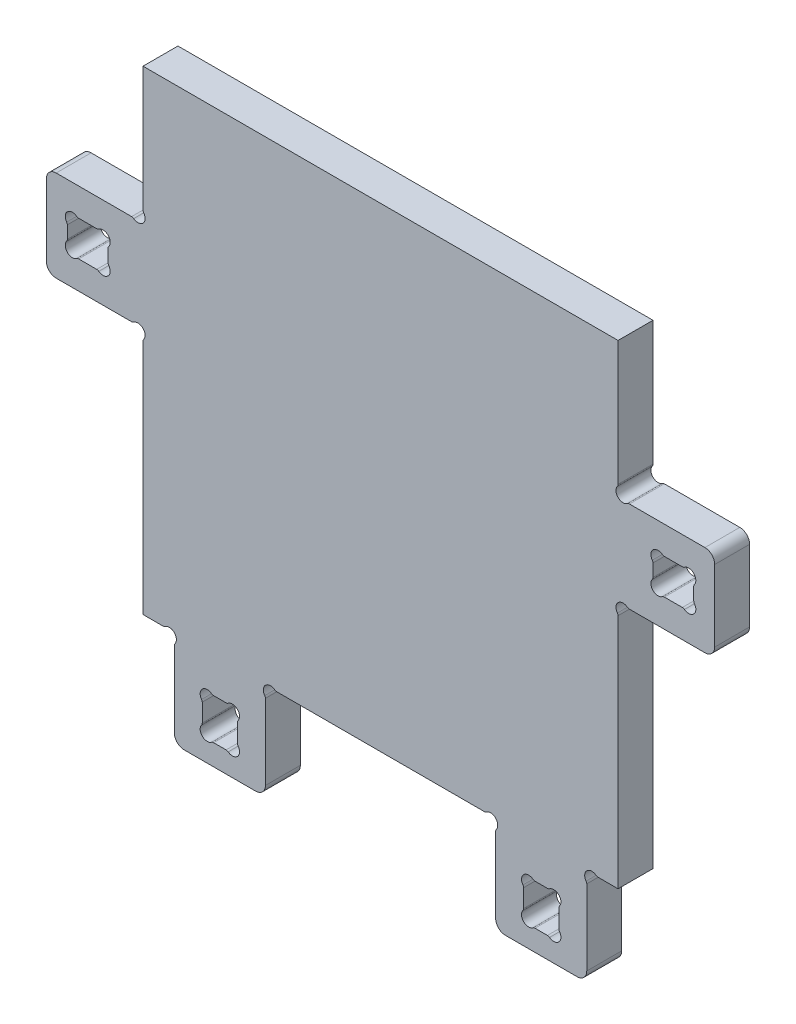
ISO-10303-21;
HEADER;
FILE_DESCRIPTION(('STEP AP214'),'2;1');
FILE_NAME('part.step','',(''),(''),'','','');
FILE_SCHEMA(('AUTOMOTIVE_DESIGN { 1 0 10303 214 1 1 1 1 }'));
ENDSEC;
DATA;
#1=APPLICATION_CONTEXT('core data for automotive mechanical design processes');
#2=APPLICATION_PROTOCOL_DEFINITION('international standard','automotive_design',2000,#1);
#3=PRODUCT_CONTEXT('',#1,'mechanical');
#4=PRODUCT('Part','Part','',(#3));
#5=PRODUCT_RELATED_PRODUCT_CATEGORY('part','',(#4));
#6=PRODUCT_DEFINITION_FORMATION('','',#4);
#7=PRODUCT_DEFINITION_CONTEXT('part definition',#1,'design');
#8=PRODUCT_DEFINITION('design','',#6,#7);
#9=PRODUCT_DEFINITION_SHAPE('','',#8);
#10=(LENGTH_UNIT() NAMED_UNIT(*) SI_UNIT(.MILLI.,.METRE.));
#11=(NAMED_UNIT(*) PLANE_ANGLE_UNIT() SI_UNIT($,.RADIAN.));
#12=(NAMED_UNIT(*) SI_UNIT($,.STERADIAN.) SOLID_ANGLE_UNIT());
#13=UNCERTAINTY_MEASURE_WITH_UNIT(LENGTH_MEASURE(1.E-05),#10,'distance_accuracy_value','');
#14=(GEOMETRIC_REPRESENTATION_CONTEXT(3) GLOBAL_UNCERTAINTY_ASSIGNED_CONTEXT((#13)) GLOBAL_UNIT_ASSIGNED_CONTEXT((#10,
#11,#12)) REPRESENTATION_CONTEXT('',''));
#15=CARTESIAN_POINT('',(0.,0.,0.));
#16=DIRECTION('',(0.,0.,1.));
#17=DIRECTION('',(1.,0.,0.));
#18=AXIS2_PLACEMENT_3D('',#15,#16,#17);
#19=CARTESIAN_POINT('',(2.5,61.0356262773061,25.));
#20=DIRECTION('',(0.,0.,-1.));
#21=DIRECTION('',(-1.,0.,0.));
#22=AXIS2_PLACEMENT_3D('',#19,#20,#21);
#23=PLANE('',#22);
#24=CARTESIAN_POINT('',(17.5,23.1310403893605,25.));
#25=DIRECTION('',(0.,0.,-1.));
#26=DIRECTION('',(1.,0.,0.));
#27=AXIS2_PLACEMENT_3D('',#24,#25,#26);
#28=CIRCLE('',#27,2.5);
#29=CARTESIAN_POINT('',(20.,23.1310403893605,25.));
#30=VERTEX_POINT('',#29);
#31=CARTESIAN_POINT('',(19.508633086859,21.6426207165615,25.));
#32=VERTEX_POINT('',#31);
#33=EDGE_CURVE('E1333',#30,#32,#28,.T.);
#34=ORIENTED_EDGE('',*,*,#33,.F.);
#35=DIRECTION('',(0.,-1.,0.));
#36=VECTOR('',#35,1.);
#37=CARTESIAN_POINT('',(20.,36.0356262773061,25.));
#38=LINE('',#37,#36);
#39=CARTESIAN_POINT('',(20.,36.0356262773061,25.));
#40=VERTEX_POINT('',#39);
#41=EDGE_CURVE('E1365',#40,#30,#38,.T.);
#42=ORIENTED_EDGE('',*,*,#41,.F.);
#43=CARTESIAN_POINT('',(17.5,36.0356262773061,25.));
#44=DIRECTION('',(0.,0.,-1.));
#45=DIRECTION('',(-1.,0.,0.));
#46=AXIS2_PLACEMENT_3D('',#43,#44,#45);
#47=CIRCLE('',#46,2.5);
#48=CARTESIAN_POINT('',(19.508633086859,37.5240459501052,25.));
#49=VERTEX_POINT('',#48);
#50=EDGE_CURVE('E1362',#49,#40,#47,.T.);
#51=ORIENTED_EDGE('',*,*,#50,.F.);
#52=CARTESIAN_POINT('',(23.6062445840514,40.5604220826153,25.));
#53=DIRECTION('',(0.,0.,1.));
#54=DIRECTION('',(-1.,0.,0.));
#55=AXIS2_PLACEMENT_3D('',#52,#53,#54);
#56=CIRCLE('',#55,5.1);
#57=CARTESIAN_POINT('',(26.6426207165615,44.6580335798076,25.));
#58=VERTEX_POINT('',#57);
#59=EDGE_CURVE('E1360',#58,#49,#56,.T.);
#60=ORIENTED_EDGE('',*,*,#59,.F.);
#61=CARTESIAN_POINT('',(28.1310403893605,46.6666666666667,25.));
#62=DIRECTION('',(0.,0.,-1.));
#63=DIRECTION('',(1.,0.,0.));
#64=AXIS2_PLACEMENT_3D('',#61,#62,#63);
#65=CIRCLE('',#64,2.5);
#66=CARTESIAN_POINT('',(28.1310403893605,44.1666666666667,25.));
#67=VERTEX_POINT('',#66);
#68=EDGE_CURVE('E1358',#67,#58,#65,.T.);
#69=ORIENTED_EDGE('',*,*,#68,.F.);
#70=DIRECTION('',(-1.,0.,0.));
#71=VECTOR('',#70,1.);
#72=CARTESIAN_POINT('',(28.1310403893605,44.1666666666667,25.));
#73=LINE('',#72,#71);
#74=CARTESIAN_POINT('',(37.0689596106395,44.1666666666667,25.));
#75=VERTEX_POINT('',#74);
#76=EDGE_CURVE('E1356',#75,#67,#73,.T.);
#77=ORIENTED_EDGE('',*,*,#76,.F.);
#78=CARTESIAN_POINT('',(37.0689596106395,46.6666666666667,25.));
#79=DIRECTION('',(0.,0.,-1.));
#80=DIRECTION('',(-1.,0.,0.));
#81=AXIS2_PLACEMENT_3D('',#78,#79,#80);
#82=CIRCLE('',#81,2.5);
#83=CARTESIAN_POINT('',(38.5573792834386,44.6580335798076,25.));
#84=VERTEX_POINT('',#83);
#85=EDGE_CURVE('E1354',#84,#75,#82,.T.);
#86=ORIENTED_EDGE('',*,*,#85,.F.);
#87=CARTESIAN_POINT('',(41.5937554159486,40.5604220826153,25.));
#88=DIRECTION('',(0.,0.,1.));
#89=DIRECTION('',(1.,0.,0.));
#90=AXIS2_PLACEMENT_3D('',#87,#88,#89);
#91=CIRCLE('',#90,5.1);
#92=CARTESIAN_POINT('',(45.691366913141,37.5240459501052,25.));
#93=VERTEX_POINT('',#92);
#94=EDGE_CURVE('E1352',#93,#84,#91,.T.);
#95=ORIENTED_EDGE('',*,*,#94,.F.);
#96=CARTESIAN_POINT('',(47.7,36.0356262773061,25.));
#97=DIRECTION('',(0.,0.,-1.));
#98=DIRECTION('',(1.,0.,0.));
#99=AXIS2_PLACEMENT_3D('',#96,#97,#98);
#100=CIRCLE('',#99,2.5);
#101=CARTESIAN_POINT('',(45.2,36.0356262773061,25.));
#102=VERTEX_POINT('',#101);
#103=EDGE_CURVE('E1350',#102,#93,#100,.T.);
#104=ORIENTED_EDGE('',*,*,#103,.F.);
#105=DIRECTION('',(0.,1.,0.));
#106=VECTOR('',#105,1.);
#107=CARTESIAN_POINT('',(45.2,36.0356262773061,25.));
#108=LINE('',#107,#106);
#109=CARTESIAN_POINT('',(45.2,23.1310403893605,25.));
#110=VERTEX_POINT('',#109);
#111=EDGE_CURVE('E1348',#110,#102,#108,.T.);
#112=ORIENTED_EDGE('',*,*,#111,.F.);
#113=CARTESIAN_POINT('',(47.7,23.1310403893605,25.));
#114=DIRECTION('',(0.,0.,-1.));
#115=DIRECTION('',(-1.,0.,0.));
#116=AXIS2_PLACEMENT_3D('',#113,#114,#115);
#117=CIRCLE('',#116,2.5);
#118=CARTESIAN_POINT('',(45.691366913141,21.6426207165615,25.));
#119=VERTEX_POINT('',#118);
#120=EDGE_CURVE('E1346',#119,#110,#117,.T.);
#121=ORIENTED_EDGE('',*,*,#120,.F.);
#122=CARTESIAN_POINT('',(41.5937554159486,18.6062445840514,25.));
#123=DIRECTION('',(0.,0.,1.));
#124=DIRECTION('',(-1.,0.,0.));
#125=AXIS2_PLACEMENT_3D('',#122,#123,#124);
#126=CIRCLE('',#125,5.1);
#127=CARTESIAN_POINT('',(38.5573792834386,14.508633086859,25.));
#128=VERTEX_POINT('',#127);
#129=EDGE_CURVE('E1344',#128,#119,#126,.T.);
#130=ORIENTED_EDGE('',*,*,#129,.F.);
#131=CARTESIAN_POINT('',(37.0689596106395,12.5,25.));
#132=DIRECTION('',(0.,0.,-1.));
#133=DIRECTION('',(1.,0.,0.));
#134=AXIS2_PLACEMENT_3D('',#131,#132,#133);
#135=CIRCLE('',#134,2.5);
#136=CARTESIAN_POINT('',(37.0689596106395,15.,25.));
#137=VERTEX_POINT('',#136);
#138=EDGE_CURVE('E1342',#137,#128,#135,.T.);
#139=ORIENTED_EDGE('',*,*,#138,.F.);
#140=DIRECTION('',(1.,0.,0.));
#141=VECTOR('',#140,1.);
#142=CARTESIAN_POINT('',(28.1310403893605,15.,25.));
#143=LINE('',#142,#141);
#144=CARTESIAN_POINT('',(28.1310403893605,15.,25.));
#145=VERTEX_POINT('',#144);
#146=EDGE_CURVE('E1340',#145,#137,#143,.T.);
#147=ORIENTED_EDGE('',*,*,#146,.F.);
#148=CARTESIAN_POINT('',(28.1310403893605,12.5,25.));
#149=DIRECTION('',(0.,0.,-1.));
#150=DIRECTION('',(-1.,0.,0.));
#151=AXIS2_PLACEMENT_3D('',#148,#149,#150);
#152=CIRCLE('',#151,2.5);
#153=CARTESIAN_POINT('',(26.6426207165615,14.508633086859,25.));
#154=VERTEX_POINT('',#153);
#155=EDGE_CURVE('E1338',#154,#145,#152,.T.);
#156=ORIENTED_EDGE('',*,*,#155,.F.);
#157=CARTESIAN_POINT('',(23.6062445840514,18.6062445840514,25.));
#158=DIRECTION('',(0.,0.,1.));
#159=DIRECTION('',(1.,0.,0.));
#160=AXIS2_PLACEMENT_3D('',#157,#158,#159);
#161=CIRCLE('',#160,5.1);
#162=EDGE_CURVE('E1335',#32,#154,#161,.T.);
#163=ORIENTED_EDGE('',*,*,#162,.F.);
#164=EDGE_LOOP('',(#34,#42,#51,#60,#69,#77,#86,#95,#104,#112,#121,#130,#139,#147,#156,#163));
#165=FACE_BOUND('',#164,.T.);
#166=DIRECTION('',(0.,-1.,0.));
#167=VECTOR('',#166,1.);
#168=CARTESIAN_POINT('',(-91.5666666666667,311.766666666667,25.));
#169=LINE('',#168,#167);
#170=CARTESIAN_POINT('',(-91.5666666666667,304.766666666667,25.));
#171=VERTEX_POINT('',#170);
#172=CARTESIAN_POINT('',(-91.5666666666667,253.566666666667,25.));
#173=VERTEX_POINT('',#172);
#174=EDGE_CURVE('E1476',#171,#173,#169,.T.);
#175=ORIENTED_EDGE('',*,*,#174,.T.);
#176=CARTESIAN_POINT('',(-84.5666666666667,253.566666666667,25.));
#177=DIRECTION('',(0.,0.,-1.));
#178=DIRECTION('',(-1.,0.,0.));
#179=AXIS2_PLACEMENT_3D('',#176,#177,#178);
#180=CIRCLE('',#179,7.);
#181=CARTESIAN_POINT('',(-84.5666666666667,246.566666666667,25.));
#182=VERTEX_POINT('',#181);
#183=EDGE_CURVE('E1619',#173,#182,#180,.F.);
#184=ORIENTED_EDGE('',*,*,#183,.T.);
#185=DIRECTION('',(1.,0.,0.));
#186=VECTOR('',#185,1.);
#187=CARTESIAN_POINT('',(-91.5666666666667,246.566666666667,25.));
#188=LINE('',#187,#186);
#189=CARTESIAN_POINT('',(-30.5310403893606,246.566666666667,25.));
#190=VERTEX_POINT('',#189);
#191=EDGE_CURVE('E1479',#182,#190,#188,.T.);
#192=ORIENTED_EDGE('',*,*,#191,.T.);
#193=CARTESIAN_POINT('',(-30.5310403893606,249.066666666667,25.));
#194=DIRECTION('',(0.,0.,1.));
#195=DIRECTION('',(-1.,0.,0.));
#196=AXIS2_PLACEMENT_3D('',#193,#194,#195);
#197=CIRCLE('',#196,2.49999999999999);
#198=CARTESIAN_POINT('',(-29.0426207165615,247.058033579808,25.));
#199=VERTEX_POINT('',#198);
#200=EDGE_CURVE('E1481',#190,#199,#197,.T.);
#201=ORIENTED_EDGE('',*,*,#200,.T.);
#202=CARTESIAN_POINT('',(-26.0062445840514,242.960422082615,25.));
#203=DIRECTION('',(0.,0.,-1.));
#204=DIRECTION('',(1.,0.,0.));
#205=AXIS2_PLACEMENT_3D('',#202,#203,#204);
#206=CIRCLE('',#205,5.10000000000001);
#207=CARTESIAN_POINT('',(-21.9086330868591,239.924045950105,25.));
#208=VERTEX_POINT('',#207);
#209=EDGE_CURVE('E1483',#199,#208,#206,.T.);
#210=ORIENTED_EDGE('',*,*,#209,.T.);
#211=CARTESIAN_POINT('',(-19.9,238.435626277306,25.));
#212=DIRECTION('',(0.,0.,1.));
#213=DIRECTION('',(1.,0.,0.));
#214=AXIS2_PLACEMENT_3D('',#211,#212,#213);
#215=CIRCLE('',#214,2.49999999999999);
#216=CARTESIAN_POINT('',(-22.4,238.435626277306,25.));
#217=VERTEX_POINT('',#216);
#218=EDGE_CURVE('E1485',#208,#217,#215,.T.);
#219=ORIENTED_EDGE('',*,*,#218,.T.);
#220=DIRECTION('',(0.,-1.,0.));
#221=VECTOR('',#220,1.);
#222=CARTESIAN_POINT('',(-22.4,238.435626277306,25.));
#223=LINE('',#222,#221);
#224=CARTESIAN_POINT('',(-22.4,69.1666666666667,25.));
#225=VERTEX_POINT('',#224);
#226=EDGE_CURVE('E1487',#217,#225,#223,.T.);
#227=ORIENTED_EDGE('',*,*,#226,.T.);
#228=DIRECTION('',(1.,0.,0.));
#229=VECTOR('',#228,1.);
#230=CARTESIAN_POINT('',(-8.13104038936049,69.1666666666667,25.));
#231=LINE('',#230,#229);
#232=CARTESIAN_POINT('',(-8.13104038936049,69.1666666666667,25.));
#233=VERTEX_POINT('',#232);
#234=EDGE_CURVE('E1489',#225,#233,#231,.T.);
#235=ORIENTED_EDGE('',*,*,#234,.T.);
#236=CARTESIAN_POINT('',(-8.13104038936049,71.6666666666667,25.));
#237=DIRECTION('',(0.,0.,1.));
#238=DIRECTION('',(-1.,0.,0.));
#239=AXIS2_PLACEMENT_3D('',#236,#237,#238);
#240=CIRCLE('',#239,2.5);
#241=CARTESIAN_POINT('',(-6.64262071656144,69.6580335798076,25.));
#242=VERTEX_POINT('',#241);
#243=EDGE_CURVE('E1491',#233,#242,#240,.T.);
#244=ORIENTED_EDGE('',*,*,#243,.T.);
#245=CARTESIAN_POINT('',(-3.60624458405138,65.5604220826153,25.));
#246=DIRECTION('',(0.,0.,-1.));
#247=DIRECTION('',(1.,0.,0.));
#248=AXIS2_PLACEMENT_3D('',#245,#246,#247);
#249=CIRCLE('',#248,5.1);
#250=CARTESIAN_POINT('',(0.491366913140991,62.5240459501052,25.));
#251=VERTEX_POINT('',#250);
#252=EDGE_CURVE('E1493',#242,#251,#249,.T.);
#253=ORIENTED_EDGE('',*,*,#252,.T.);
#254=CARTESIAN_POINT('',(2.5,61.0356262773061,25.));
#255=DIRECTION('',(0.,0.,1.));
#256=DIRECTION('',(-1.,0.,0.));
#257=AXIS2_PLACEMENT_3D('',#254,#255,#256);
#258=CIRCLE('',#257,2.5);
#259=CARTESIAN_POINT('',(0.,61.0356262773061,25.));
#260=VERTEX_POINT('',#259);
#261=EDGE_CURVE('E1495',#251,#260,#258,.T.);
#262=ORIENTED_EDGE('',*,*,#261,.T.);
#263=DIRECTION('',(0.,-1.,0.));
#264=VECTOR('',#263,1.);
#265=CARTESIAN_POINT('',(0.,0.,25.));
#266=LINE('',#265,#264);
#267=CARTESIAN_POINT('',(0.,7.,25.));
#268=VERTEX_POINT('',#267);
#269=EDGE_CURVE('E1448',#260,#268,#266,.T.);
#270=ORIENTED_EDGE('',*,*,#269,.T.);
#271=CARTESIAN_POINT('',(7.,7.,25.));
#272=DIRECTION('',(0.,0.,-1.));
#273=DIRECTION('',(-1.,0.,0.));
#274=AXIS2_PLACEMENT_3D('',#271,#272,#273);
#275=CIRCLE('',#274,7.);
#276=CARTESIAN_POINT('',(7.,0.,25.));
#277=VERTEX_POINT('',#276);
#278=EDGE_CURVE('E1614',#268,#277,#275,.F.);
#279=ORIENTED_EDGE('',*,*,#278,.T.);
#280=DIRECTION('',(1.,0.,0.));
#281=VECTOR('',#280,1.);
#282=CARTESIAN_POINT('',(0.,0.,25.));
#283=LINE('',#282,#281);
#284=CARTESIAN_POINT('',(58.2,0.,25.));
#285=VERTEX_POINT('',#284);
#286=EDGE_CURVE('E1451',#277,#285,#283,.T.);
#287=ORIENTED_EDGE('',*,*,#286,.T.);
#288=CARTESIAN_POINT('',(58.2,7.00000000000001,25.));
#289=DIRECTION('',(0.,0.,-1.));
#290=DIRECTION('',(-1.,0.,0.));
#291=AXIS2_PLACEMENT_3D('',#288,#289,#290);
#292=CIRCLE('',#291,7.);
#293=CARTESIAN_POINT('',(65.2,7.00000000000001,25.));
#294=VERTEX_POINT('',#293);
#295=EDGE_CURVE('E56',#285,#294,#292,.F.);
#296=ORIENTED_EDGE('',*,*,#295,.T.);
#297=DIRECTION('',(0.,1.,0.));
#298=VECTOR('',#297,1.);
#299=CARTESIAN_POINT('',(65.2,0.,25.));
#300=LINE('',#299,#298);
#301=CARTESIAN_POINT('',(65.2,61.0356262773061,25.));
#302=VERTEX_POINT('',#301);
#303=EDGE_CURVE('E1454',#294,#302,#300,.T.);
#304=ORIENTED_EDGE('',*,*,#303,.T.);
#305=CARTESIAN_POINT('',(62.7,61.0356262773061,25.));
#306=DIRECTION('',(0.,0.,1.));
#307=DIRECTION('',(-1.,0.,0.));
#308=AXIS2_PLACEMENT_3D('',#305,#306,#307);
#309=CIRCLE('',#308,2.49999999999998);
#310=CARTESIAN_POINT('',(64.708633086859,62.5240459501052,25.));
#311=VERTEX_POINT('',#310);
#312=EDGE_CURVE('E1456',#302,#311,#309,.T.);
#313=ORIENTED_EDGE('',*,*,#312,.T.);
#314=CARTESIAN_POINT('',(68.8062445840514,65.5604220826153,25.));
#315=DIRECTION('',(0.,0.,-1.));
#316=DIRECTION('',(1.,0.,0.));
#317=AXIS2_PLACEMENT_3D('',#314,#315,#316);
#318=CIRCLE('',#317,5.10000000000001);
#319=CARTESIAN_POINT('',(71.8426207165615,69.6580335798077,25.));
#320=VERTEX_POINT('',#319);
#321=EDGE_CURVE('E1458',#311,#320,#318,.T.);
#322=ORIENTED_EDGE('',*,*,#321,.T.);
#323=CARTESIAN_POINT('',(73.3310403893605,71.6666666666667,25.));
#324=DIRECTION('',(0.,0.,1.));
#325=DIRECTION('',(1.,0.,0.));
#326=AXIS2_PLACEMENT_3D('',#323,#324,#325);
#327=CIRCLE('',#326,2.50000000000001);
#328=CARTESIAN_POINT('',(73.3310403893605,69.1666666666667,25.));
#329=VERTEX_POINT('',#328);
#330=EDGE_CURVE('E1460',#320,#329,#327,.T.);
#331=ORIENTED_EDGE('',*,*,#330,.T.);
#332=DIRECTION('',(1.,0.,0.));
#333=VECTOR('',#332,1.);
#334=CARTESIAN_POINT('',(73.3310403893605,69.1666666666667,25.));
#335=LINE('',#334,#333);
#336=CARTESIAN_POINT('',(221.868959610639,69.1666666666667,25.));
#337=VERTEX_POINT('',#336);
#338=EDGE_CURVE('E1462',#329,#337,#335,.T.);
#339=ORIENTED_EDGE('',*,*,#338,.T.);
#340=CARTESIAN_POINT('',(221.868959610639,71.6666666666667,25.));
#341=DIRECTION('',(0.,0.,-1.));
#342=DIRECTION('',(-1.,0.,0.));
#343=AXIS2_PLACEMENT_3D('',#340,#341,#342);
#344=CIRCLE('',#343,2.50000000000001);
#345=CARTESIAN_POINT('',(223.357379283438,69.6580335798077,25.));
#346=VERTEX_POINT('',#345);
#347=EDGE_CURVE('E1030',#346,#337,#344,.T.);
#348=ORIENTED_EDGE('',*,*,#347,.F.);
#349=CARTESIAN_POINT('',(226.393755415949,65.5604220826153,25.));
#350=DIRECTION('',(0.,0.,1.));
#351=DIRECTION('',(-1.,0.,0.));
#352=AXIS2_PLACEMENT_3D('',#349,#350,#351);
#353=CIRCLE('',#352,5.10000000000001);
#354=CARTESIAN_POINT('',(230.491366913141,62.5240459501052,25.));
#355=VERTEX_POINT('',#354);
#356=EDGE_CURVE('E1027',#355,#346,#353,.T.);
#357=ORIENTED_EDGE('',*,*,#356,.F.);
#358=CARTESIAN_POINT('',(232.5,61.0356262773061,25.));
#359=DIRECTION('',(0.,0.,-1.));
#360=DIRECTION('',(1.,0.,0.));
#361=AXIS2_PLACEMENT_3D('',#358,#359,#360);
#362=CIRCLE('',#361,2.49999999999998);
#363=CARTESIAN_POINT('',(230.,61.0356262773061,25.));
#364=VERTEX_POINT('',#363);
#365=EDGE_CURVE('E1024',#364,#355,#362,.T.);
#366=ORIENTED_EDGE('',*,*,#365,.F.);
#367=DIRECTION('',(0.,1.,0.));
#368=VECTOR('',#367,1.);
#369=CARTESIAN_POINT('',(230.,0.,25.));
#370=LINE('',#369,#368);
#371=CARTESIAN_POINT('',(230.,7.00000000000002,25.));
#372=VERTEX_POINT('',#371);
#373=EDGE_CURVE('E1021',#372,#364,#370,.T.);
#374=ORIENTED_EDGE('',*,*,#373,.F.);
#375=CARTESIAN_POINT('',(237.,7.00000000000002,25.));
#376=DIRECTION('',(0.,0.,1.));
#377=DIRECTION('',(1.,0.,0.));
#378=AXIS2_PLACEMENT_3D('',#375,#376,#377);
#379=CIRCLE('',#378,7.);
#380=CARTESIAN_POINT('',(237.,0.,25.));
#381=VERTEX_POINT('',#380);
#382=EDGE_CURVE('E1198',#381,#372,#379,.F.);
#383=ORIENTED_EDGE('',*,*,#382,.F.);
#384=DIRECTION('',(-1.,0.,0.));
#385=VECTOR('',#384,1.);
#386=CARTESIAN_POINT('',(295.2,0.,25.));
#387=LINE('',#386,#385);
#388=CARTESIAN_POINT('',(288.2,0.,25.));
#389=VERTEX_POINT('',#388);
#390=EDGE_CURVE('E1017',#389,#381,#387,.T.);
#391=ORIENTED_EDGE('',*,*,#390,.F.);
#392=CARTESIAN_POINT('',(288.2,7.00000000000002,25.));
#393=DIRECTION('',(0.,0.,1.));
#394=DIRECTION('',(1.,0.,0.));
#395=AXIS2_PLACEMENT_3D('',#392,#393,#394);
#396=CIRCLE('',#395,7.);
#397=CARTESIAN_POINT('',(295.2,7.00000000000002,25.));
#398=VERTEX_POINT('',#397);
#399=EDGE_CURVE('E1195',#398,#389,#396,.F.);
#400=ORIENTED_EDGE('',*,*,#399,.F.);
#401=DIRECTION('',(0.,-1.,0.));
#402=VECTOR('',#401,1.);
#403=CARTESIAN_POINT('',(295.2,0.,25.));
#404=LINE('',#403,#402);
#405=CARTESIAN_POINT('',(295.2,61.0356262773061,25.));
#406=VERTEX_POINT('',#405);
#407=EDGE_CURVE('E1014',#406,#398,#404,.T.);
#408=ORIENTED_EDGE('',*,*,#407,.F.);
#409=CARTESIAN_POINT('',(292.7,61.0356262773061,25.));
#410=DIRECTION('',(0.,0.,-1.));
#411=DIRECTION('',(1.,0.,0.));
#412=AXIS2_PLACEMENT_3D('',#409,#410,#411);
#413=CIRCLE('',#412,2.5);
#414=CARTESIAN_POINT('',(294.708633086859,62.5240459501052,25.));
#415=VERTEX_POINT('',#414);
#416=EDGE_CURVE('E1075',#415,#406,#413,.T.);
#417=ORIENTED_EDGE('',*,*,#416,.F.);
#418=CARTESIAN_POINT('',(298.806244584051,65.5604220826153,25.));
#419=DIRECTION('',(0.,0.,1.));
#420=DIRECTION('',(-1.,0.,0.));
#421=AXIS2_PLACEMENT_3D('',#418,#419,#420);
#422=CIRCLE('',#421,5.1);
#423=CARTESIAN_POINT('',(301.842620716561,69.6580335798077,25.));
#424=VERTEX_POINT('',#423);
#425=EDGE_CURVE('E1072',#424,#415,#422,.T.);
#426=ORIENTED_EDGE('',*,*,#425,.F.);
#427=CARTESIAN_POINT('',(303.33104038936,71.6666666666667,25.));
#428=DIRECTION('',(0.,0.,-1.));
#429=DIRECTION('',(1.,0.,0.));
#430=AXIS2_PLACEMENT_3D('',#427,#428,#429);
#431=CIRCLE('',#430,2.5);
#432=CARTESIAN_POINT('',(303.33104038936,69.1666666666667,25.));
#433=VERTEX_POINT('',#432);
#434=EDGE_CURVE('E1069',#433,#424,#431,.T.);
#435=ORIENTED_EDGE('',*,*,#434,.F.);
#436=DIRECTION('',(-1.,0.,0.));
#437=VECTOR('',#436,1.);
#438=CARTESIAN_POINT('',(303.33104038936,69.1666666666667,25.));
#439=LINE('',#438,#437);
#440=CARTESIAN_POINT('',(317.6,69.1666666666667,25.));
#441=VERTEX_POINT('',#440);
#442=EDGE_CURVE('E1066',#441,#433,#439,.T.);
#443=ORIENTED_EDGE('',*,*,#442,.F.);
#444=DIRECTION('',(0.,-1.,0.));
#445=VECTOR('',#444,1.);
#446=CARTESIAN_POINT('',(317.6,238.435626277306,25.));
#447=LINE('',#446,#445);
#448=CARTESIAN_POINT('',(317.6,238.435626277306,25.));
#449=VERTEX_POINT('',#448);
#450=EDGE_CURVE('E1063',#449,#441,#447,.T.);
#451=ORIENTED_EDGE('',*,*,#450,.F.);
#452=CARTESIAN_POINT('',(315.1,238.435626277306,25.));
#453=DIRECTION('',(0.,0.,-1.));
#454=DIRECTION('',(-1.,0.,0.));
#455=AXIS2_PLACEMENT_3D('',#452,#453,#454);
#456=CIRCLE('',#455,2.49999999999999);
#457=CARTESIAN_POINT('',(317.108633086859,239.924045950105,25.));
#458=VERTEX_POINT('',#457);
#459=EDGE_CURVE('E1060',#458,#449,#456,.T.);
#460=ORIENTED_EDGE('',*,*,#459,.F.);
#461=CARTESIAN_POINT('',(321.206244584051,242.960422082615,25.));
#462=DIRECTION('',(0.,0.,1.));
#463=DIRECTION('',(-1.,0.,0.));
#464=AXIS2_PLACEMENT_3D('',#461,#462,#463);
#465=CIRCLE('',#464,5.10000000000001);
#466=CARTESIAN_POINT('',(324.242620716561,247.058033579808,25.));
#467=VERTEX_POINT('',#466);
#468=EDGE_CURVE('E1057',#467,#458,#465,.T.);
#469=ORIENTED_EDGE('',*,*,#468,.F.);
#470=CARTESIAN_POINT('',(325.73104038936,249.066666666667,25.));
#471=DIRECTION('',(0.,0.,-1.));
#472=DIRECTION('',(1.,0.,0.));
#473=AXIS2_PLACEMENT_3D('',#470,#471,#472);
#474=CIRCLE('',#473,2.49999999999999);
#475=CARTESIAN_POINT('',(325.73104038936,246.566666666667,25.));
#476=VERTEX_POINT('',#475);
#477=EDGE_CURVE('E1054',#476,#467,#474,.T.);
#478=ORIENTED_EDGE('',*,*,#477,.F.);
#479=DIRECTION('',(-1.,0.,0.));
#480=VECTOR('',#479,1.);
#481=CARTESIAN_POINT('',(386.766666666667,246.566666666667,25.));
#482=LINE('',#481,#480);
#483=CARTESIAN_POINT('',(379.766666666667,246.566666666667,25.));
#484=VERTEX_POINT('',#483);
#485=EDGE_CURVE('E1051',#484,#476,#482,.T.);
#486=ORIENTED_EDGE('',*,*,#485,.F.);
#487=CARTESIAN_POINT('',(379.766666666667,253.566666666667,25.));
#488=DIRECTION('',(0.,0.,1.));
#489=DIRECTION('',(1.,0.,0.));
#490=AXIS2_PLACEMENT_3D('',#487,#488,#489);
#491=CIRCLE('',#490,7.);
#492=CARTESIAN_POINT('',(386.766666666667,253.566666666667,25.));
#493=VERTEX_POINT('',#492);
#494=EDGE_CURVE('E1204',#493,#484,#491,.F.);
#495=ORIENTED_EDGE('',*,*,#494,.F.);
#496=DIRECTION('',(0.,-1.,0.));
#497=VECTOR('',#496,1.);
#498=CARTESIAN_POINT('',(386.766666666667,311.766666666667,25.));
#499=LINE('',#498,#497);
#500=CARTESIAN_POINT('',(386.766666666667,304.766666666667,25.));
#501=VERTEX_POINT('',#500);
#502=EDGE_CURVE('E1048',#501,#493,#499,.T.);
#503=ORIENTED_EDGE('',*,*,#502,.F.);
#504=CARTESIAN_POINT('',(379.766666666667,304.766666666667,25.));
#505=DIRECTION('',(0.,0.,1.));
#506=DIRECTION('',(1.,0.,0.));
#507=AXIS2_PLACEMENT_3D('',#504,#505,#506);
#508=CIRCLE('',#507,7.);
#509=CARTESIAN_POINT('',(379.766666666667,311.766666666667,25.));
#510=VERTEX_POINT('',#509);
#511=EDGE_CURVE('E1201',#510,#501,#508,.F.);
#512=ORIENTED_EDGE('',*,*,#511,.F.);
#513=DIRECTION('',(1.,0.,0.));
#514=VECTOR('',#513,1.);
#515=CARTESIAN_POINT('',(386.766666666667,311.766666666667,25.));
#516=LINE('',#515,#514);
#517=CARTESIAN_POINT('',(325.73104038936,311.766666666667,25.));
#518=VERTEX_POINT('',#517);
#519=EDGE_CURVE('E1045',#518,#510,#516,.T.);
#520=ORIENTED_EDGE('',*,*,#519,.F.);
#521=CARTESIAN_POINT('',(325.73104038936,309.266666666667,25.));
#522=DIRECTION('',(0.,0.,-1.));
#523=DIRECTION('',(1.,0.,0.));
#524=AXIS2_PLACEMENT_3D('',#521,#522,#523);
#525=CIRCLE('',#524,2.5);
#526=CARTESIAN_POINT('',(324.242620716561,311.275299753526,25.));
#527=VERTEX_POINT('',#526);
#528=EDGE_CURVE('E1042',#527,#518,#525,.T.);
#529=ORIENTED_EDGE('',*,*,#528,.F.);
#530=CARTESIAN_POINT('',(321.206244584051,315.372911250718,25.));
#531=DIRECTION('',(0.,0.,1.));
#532=DIRECTION('',(-1.,0.,0.));
#533=AXIS2_PLACEMENT_3D('',#530,#531,#532);
#534=CIRCLE('',#533,5.10000000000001);
#535=CARTESIAN_POINT('',(317.108633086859,318.409287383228,25.));
#536=VERTEX_POINT('',#535);
#537=EDGE_CURVE('E1039',#536,#527,#534,.T.);
#538=ORIENTED_EDGE('',*,*,#537,.F.);
#539=CARTESIAN_POINT('',(315.1,319.897707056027,25.));
#540=DIRECTION('',(0.,0.,-1.));
#541=DIRECTION('',(1.,0.,0.));
#542=AXIS2_PLACEMENT_3D('',#539,#540,#541);
#543=CIRCLE('',#542,2.49999999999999);
#544=CARTESIAN_POINT('',(317.6,319.897707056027,25.));
#545=VERTEX_POINT('',#544);
#546=EDGE_CURVE('E1036',#545,#536,#543,.T.);
#547=ORIENTED_EDGE('',*,*,#546,.F.);
#548=DIRECTION('',(0.,-1.,0.));
#549=VECTOR('',#548,1.);
#550=CARTESIAN_POINT('',(317.6,319.897707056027,25.));
#551=LINE('',#550,#549);
#552=CARTESIAN_POINT('',(317.6,409.066666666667,25.));
#553=VERTEX_POINT('',#552);
#554=EDGE_CURVE('E1033',#553,#545,#551,.T.);
#555=ORIENTED_EDGE('',*,*,#554,.F.);
#556=DIRECTION('',(-1.,0.,0.));
#557=VECTOR('',#556,1.);
#558=CARTESIAN_POINT('',(-22.4000000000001,409.066666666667,25.));
#559=LINE('',#558,#557);
#560=CARTESIAN_POINT('',(-22.4000000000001,409.066666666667,25.));
#561=VERTEX_POINT('',#560);
#562=EDGE_CURVE('E1464',#553,#561,#559,.T.);
#563=ORIENTED_EDGE('',*,*,#562,.T.);
#564=DIRECTION('',(0.,-1.,0.));
#565=VECTOR('',#564,1.);
#566=CARTESIAN_POINT('',(-22.4000000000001,319.897707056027,25.));
#567=LINE('',#566,#565);
#568=CARTESIAN_POINT('',(-22.4000000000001,319.897707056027,25.));
#569=VERTEX_POINT('',#568);
#570=EDGE_CURVE('E1466',#561,#569,#567,.T.);
#571=ORIENTED_EDGE('',*,*,#570,.T.);
#572=CARTESIAN_POINT('',(-19.9,319.897707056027,25.));
#573=DIRECTION('',(0.,0.,1.));
#574=DIRECTION('',(-1.,0.,0.));
#575=AXIS2_PLACEMENT_3D('',#572,#573,#574);
#576=CIRCLE('',#575,2.49999999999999);
#577=CARTESIAN_POINT('',(-21.9086330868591,318.409287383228,25.));
#578=VERTEX_POINT('',#577);
#579=EDGE_CURVE('E1468',#569,#578,#576,.T.);
#580=ORIENTED_EDGE('',*,*,#579,.T.);
#581=CARTESIAN_POINT('',(-26.0062445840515,315.372911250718,25.));
#582=DIRECTION('',(0.,0.,-1.));
#583=DIRECTION('',(1.,0.,0.));
#584=AXIS2_PLACEMENT_3D('',#581,#582,#583);
#585=CIRCLE('',#584,5.10000000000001);
#586=CARTESIAN_POINT('',(-29.0426207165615,311.275299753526,25.));
#587=VERTEX_POINT('',#586);
#588=EDGE_CURVE('E1470',#578,#587,#585,.T.);
#589=ORIENTED_EDGE('',*,*,#588,.T.);
#590=CARTESIAN_POINT('',(-30.5310403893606,309.266666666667,25.));
#591=DIRECTION('',(0.,0.,1.));
#592=DIRECTION('',(-1.,0.,0.));
#593=AXIS2_PLACEMENT_3D('',#590,#591,#592);
#594=CIRCLE('',#593,2.5);
#595=CARTESIAN_POINT('',(-30.5310403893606,311.766666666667,25.));
#596=VERTEX_POINT('',#595);
#597=EDGE_CURVE('E1472',#587,#596,#594,.T.);
#598=ORIENTED_EDGE('',*,*,#597,.T.);
#599=DIRECTION('',(-1.,0.,0.));
#600=VECTOR('',#599,1.);
#601=CARTESIAN_POINT('',(-91.5666666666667,311.766666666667,25.));
#602=LINE('',#601,#600);
#603=CARTESIAN_POINT('',(-84.5666666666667,311.766666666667,25.));
#604=VERTEX_POINT('',#603);
#605=EDGE_CURVE('E1474',#596,#604,#602,.T.);
#606=ORIENTED_EDGE('',*,*,#605,.T.);
#607=CARTESIAN_POINT('',(-84.5666666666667,304.766666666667,25.));
#608=DIRECTION('',(0.,0.,-1.));
#609=DIRECTION('',(-1.,0.,0.));
#610=AXIS2_PLACEMENT_3D('',#607,#608,#609);
#611=CIRCLE('',#610,7.);
#612=EDGE_CURVE('E1617',#604,#171,#611,.F.);
#613=ORIENTED_EDGE('',*,*,#612,.T.);
#614=EDGE_LOOP('',(#175,#184,#192,#201,#210,#219,#227,#235,#244,#253,#262,#270,#279,#287,#296,
#304,#313,#322,#331,#339,#348,#357,#366,#374,#383,#391,#400,#408,#417,#426,#435,#443,#451,#460,
#469,#478,#486,#495,#503,#512,#520,#529,#538,#547,#555,#563,#571,#580,#589,#598,#606,#613));
#615=FACE_BOUND('',#614,.T.);
#616=CARTESIAN_POINT('',(-68.4356262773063,294.266666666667,25.));
#617=DIRECTION('',(0.,0.,-1.));
#618=DIRECTION('',(1.,0.,0.));
#619=AXIS2_PLACEMENT_3D('',#616,#617,#618);
#620=CIRCLE('',#619,2.50000000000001);
#621=CARTESIAN_POINT('',(-68.4356262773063,291.766666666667,25.));
#622=VERTEX_POINT('',#621);
#623=CARTESIAN_POINT('',(-69.9240459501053,292.258033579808,25.));
#624=VERTEX_POINT('',#623);
#625=EDGE_CURVE('E1218',#622,#624,#620,.T.);
#626=ORIENTED_EDGE('',*,*,#625,.F.);
#627=DIRECTION('',(-1.,0.,0.));
#628=VECTOR('',#627,1.);
#629=CARTESIAN_POINT('',(-55.5310403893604,291.766666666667,25.));
#630=LINE('',#629,#628);
#631=CARTESIAN_POINT('',(-55.5310403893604,291.766666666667,25.));
#632=VERTEX_POINT('',#631);
#633=EDGE_CURVE('E1250',#632,#622,#630,.T.);
#634=ORIENTED_EDGE('',*,*,#633,.F.);
#635=CARTESIAN_POINT('',(-55.5310403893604,294.266666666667,25.));
#636=DIRECTION('',(0.,0.,-1.));
#637=DIRECTION('',(-1.,0.,0.));
#638=AXIS2_PLACEMENT_3D('',#635,#636,#637);
#639=CIRCLE('',#638,2.50000000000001);
#640=CARTESIAN_POINT('',(-54.0426207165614,292.258033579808,25.));
#641=VERTEX_POINT('',#640);
#642=EDGE_CURVE('E1247',#641,#632,#639,.T.);
#643=ORIENTED_EDGE('',*,*,#642,.F.);
#644=CARTESIAN_POINT('',(-51.0062445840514,288.160422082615,25.));
#645=DIRECTION('',(0.,0.,1.));
#646=DIRECTION('',(-1.,0.,0.));
#647=AXIS2_PLACEMENT_3D('',#644,#645,#646);
#648=CIRCLE('',#647,5.1);
#649=CARTESIAN_POINT('',(-46.908633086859,285.124045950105,25.));
#650=VERTEX_POINT('',#649);
#651=EDGE_CURVE('E1245',#650,#641,#648,.T.);
#652=ORIENTED_EDGE('',*,*,#651,.F.);
#653=CARTESIAN_POINT('',(-44.9,283.635626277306,25.));
#654=DIRECTION('',(0.,0.,-1.));
#655=DIRECTION('',(1.,0.,0.));
#656=AXIS2_PLACEMENT_3D('',#653,#654,#655);
#657=CIRCLE('',#656,2.50000000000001);
#658=CARTESIAN_POINT('',(-47.4000000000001,283.635626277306,25.));
#659=VERTEX_POINT('',#658);
#660=EDGE_CURVE('E1243',#659,#650,#657,.T.);
#661=ORIENTED_EDGE('',*,*,#660,.F.);
#662=DIRECTION('',(0.,1.,0.));
#663=VECTOR('',#662,1.);
#664=CARTESIAN_POINT('',(-47.4000000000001,283.635626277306,25.));
#665=LINE('',#664,#663);
#666=CARTESIAN_POINT('',(-47.4,274.697707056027,25.));
#667=VERTEX_POINT('',#666);
#668=EDGE_CURVE('E1241',#667,#659,#665,.T.);
#669=ORIENTED_EDGE('',*,*,#668,.F.);
#670=CARTESIAN_POINT('',(-44.9,274.697707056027,25.));
#671=DIRECTION('',(0.,0.,-1.));
#672=DIRECTION('',(-1.,0.,0.));
#673=AXIS2_PLACEMENT_3D('',#670,#671,#672);
#674=CIRCLE('',#673,2.50000000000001);
#675=CARTESIAN_POINT('',(-46.908633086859,273.209287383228,25.));
#676=VERTEX_POINT('',#675);
#677=EDGE_CURVE('E1239',#676,#667,#674,.T.);
#678=ORIENTED_EDGE('',*,*,#677,.F.);
#679=CARTESIAN_POINT('',(-51.0062445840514,270.172911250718,25.));
#680=DIRECTION('',(0.,0.,1.));
#681=DIRECTION('',(1.,0.,0.));
#682=AXIS2_PLACEMENT_3D('',#679,#680,#681);
#683=CIRCLE('',#682,5.1);
#684=CARTESIAN_POINT('',(-54.0426207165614,266.075299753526,25.));
#685=VERTEX_POINT('',#684);
#686=EDGE_CURVE('E1237',#685,#676,#683,.T.);
#687=ORIENTED_EDGE('',*,*,#686,.F.);
#688=CARTESIAN_POINT('',(-55.5310403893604,264.066666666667,25.));
#689=DIRECTION('',(0.,0.,-1.));
#690=DIRECTION('',(1.,0.,0.));
#691=AXIS2_PLACEMENT_3D('',#688,#689,#690);
#692=CIRCLE('',#691,2.50000000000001);
#693=CARTESIAN_POINT('',(-55.5310403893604,266.566666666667,25.));
#694=VERTEX_POINT('',#693);
#695=EDGE_CURVE('E1235',#694,#685,#692,.T.);
#696=ORIENTED_EDGE('',*,*,#695,.F.);
#697=DIRECTION('',(1.,0.,0.));
#698=VECTOR('',#697,1.);
#699=CARTESIAN_POINT('',(-55.5310403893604,266.566666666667,25.));
#700=LINE('',#699,#698);
#701=CARTESIAN_POINT('',(-68.4356262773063,266.566666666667,25.));
#702=VERTEX_POINT('',#701);
#703=EDGE_CURVE('E1233',#702,#694,#700,.T.);
#704=ORIENTED_EDGE('',*,*,#703,.F.);
#705=CARTESIAN_POINT('',(-68.4356262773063,264.066666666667,25.));
#706=DIRECTION('',(0.,0.,-1.));
#707=DIRECTION('',(-1.,0.,0.));
#708=AXIS2_PLACEMENT_3D('',#705,#706,#707);
#709=CIRCLE('',#708,2.50000000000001);
#710=CARTESIAN_POINT('',(-69.9240459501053,266.075299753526,25.));
#711=VERTEX_POINT('',#710);
#712=EDGE_CURVE('E1231',#711,#702,#709,.T.);
#713=ORIENTED_EDGE('',*,*,#712,.F.);
#714=CARTESIAN_POINT('',(-72.9604220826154,270.172911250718,25.));
#715=DIRECTION('',(0.,0.,1.));
#716=DIRECTION('',(-1.,0.,0.));
#717=AXIS2_PLACEMENT_3D('',#714,#715,#716);
#718=CIRCLE('',#717,5.1);
#719=CARTESIAN_POINT('',(-77.0580335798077,273.209287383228,25.));
#720=VERTEX_POINT('',#719);
#721=EDGE_CURVE('E1229',#720,#711,#718,.T.);
#722=ORIENTED_EDGE('',*,*,#721,.F.);
#723=CARTESIAN_POINT('',(-79.0666666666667,274.697707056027,25.));
#724=DIRECTION('',(0.,0.,-1.));
#725=DIRECTION('',(1.,0.,0.));
#726=AXIS2_PLACEMENT_3D('',#723,#724,#725);
#727=CIRCLE('',#726,2.50000000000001);
#728=CARTESIAN_POINT('',(-76.5666666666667,274.697707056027,25.));
#729=VERTEX_POINT('',#728);
#730=EDGE_CURVE('E1227',#729,#720,#727,.T.);
#731=ORIENTED_EDGE('',*,*,#730,.F.);
#732=DIRECTION('',(0.,-1.,0.));
#733=VECTOR('',#732,1.);
#734=CARTESIAN_POINT('',(-76.5666666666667,283.635626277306,25.));
#735=LINE('',#734,#733);
#736=CARTESIAN_POINT('',(-76.5666666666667,283.635626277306,25.));
#737=VERTEX_POINT('',#736);
#738=EDGE_CURVE('E1225',#737,#729,#735,.T.);
#739=ORIENTED_EDGE('',*,*,#738,.F.);
#740=CARTESIAN_POINT('',(-79.0666666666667,283.635626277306,25.));
#741=DIRECTION('',(0.,0.,-1.));
#742=DIRECTION('',(-1.,0.,0.));
#743=AXIS2_PLACEMENT_3D('',#740,#741,#742);
#744=CIRCLE('',#743,2.50000000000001);
#745=CARTESIAN_POINT('',(-77.0580335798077,285.124045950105,25.));
#746=VERTEX_POINT('',#745);
#747=EDGE_CURVE('E1223',#746,#737,#744,.T.);
#748=ORIENTED_EDGE('',*,*,#747,.F.);
#749=CARTESIAN_POINT('',(-72.9604220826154,288.160422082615,25.));
#750=DIRECTION('',(0.,0.,1.));
#751=DIRECTION('',(1.,0.,0.));
#752=AXIS2_PLACEMENT_3D('',#749,#750,#751);
#753=CIRCLE('',#752,5.1);
#754=EDGE_CURVE('E1220',#624,#746,#753,.T.);
#755=ORIENTED_EDGE('',*,*,#754,.F.);
#756=EDGE_LOOP('',(#626,#634,#643,#652,#661,#669,#678,#687,#696,#704,#713,#722,#731,#739,#748,#755));
#757=FACE_BOUND('',#756,.T.);
#758=CARTESIAN_POINT('',(277.7,23.1310403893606,25.));
#759=DIRECTION('',(0.,0.,1.));
#760=DIRECTION('',(-1.,0.,0.));
#761=AXIS2_PLACEMENT_3D('',#758,#759,#760);
#762=CIRCLE('',#761,2.5);
#763=CARTESIAN_POINT('',(275.2,23.1310403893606,25.));
#764=VERTEX_POINT('',#763);
#765=CARTESIAN_POINT('',(275.691366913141,21.6426207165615,25.));
#766=VERTEX_POINT('',#765);
#767=EDGE_CURVE('E886',#764,#766,#762,.T.);
#768=ORIENTED_EDGE('',*,*,#767,.T.);
#769=CARTESIAN_POINT('',(271.593755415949,18.6062445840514,25.));
#770=DIRECTION('',(0.,0.,-1.));
#771=DIRECTION('',(-1.,0.,0.));
#772=AXIS2_PLACEMENT_3D('',#769,#770,#771);
#773=CIRCLE('',#772,5.1);
#774=CARTESIAN_POINT('',(268.557379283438,14.508633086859,25.));
#775=VERTEX_POINT('',#774);
#776=EDGE_CURVE('E889',#766,#775,#773,.T.);
#777=ORIENTED_EDGE('',*,*,#776,.T.);
#778=CARTESIAN_POINT('',(267.068959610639,12.5,25.));
#779=DIRECTION('',(0.,0.,1.));
#780=DIRECTION('',(1.,0.,0.));
#781=AXIS2_PLACEMENT_3D('',#778,#779,#780);
#782=CIRCLE('',#781,2.5);
#783=CARTESIAN_POINT('',(267.068959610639,15.,25.));
#784=VERTEX_POINT('',#783);
#785=EDGE_CURVE('E893',#775,#784,#782,.T.);
#786=ORIENTED_EDGE('',*,*,#785,.T.);
#787=DIRECTION('',(-1.,0.,0.));
#788=VECTOR('',#787,1.);
#789=CARTESIAN_POINT('',(267.068959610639,15.,25.));
#790=LINE('',#789,#788);
#791=CARTESIAN_POINT('',(258.13104038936,15.,25.));
#792=VERTEX_POINT('',#791);
#793=EDGE_CURVE('E896',#784,#792,#790,.T.);
#794=ORIENTED_EDGE('',*,*,#793,.T.);
#795=CARTESIAN_POINT('',(258.13104038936,12.5,25.));
#796=DIRECTION('',(0.,0.,1.));
#797=DIRECTION('',(-1.,0.,0.));
#798=AXIS2_PLACEMENT_3D('',#795,#796,#797);
#799=CIRCLE('',#798,2.5);
#800=CARTESIAN_POINT('',(256.642620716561,14.508633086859,25.));
#801=VERTEX_POINT('',#800);
#802=EDGE_CURVE('E899',#792,#801,#799,.T.);
#803=ORIENTED_EDGE('',*,*,#802,.T.);
#804=CARTESIAN_POINT('',(253.606244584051,18.6062445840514,25.));
#805=DIRECTION('',(0.,0.,-1.));
#806=DIRECTION('',(1.,0.,0.));
#807=AXIS2_PLACEMENT_3D('',#804,#805,#806);
#808=CIRCLE('',#807,5.1);
#809=CARTESIAN_POINT('',(249.508633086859,21.6426207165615,25.));
#810=VERTEX_POINT('',#809);
#811=EDGE_CURVE('E902',#801,#810,#808,.T.);
#812=ORIENTED_EDGE('',*,*,#811,.T.);
#813=CARTESIAN_POINT('',(247.5,23.1310403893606,25.));
#814=DIRECTION('',(0.,0.,1.));
#815=DIRECTION('',(1.,0.,0.));
#816=AXIS2_PLACEMENT_3D('',#813,#814,#815);
#817=CIRCLE('',#816,2.5);
#818=CARTESIAN_POINT('',(250.,23.1310403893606,25.));
#819=VERTEX_POINT('',#818);
#820=EDGE_CURVE('E905',#810,#819,#817,.T.);
#821=ORIENTED_EDGE('',*,*,#820,.T.);
#822=DIRECTION('',(0.,1.,0.));
#823=VECTOR('',#822,1.);
#824=CARTESIAN_POINT('',(250.,36.0356262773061,25.));
#825=LINE('',#824,#823);
#826=CARTESIAN_POINT('',(250.,36.0356262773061,25.));
#827=VERTEX_POINT('',#826);
#828=EDGE_CURVE('E908',#819,#827,#825,.T.);
#829=ORIENTED_EDGE('',*,*,#828,.T.);
#830=CARTESIAN_POINT('',(247.5,36.0356262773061,25.));
#831=DIRECTION('',(0.,0.,1.));
#832=DIRECTION('',(-1.,0.,0.));
#833=AXIS2_PLACEMENT_3D('',#830,#831,#832);
#834=CIRCLE('',#833,2.5);
#835=CARTESIAN_POINT('',(249.508633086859,37.5240459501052,25.));
#836=VERTEX_POINT('',#835);
#837=EDGE_CURVE('E911',#827,#836,#834,.T.);
#838=ORIENTED_EDGE('',*,*,#837,.T.);
#839=CARTESIAN_POINT('',(253.606244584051,40.5604220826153,25.));
#840=DIRECTION('',(0.,0.,-1.));
#841=DIRECTION('',(-1.,0.,0.));
#842=AXIS2_PLACEMENT_3D('',#839,#840,#841);
#843=CIRCLE('',#842,5.1);
#844=CARTESIAN_POINT('',(256.642620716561,44.6580335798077,25.));
#845=VERTEX_POINT('',#844);
#846=EDGE_CURVE('E914',#836,#845,#843,.T.);
#847=ORIENTED_EDGE('',*,*,#846,.T.);
#848=CARTESIAN_POINT('',(258.13104038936,46.6666666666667,25.));
#849=DIRECTION('',(0.,0.,1.));
#850=DIRECTION('',(1.,0.,0.));
#851=AXIS2_PLACEMENT_3D('',#848,#849,#850);
#852=CIRCLE('',#851,2.5);
#853=CARTESIAN_POINT('',(258.13104038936,44.1666666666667,25.));
#854=VERTEX_POINT('',#853);
#855=EDGE_CURVE('E917',#845,#854,#852,.T.);
#856=ORIENTED_EDGE('',*,*,#855,.T.);
#857=DIRECTION('',(1.,0.,0.));
#858=VECTOR('',#857,1.);
#859=CARTESIAN_POINT('',(267.068959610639,44.1666666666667,25.));
#860=LINE('',#859,#858);
#861=CARTESIAN_POINT('',(267.068959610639,44.1666666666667,25.));
#862=VERTEX_POINT('',#861);
#863=EDGE_CURVE('E920',#854,#862,#860,.T.);
#864=ORIENTED_EDGE('',*,*,#863,.T.);
#865=CARTESIAN_POINT('',(267.068959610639,46.6666666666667,25.));
#866=DIRECTION('',(0.,0.,1.));
#867=DIRECTION('',(-1.,0.,0.));
#868=AXIS2_PLACEMENT_3D('',#865,#866,#867);
#869=CIRCLE('',#868,2.5);
#870=CARTESIAN_POINT('',(268.557379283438,44.6580335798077,25.));
#871=VERTEX_POINT('',#870);
#872=EDGE_CURVE('E923',#862,#871,#869,.T.);
#873=ORIENTED_EDGE('',*,*,#872,.T.);
#874=CARTESIAN_POINT('',(271.593755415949,40.5604220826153,25.));
#875=DIRECTION('',(0.,0.,-1.));
#876=DIRECTION('',(1.,0.,0.));
#877=AXIS2_PLACEMENT_3D('',#874,#875,#876);
#878=CIRCLE('',#877,5.1);
#879=CARTESIAN_POINT('',(275.691366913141,37.5240459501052,25.));
#880=VERTEX_POINT('',#879);
#881=EDGE_CURVE('E926',#871,#880,#878,.T.);
#882=ORIENTED_EDGE('',*,*,#881,.T.);
#883=CARTESIAN_POINT('',(277.7,36.0356262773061,25.));
#884=DIRECTION('',(0.,0.,1.));
#885=DIRECTION('',(1.,0.,0.));
#886=AXIS2_PLACEMENT_3D('',#883,#884,#885);
#887=CIRCLE('',#886,2.5);
#888=CARTESIAN_POINT('',(275.2,36.0356262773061,25.));
#889=VERTEX_POINT('',#888);
#890=EDGE_CURVE('E929',#880,#889,#887,.T.);
#891=ORIENTED_EDGE('',*,*,#890,.T.);
#892=DIRECTION('',(0.,-1.,0.));
#893=VECTOR('',#892,1.);
#894=CARTESIAN_POINT('',(275.2,36.0356262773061,25.));
#895=LINE('',#894,#893);
#896=EDGE_CURVE('E932',#889,#764,#895,.T.);
#897=ORIENTED_EDGE('',*,*,#896,.T.);
#898=EDGE_LOOP('',(#768,#777,#786,#794,#803,#812,#821,#829,#838,#847,#856,#864,#873,#882,#891,#897));
#899=FACE_BOUND('',#898,.T.);
#900=CARTESIAN_POINT('',(363.635626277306,294.266666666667,25.));
#901=DIRECTION('',(0.,0.,1.));
#902=DIRECTION('',(-1.,0.,0.));
#903=AXIS2_PLACEMENT_3D('',#900,#901,#902);
#904=CIRCLE('',#903,2.50000000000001);
#905=CARTESIAN_POINT('',(363.635626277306,291.766666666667,25.));
#906=VERTEX_POINT('',#905);
#907=CARTESIAN_POINT('',(365.124045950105,292.258033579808,25.));
#908=VERTEX_POINT('',#907);
#909=EDGE_CURVE('E752',#906,#908,#904,.T.);
#910=ORIENTED_EDGE('',*,*,#909,.T.);
#911=CARTESIAN_POINT('',(368.160422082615,288.160422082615,25.));
#912=DIRECTION('',(0.,0.,-1.));
#913=DIRECTION('',(-1.,0.,0.));
#914=AXIS2_PLACEMENT_3D('',#911,#912,#913);
#915=CIRCLE('',#914,5.1);
#916=CARTESIAN_POINT('',(372.258033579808,285.124045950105,25.));
#917=VERTEX_POINT('',#916);
#918=EDGE_CURVE('E762',#908,#917,#915,.T.);
#919=ORIENTED_EDGE('',*,*,#918,.T.);
#920=CARTESIAN_POINT('',(374.266666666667,283.635626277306,25.));
#921=DIRECTION('',(0.,0.,1.));
#922=DIRECTION('',(1.,0.,0.));
#923=AXIS2_PLACEMENT_3D('',#920,#921,#922);
#924=CIRCLE('',#923,2.50000000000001);
#925=CARTESIAN_POINT('',(371.766666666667,283.635626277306,25.));
#926=VERTEX_POINT('',#925);
#927=EDGE_CURVE('E767',#917,#926,#924,.T.);
#928=ORIENTED_EDGE('',*,*,#927,.T.);
#929=DIRECTION('',(0.,-1.,0.));
#930=VECTOR('',#929,1.);
#931=CARTESIAN_POINT('',(371.766666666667,283.635626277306,25.));
#932=LINE('',#931,#930);
#933=CARTESIAN_POINT('',(371.766666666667,274.697707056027,25.));
#934=VERTEX_POINT('',#933);
#935=EDGE_CURVE('E780',#926,#934,#932,.T.);
#936=ORIENTED_EDGE('',*,*,#935,.T.);
#937=CARTESIAN_POINT('',(374.266666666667,274.697707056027,25.));
#938=DIRECTION('',(0.,0.,1.));
#939=DIRECTION('',(-1.,0.,0.));
#940=AXIS2_PLACEMENT_3D('',#937,#938,#939);
#941=CIRCLE('',#940,2.50000000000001);
#942=CARTESIAN_POINT('',(372.258033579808,273.209287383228,25.));
#943=VERTEX_POINT('',#942);
#944=EDGE_CURVE('E783',#934,#943,#941,.T.);
#945=ORIENTED_EDGE('',*,*,#944,.T.);
#946=CARTESIAN_POINT('',(368.160422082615,270.172911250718,25.));
#947=DIRECTION('',(0.,0.,-1.));
#948=DIRECTION('',(1.,0.,0.));
#949=AXIS2_PLACEMENT_3D('',#946,#947,#948);
#950=CIRCLE('',#949,5.1);
#951=CARTESIAN_POINT('',(365.124045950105,266.075299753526,25.));
#952=VERTEX_POINT('',#951);
#953=EDGE_CURVE('E786',#943,#952,#950,.T.);
#954=ORIENTED_EDGE('',*,*,#953,.T.);
#955=CARTESIAN_POINT('',(363.635626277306,264.066666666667,25.));
#956=DIRECTION('',(0.,0.,1.));
#957=DIRECTION('',(1.,0.,0.));
#958=AXIS2_PLACEMENT_3D('',#955,#956,#957);
#959=CIRCLE('',#958,2.50000000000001);
#960=CARTESIAN_POINT('',(363.635626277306,266.566666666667,25.));
#961=VERTEX_POINT('',#960);
#962=EDGE_CURVE('E789',#952,#961,#959,.T.);
#963=ORIENTED_EDGE('',*,*,#962,.T.);
#964=DIRECTION('',(-1.,0.,0.));
#965=VECTOR('',#964,1.);
#966=CARTESIAN_POINT('',(350.73104038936,266.566666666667,25.));
#967=LINE('',#966,#965);
#968=CARTESIAN_POINT('',(350.73104038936,266.566666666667,25.));
#969=VERTEX_POINT('',#968);
#970=EDGE_CURVE('E792',#961,#969,#967,.T.);
#971=ORIENTED_EDGE('',*,*,#970,.T.);
#972=CARTESIAN_POINT('',(350.73104038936,264.066666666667,25.));
#973=DIRECTION('',(0.,0.,1.));
#974=DIRECTION('',(-1.,0.,0.));
#975=AXIS2_PLACEMENT_3D('',#972,#973,#974);
#976=CIRCLE('',#975,2.50000000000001);
#977=CARTESIAN_POINT('',(349.242620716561,266.075299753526,25.));
#978=VERTEX_POINT('',#977);
#979=EDGE_CURVE('E795',#969,#978,#976,.T.);
#980=ORIENTED_EDGE('',*,*,#979,.T.);
#981=CARTESIAN_POINT('',(346.206244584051,270.172911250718,25.));
#982=DIRECTION('',(0.,0.,-1.));
#983=DIRECTION('',(-1.,0.,0.));
#984=AXIS2_PLACEMENT_3D('',#981,#982,#983);
#985=CIRCLE('',#984,5.1);
#986=CARTESIAN_POINT('',(342.108633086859,273.209287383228,25.));
#987=VERTEX_POINT('',#986);
#988=EDGE_CURVE('E798',#978,#987,#985,.T.);
#989=ORIENTED_EDGE('',*,*,#988,.T.);
#990=CARTESIAN_POINT('',(340.1,274.697707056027,25.));
#991=DIRECTION('',(0.,0.,1.));
#992=DIRECTION('',(1.,0.,0.));
#993=AXIS2_PLACEMENT_3D('',#990,#991,#992);
#994=CIRCLE('',#993,2.50000000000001);
#995=CARTESIAN_POINT('',(342.6,274.697707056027,25.));
#996=VERTEX_POINT('',#995);
#997=EDGE_CURVE('E801',#987,#996,#994,.T.);
#998=ORIENTED_EDGE('',*,*,#997,.T.);
#999=DIRECTION('',(0.,1.,0.));
#1000=VECTOR('',#999,1.);
#1001=CARTESIAN_POINT('',(342.6,283.635626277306,25.));
#1002=LINE('',#1001,#1000);
#1003=CARTESIAN_POINT('',(342.6,283.635626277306,25.));
#1004=VERTEX_POINT('',#1003);
#1005=EDGE_CURVE('E804',#996,#1004,#1002,.T.);
#1006=ORIENTED_EDGE('',*,*,#1005,.T.);
#1007=CARTESIAN_POINT('',(340.1,283.635626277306,25.));
#1008=DIRECTION('',(0.,0.,1.));
#1009=DIRECTION('',(-1.,0.,0.));
#1010=AXIS2_PLACEMENT_3D('',#1007,#1008,#1009);
#1011=CIRCLE('',#1010,2.50000000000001);
#1012=CARTESIAN_POINT('',(342.108633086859,285.124045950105,25.));
#1013=VERTEX_POINT('',#1012);
#1014=EDGE_CURVE('E807',#1004,#1013,#1011,.T.);
#1015=ORIENTED_EDGE('',*,*,#1014,.T.);
#1016=CARTESIAN_POINT('',(346.206244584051,288.160422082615,25.));
#1017=DIRECTION('',(0.,0.,-1.));
#1018=DIRECTION('',(1.,0.,0.));
#1019=AXIS2_PLACEMENT_3D('',#1016,#1017,#1018);
#1020=CIRCLE('',#1019,5.1);
#1021=CARTESIAN_POINT('',(349.242620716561,292.258033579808,25.));
#1022=VERTEX_POINT('',#1021);
#1023=EDGE_CURVE('E810',#1013,#1022,#1020,.T.);
#1024=ORIENTED_EDGE('',*,*,#1023,.T.);
#1025=CARTESIAN_POINT('',(350.73104038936,294.266666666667,25.));
#1026=DIRECTION('',(0.,0.,1.));
#1027=DIRECTION('',(1.,0.,0.));
#1028=AXIS2_PLACEMENT_3D('',#1025,#1026,#1027);
#1029=CIRCLE('',#1028,2.50000000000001);
#1030=CARTESIAN_POINT('',(350.73104038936,291.766666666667,25.));
#1031=VERTEX_POINT('',#1030);
#1032=EDGE_CURVE('E813',#1022,#1031,#1029,.T.);
#1033=ORIENTED_EDGE('',*,*,#1032,.T.);
#1034=DIRECTION('',(1.,0.,0.));
#1035=VECTOR('',#1034,1.);
#1036=CARTESIAN_POINT('',(350.73104038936,291.766666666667,25.));
#1037=LINE('',#1036,#1035);
#1038=EDGE_CURVE('E772',#1031,#906,#1037,.T.);
#1039=ORIENTED_EDGE('',*,*,#1038,.T.);
#1040=EDGE_LOOP('',(#910,#919,#928,#936,#945,#954,#963,#971,#980,#989,#998,#1006,#1015,#1024,
#1033,#1039));
#1041=FACE_BOUND('',#1040,.T.);
#1042=ADVANCED_FACE('F33',(#165,#615,#757,#899,#1041),#23,.F.);
#1043=CARTESIAN_POINT('',(2.5,61.0356262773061,0.));
#1044=DIRECTION('',(0.,0.,-1.));
#1045=DIRECTION('',(-1.,0.,0.));
#1046=AXIS2_PLACEMENT_3D('',#1043,#1044,#1045);
#1047=PLANE('',#1046);
#1048=DIRECTION('',(1.,0.,0.));
#1049=VECTOR('',#1048,1.);
#1050=CARTESIAN_POINT('',(-91.5666666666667,246.566666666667,0.));
#1051=LINE('',#1050,#1049);
#1052=CARTESIAN_POINT('',(-84.5666666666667,246.566666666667,0.));
#1053=VERTEX_POINT('',#1052);
#1054=CARTESIAN_POINT('',(-30.5310403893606,246.566666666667,0.));
#1055=VERTEX_POINT('',#1054);
#1056=EDGE_CURVE('E1528',#1053,#1055,#1051,.T.);
#1057=ORIENTED_EDGE('',*,*,#1056,.F.);
#1058=CARTESIAN_POINT('',(-84.5666666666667,253.566666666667,0.));
#1059=DIRECTION('',(0.,0.,-1.));
#1060=DIRECTION('',(-1.,0.,0.));
#1061=AXIS2_PLACEMENT_3D('',#1058,#1059,#1060);
#1062=CIRCLE('',#1061,7.);
#1063=CARTESIAN_POINT('',(-91.5666666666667,253.566666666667,0.));
#1064=VERTEX_POINT('',#1063);
#1065=EDGE_CURVE('E1607',#1053,#1064,#1062,.T.);
#1066=ORIENTED_EDGE('',*,*,#1065,.T.);
#1067=DIRECTION('',(0.,-1.,0.));
#1068=VECTOR('',#1067,1.);
#1069=CARTESIAN_POINT('',(-91.5666666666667,311.766666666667,0.));
#1070=LINE('',#1069,#1068);
#1071=CARTESIAN_POINT('',(-91.5666666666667,304.766666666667,0.));
#1072=VERTEX_POINT('',#1071);
#1073=EDGE_CURVE('E1525',#1072,#1064,#1070,.T.);
#1074=ORIENTED_EDGE('',*,*,#1073,.F.);
#1075=CARTESIAN_POINT('',(-84.5666666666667,304.766666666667,0.));
#1076=DIRECTION('',(0.,0.,-1.));
#1077=DIRECTION('',(-1.,0.,0.));
#1078=AXIS2_PLACEMENT_3D('',#1075,#1076,#1077);
#1079=CIRCLE('',#1078,7.);
#1080=CARTESIAN_POINT('',(-84.5666666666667,311.766666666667,0.));
#1081=VERTEX_POINT('',#1080);
#1082=EDGE_CURVE('E1605',#1072,#1081,#1079,.T.);
#1083=ORIENTED_EDGE('',*,*,#1082,.T.);
#1084=DIRECTION('',(-1.,0.,0.));
#1085=VECTOR('',#1084,1.);
#1086=CARTESIAN_POINT('',(-91.5666666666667,311.766666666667,0.));
#1087=LINE('',#1086,#1085);
#1088=CARTESIAN_POINT('',(-30.5310403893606,311.766666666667,0.));
#1089=VERTEX_POINT('',#1088);
#1090=EDGE_CURVE('E1523',#1089,#1081,#1087,.T.);
#1091=ORIENTED_EDGE('',*,*,#1090,.F.);
#1092=CARTESIAN_POINT('',(-30.5310403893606,309.266666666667,0.));
#1093=DIRECTION('',(0.,0.,1.));
#1094=DIRECTION('',(-1.,0.,0.));
#1095=AXIS2_PLACEMENT_3D('',#1092,#1093,#1094);
#1096=CIRCLE('',#1095,2.5);
#1097=CARTESIAN_POINT('',(-29.0426207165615,311.275299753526,0.));
#1098=VERTEX_POINT('',#1097);
#1099=EDGE_CURVE('E1521',#1098,#1089,#1096,.T.);
#1100=ORIENTED_EDGE('',*,*,#1099,.F.);
#1101=CARTESIAN_POINT('',(-26.0062445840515,315.372911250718,0.));
#1102=DIRECTION('',(0.,0.,-1.));
#1103=DIRECTION('',(1.,0.,0.));
#1104=AXIS2_PLACEMENT_3D('',#1101,#1102,#1103);
#1105=CIRCLE('',#1104,5.10000000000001);
#1106=CARTESIAN_POINT('',(-21.9086330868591,318.409287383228,0.));
#1107=VERTEX_POINT('',#1106);
#1108=EDGE_CURVE('E1519',#1107,#1098,#1105,.T.);
#1109=ORIENTED_EDGE('',*,*,#1108,.F.);
#1110=CARTESIAN_POINT('',(-19.9,319.897707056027,0.));
#1111=DIRECTION('',(0.,0.,1.));
#1112=DIRECTION('',(-1.,0.,0.));
#1113=AXIS2_PLACEMENT_3D('',#1110,#1111,#1112);
#1114=CIRCLE('',#1113,2.49999999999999);
#1115=CARTESIAN_POINT('',(-22.4000000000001,319.897707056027,0.));
#1116=VERTEX_POINT('',#1115);
#1117=EDGE_CURVE('E1517',#1116,#1107,#1114,.T.);
#1118=ORIENTED_EDGE('',*,*,#1117,.F.);
#1119=DIRECTION('',(0.,-1.,0.));
#1120=VECTOR('',#1119,1.);
#1121=CARTESIAN_POINT('',(-22.4000000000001,319.897707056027,0.));
#1122=LINE('',#1121,#1120);
#1123=CARTESIAN_POINT('',(-22.4000000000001,409.066666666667,0.));
#1124=VERTEX_POINT('',#1123);
#1125=EDGE_CURVE('E1515',#1124,#1116,#1122,.T.);
#1126=ORIENTED_EDGE('',*,*,#1125,.F.);
#1127=DIRECTION('',(-1.,0.,0.));
#1128=VECTOR('',#1127,1.);
#1129=CARTESIAN_POINT('',(-22.4000000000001,409.066666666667,0.));
#1130=LINE('',#1129,#1128);
#1131=CARTESIAN_POINT('',(317.6,409.066666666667,0.));
#1132=VERTEX_POINT('',#1131);
#1133=EDGE_CURVE('E1513',#1132,#1124,#1130,.T.);
#1134=ORIENTED_EDGE('',*,*,#1133,.F.);
#1135=DIRECTION('',(0.,-1.,0.));
#1136=VECTOR('',#1135,1.);
#1137=CARTESIAN_POINT('',(317.6,319.897707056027,0.));
#1138=LINE('',#1137,#1136);
#1139=CARTESIAN_POINT('',(317.6,319.897707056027,0.));
#1140=VERTEX_POINT('',#1139);
#1141=EDGE_CURVE('E1096',#1132,#1140,#1138,.T.);
#1142=ORIENTED_EDGE('',*,*,#1141,.T.);
#1143=CARTESIAN_POINT('',(315.1,319.897707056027,0.));
#1144=DIRECTION('',(0.,0.,-1.));
#1145=DIRECTION('',(1.,0.,0.));
#1146=AXIS2_PLACEMENT_3D('',#1143,#1144,#1145);
#1147=CIRCLE('',#1146,2.49999999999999);
#1148=CARTESIAN_POINT('',(317.108633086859,318.409287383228,0.));
#1149=VERTEX_POINT('',#1148);
#1150=EDGE_CURVE('E1099',#1140,#1149,#1147,.T.);
#1151=ORIENTED_EDGE('',*,*,#1150,.T.);
#1152=CARTESIAN_POINT('',(321.206244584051,315.372911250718,0.));
#1153=DIRECTION('',(0.,0.,1.));
#1154=DIRECTION('',(-1.,0.,0.));
#1155=AXIS2_PLACEMENT_3D('',#1152,#1153,#1154);
#1156=CIRCLE('',#1155,5.10000000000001);
#1157=CARTESIAN_POINT('',(324.242620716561,311.275299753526,0.));
#1158=VERTEX_POINT('',#1157);
#1159=EDGE_CURVE('E1102',#1149,#1158,#1156,.T.);
#1160=ORIENTED_EDGE('',*,*,#1159,.T.);
#1161=CARTESIAN_POINT('',(325.73104038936,309.266666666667,0.));
#1162=DIRECTION('',(0.,0.,-1.));
#1163=DIRECTION('',(1.,0.,0.));
#1164=AXIS2_PLACEMENT_3D('',#1161,#1162,#1163);
#1165=CIRCLE('',#1164,2.5);
#1166=CARTESIAN_POINT('',(325.73104038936,311.766666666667,0.));
#1167=VERTEX_POINT('',#1166);
#1168=EDGE_CURVE('E1105',#1158,#1167,#1165,.T.);
#1169=ORIENTED_EDGE('',*,*,#1168,.T.);
#1170=DIRECTION('',(1.,0.,0.));
#1171=VECTOR('',#1170,1.);
#1172=CARTESIAN_POINT('',(386.766666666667,311.766666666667,0.));
#1173=LINE('',#1172,#1171);
#1174=CARTESIAN_POINT('',(379.766666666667,311.766666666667,0.));
#1175=VERTEX_POINT('',#1174);
#1176=EDGE_CURVE('E1108',#1167,#1175,#1173,.T.);
#1177=ORIENTED_EDGE('',*,*,#1176,.T.);
#1178=CARTESIAN_POINT('',(379.766666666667,304.766666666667,0.));
#1179=DIRECTION('',(0.,0.,1.));
#1180=DIRECTION('',(1.,0.,0.));
#1181=AXIS2_PLACEMENT_3D('',#1178,#1179,#1180);
#1182=CIRCLE('',#1181,7.);
#1183=CARTESIAN_POINT('',(386.766666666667,304.766666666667,0.));
#1184=VERTEX_POINT('',#1183);
#1185=EDGE_CURVE('E1185',#1184,#1175,#1182,.T.);
#1186=ORIENTED_EDGE('',*,*,#1185,.F.);
#1187=DIRECTION('',(0.,-1.,0.));
#1188=VECTOR('',#1187,1.);
#1189=CARTESIAN_POINT('',(386.766666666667,311.766666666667,0.));
#1190=LINE('',#1189,#1188);
#1191=CARTESIAN_POINT('',(386.766666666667,253.566666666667,0.));
#1192=VERTEX_POINT('',#1191);
#1193=EDGE_CURVE('E1111',#1184,#1192,#1190,.T.);
#1194=ORIENTED_EDGE('',*,*,#1193,.T.);
#1195=CARTESIAN_POINT('',(379.766666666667,253.566666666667,0.));
#1196=DIRECTION('',(0.,0.,1.));
#1197=DIRECTION('',(1.,0.,0.));
#1198=AXIS2_PLACEMENT_3D('',#1195,#1196,#1197);
#1199=CIRCLE('',#1198,7.);
#1200=CARTESIAN_POINT('',(379.766666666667,246.566666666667,0.));
#1201=VERTEX_POINT('',#1200);
#1202=EDGE_CURVE('E1188',#1201,#1192,#1199,.T.);
#1203=ORIENTED_EDGE('',*,*,#1202,.F.);
#1204=DIRECTION('',(-1.,0.,0.));
#1205=VECTOR('',#1204,1.);
#1206=CARTESIAN_POINT('',(386.766666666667,246.566666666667,0.));
#1207=LINE('',#1206,#1205);
#1208=CARTESIAN_POINT('',(325.73104038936,246.566666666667,0.));
#1209=VERTEX_POINT('',#1208);
#1210=EDGE_CURVE('E1114',#1201,#1209,#1207,.T.);
#1211=ORIENTED_EDGE('',*,*,#1210,.T.);
#1212=CARTESIAN_POINT('',(325.73104038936,249.066666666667,0.));
#1213=DIRECTION('',(0.,0.,-1.));
#1214=DIRECTION('',(1.,0.,0.));
#1215=AXIS2_PLACEMENT_3D('',#1212,#1213,#1214);
#1216=CIRCLE('',#1215,2.49999999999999);
#1217=CARTESIAN_POINT('',(324.242620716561,247.058033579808,0.));
#1218=VERTEX_POINT('',#1217);
#1219=EDGE_CURVE('E1117',#1209,#1218,#1216,.T.);
#1220=ORIENTED_EDGE('',*,*,#1219,.T.);
#1221=CARTESIAN_POINT('',(321.206244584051,242.960422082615,0.));
#1222=DIRECTION('',(0.,0.,1.));
#1223=DIRECTION('',(-1.,0.,0.));
#1224=AXIS2_PLACEMENT_3D('',#1221,#1222,#1223);
#1225=CIRCLE('',#1224,5.10000000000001);
#1226=CARTESIAN_POINT('',(317.108633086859,239.924045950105,0.));
#1227=VERTEX_POINT('',#1226);
#1228=EDGE_CURVE('E1120',#1218,#1227,#1225,.T.);
#1229=ORIENTED_EDGE('',*,*,#1228,.T.);
#1230=CARTESIAN_POINT('',(315.1,238.435626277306,0.));
#1231=DIRECTION('',(0.,0.,-1.));
#1232=DIRECTION('',(-1.,0.,0.));
#1233=AXIS2_PLACEMENT_3D('',#1230,#1231,#1232);
#1234=CIRCLE('',#1233,2.49999999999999);
#1235=CARTESIAN_POINT('',(317.6,238.435626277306,0.));
#1236=VERTEX_POINT('',#1235);
#1237=EDGE_CURVE('E1123',#1227,#1236,#1234,.T.);
#1238=ORIENTED_EDGE('',*,*,#1237,.T.);
#1239=DIRECTION('',(0.,-1.,0.));
#1240=VECTOR('',#1239,1.);
#1241=CARTESIAN_POINT('',(317.6,238.435626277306,0.));
#1242=LINE('',#1241,#1240);
#1243=CARTESIAN_POINT('',(317.6,69.1666666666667,0.));
#1244=VERTEX_POINT('',#1243);
#1245=EDGE_CURVE('E1126',#1236,#1244,#1242,.T.);
#1246=ORIENTED_EDGE('',*,*,#1245,.T.);
#1247=DIRECTION('',(-1.,0.,0.));
#1248=VECTOR('',#1247,1.);
#1249=CARTESIAN_POINT('',(303.33104038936,69.1666666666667,0.));
#1250=LINE('',#1249,#1248);
#1251=CARTESIAN_POINT('',(303.33104038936,69.1666666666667,0.));
#1252=VERTEX_POINT('',#1251);
#1253=EDGE_CURVE('E1129',#1244,#1252,#1250,.T.);
#1254=ORIENTED_EDGE('',*,*,#1253,.T.);
#1255=CARTESIAN_POINT('',(303.33104038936,71.6666666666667,0.));
#1256=DIRECTION('',(0.,0.,-1.));
#1257=DIRECTION('',(1.,0.,0.));
#1258=AXIS2_PLACEMENT_3D('',#1255,#1256,#1257);
#1259=CIRCLE('',#1258,2.5);
#1260=CARTESIAN_POINT('',(301.842620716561,69.6580335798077,0.));
#1261=VERTEX_POINT('',#1260);
#1262=EDGE_CURVE('E1132',#1252,#1261,#1259,.T.);
#1263=ORIENTED_EDGE('',*,*,#1262,.T.);
#1264=CARTESIAN_POINT('',(298.806244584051,65.5604220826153,0.));
#1265=DIRECTION('',(0.,0.,1.));
#1266=DIRECTION('',(-1.,0.,0.));
#1267=AXIS2_PLACEMENT_3D('',#1264,#1265,#1266);
#1268=CIRCLE('',#1267,5.1);
#1269=CARTESIAN_POINT('',(294.708633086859,62.5240459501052,0.));
#1270=VERTEX_POINT('',#1269);
#1271=EDGE_CURVE('E1135',#1261,#1270,#1268,.T.);
#1272=ORIENTED_EDGE('',*,*,#1271,.T.);
#1273=CARTESIAN_POINT('',(292.7,61.0356262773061,0.));
#1274=DIRECTION('',(0.,0.,-1.));
#1275=DIRECTION('',(1.,0.,0.));
#1276=AXIS2_PLACEMENT_3D('',#1273,#1274,#1275);
#1277=CIRCLE('',#1276,2.5);
#1278=CARTESIAN_POINT('',(295.2,61.0356262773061,0.));
#1279=VERTEX_POINT('',#1278);
#1280=EDGE_CURVE('E1018',#1270,#1279,#1277,.T.);
#1281=ORIENTED_EDGE('',*,*,#1280,.T.);
#1282=DIRECTION('',(0.,-1.,0.));
#1283=VECTOR('',#1282,1.);
#1284=CARTESIAN_POINT('',(295.2,0.,0.));
#1285=LINE('',#1284,#1283);
#1286=CARTESIAN_POINT('',(295.2,7.00000000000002,0.));
#1287=VERTEX_POINT('',#1286);
#1288=EDGE_CURVE('E1013',#1279,#1287,#1285,.T.);
#1289=ORIENTED_EDGE('',*,*,#1288,.T.);
#1290=CARTESIAN_POINT('',(288.2,7.00000000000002,0.));
#1291=DIRECTION('',(0.,0.,1.));
#1292=DIRECTION('',(1.,0.,0.));
#1293=AXIS2_PLACEMENT_3D('',#1290,#1291,#1292);
#1294=CIRCLE('',#1293,7.);
#1295=CARTESIAN_POINT('',(288.2,0.,0.));
#1296=VERTEX_POINT('',#1295);
#1297=EDGE_CURVE('E1179',#1296,#1287,#1294,.T.);
#1298=ORIENTED_EDGE('',*,*,#1297,.F.);
#1299=DIRECTION('',(-1.,0.,0.));
#1300=VECTOR('',#1299,1.);
#1301=CARTESIAN_POINT('',(295.2,0.,0.));
#1302=LINE('',#1301,#1300);
#1303=CARTESIAN_POINT('',(237.,0.,0.));
#1304=VERTEX_POINT('',#1303);
#1305=EDGE_CURVE('E1081',#1296,#1304,#1302,.T.);
#1306=ORIENTED_EDGE('',*,*,#1305,.T.);
#1307=CARTESIAN_POINT('',(237.,7.00000000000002,0.));
#1308=DIRECTION('',(0.,0.,1.));
#1309=DIRECTION('',(1.,0.,0.));
#1310=AXIS2_PLACEMENT_3D('',#1307,#1308,#1309);
#1311=CIRCLE('',#1310,7.);
#1312=CARTESIAN_POINT('',(230.,7.00000000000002,0.));
#1313=VERTEX_POINT('',#1312);
#1314=EDGE_CURVE('E1182',#1313,#1304,#1311,.T.);
#1315=ORIENTED_EDGE('',*,*,#1314,.F.);
#1316=DIRECTION('',(0.,1.,0.));
#1317=VECTOR('',#1316,1.);
#1318=CARTESIAN_POINT('',(230.,0.,0.));
#1319=LINE('',#1318,#1317);
#1320=CARTESIAN_POINT('',(230.,61.0356262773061,0.));
#1321=VERTEX_POINT('',#1320);
#1322=EDGE_CURVE('E1084',#1313,#1321,#1319,.T.);
#1323=ORIENTED_EDGE('',*,*,#1322,.T.);
#1324=CARTESIAN_POINT('',(232.5,61.0356262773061,0.));
#1325=DIRECTION('',(0.,0.,-1.));
#1326=DIRECTION('',(1.,0.,0.));
#1327=AXIS2_PLACEMENT_3D('',#1324,#1325,#1326);
#1328=CIRCLE('',#1327,2.49999999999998);
#1329=CARTESIAN_POINT('',(230.491366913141,62.5240459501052,0.));
#1330=VERTEX_POINT('',#1329);
#1331=EDGE_CURVE('E1087',#1321,#1330,#1328,.T.);
#1332=ORIENTED_EDGE('',*,*,#1331,.T.);
#1333=CARTESIAN_POINT('',(226.393755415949,65.5604220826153,0.));
#1334=DIRECTION('',(0.,0.,1.));
#1335=DIRECTION('',(-1.,0.,0.));
#1336=AXIS2_PLACEMENT_3D('',#1333,#1334,#1335);
#1337=CIRCLE('',#1336,5.10000000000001);
#1338=CARTESIAN_POINT('',(223.357379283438,69.6580335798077,0.));
#1339=VERTEX_POINT('',#1338);
#1340=EDGE_CURVE('E1090',#1330,#1339,#1337,.T.);
#1341=ORIENTED_EDGE('',*,*,#1340,.T.);
#1342=CARTESIAN_POINT('',(221.868959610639,71.6666666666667,0.));
#1343=DIRECTION('',(0.,0.,-1.));
#1344=DIRECTION('',(-1.,0.,0.));
#1345=AXIS2_PLACEMENT_3D('',#1342,#1343,#1344);
#1346=CIRCLE('',#1345,2.50000000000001);
#1347=CARTESIAN_POINT('',(221.868959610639,69.1666666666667,0.));
#1348=VERTEX_POINT('',#1347);
#1349=EDGE_CURVE('E1093',#1339,#1348,#1346,.T.);
#1350=ORIENTED_EDGE('',*,*,#1349,.T.);
#1351=DIRECTION('',(1.,0.,0.));
#1352=VECTOR('',#1351,1.);
#1353=CARTESIAN_POINT('',(73.3310403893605,69.1666666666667,0.));
#1354=LINE('',#1353,#1352);
#1355=CARTESIAN_POINT('',(73.3310403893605,69.1666666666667,0.));
#1356=VERTEX_POINT('',#1355);
#1357=EDGE_CURVE('E1511',#1356,#1348,#1354,.T.);
#1358=ORIENTED_EDGE('',*,*,#1357,.F.);
#1359=CARTESIAN_POINT('',(73.3310403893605,71.6666666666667,0.));
#1360=DIRECTION('',(0.,0.,1.));
#1361=DIRECTION('',(1.,0.,0.));
#1362=AXIS2_PLACEMENT_3D('',#1359,#1360,#1361);
#1363=CIRCLE('',#1362,2.50000000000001);
#1364=CARTESIAN_POINT('',(71.8426207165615,69.6580335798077,0.));
#1365=VERTEX_POINT('',#1364);
#1366=EDGE_CURVE('E1509',#1365,#1356,#1363,.T.);
#1367=ORIENTED_EDGE('',*,*,#1366,.F.);
#1368=CARTESIAN_POINT('',(68.8062445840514,65.5604220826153,0.));
#1369=DIRECTION('',(0.,0.,-1.));
#1370=DIRECTION('',(1.,0.,0.));
#1371=AXIS2_PLACEMENT_3D('',#1368,#1369,#1370);
#1372=CIRCLE('',#1371,5.10000000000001);
#1373=CARTESIAN_POINT('',(64.708633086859,62.5240459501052,0.));
#1374=VERTEX_POINT('',#1373);
#1375=EDGE_CURVE('E1507',#1374,#1365,#1372,.T.);
#1376=ORIENTED_EDGE('',*,*,#1375,.F.);
#1377=CARTESIAN_POINT('',(62.7,61.0356262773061,0.));
#1378=DIRECTION('',(0.,0.,1.));
#1379=DIRECTION('',(-1.,0.,0.));
#1380=AXIS2_PLACEMENT_3D('',#1377,#1378,#1379);
#1381=CIRCLE('',#1380,2.49999999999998);
#1382=CARTESIAN_POINT('',(65.2,61.0356262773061,0.));
#1383=VERTEX_POINT('',#1382);
#1384=EDGE_CURVE('E1505',#1383,#1374,#1381,.T.);
#1385=ORIENTED_EDGE('',*,*,#1384,.F.);
#1386=DIRECTION('',(0.,1.,0.));
#1387=VECTOR('',#1386,1.);
#1388=CARTESIAN_POINT('',(65.2,0.,0.));
#1389=LINE('',#1388,#1387);
#1390=CARTESIAN_POINT('',(65.2,7.00000000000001,0.));
#1391=VERTEX_POINT('',#1390);
#1392=EDGE_CURVE('E1503',#1391,#1383,#1389,.T.);
#1393=ORIENTED_EDGE('',*,*,#1392,.F.);
#1394=CARTESIAN_POINT('',(58.2,7.00000000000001,0.));
#1395=DIRECTION('',(0.,0.,-1.));
#1396=DIRECTION('',(-1.,0.,0.));
#1397=AXIS2_PLACEMENT_3D('',#1394,#1395,#1396);
#1398=CIRCLE('',#1397,7.);
#1399=CARTESIAN_POINT('',(58.2,0.,0.));
#1400=VERTEX_POINT('',#1399);
#1401=EDGE_CURVE('E1603',#1391,#1400,#1398,.T.);
#1402=ORIENTED_EDGE('',*,*,#1401,.T.);
#1403=DIRECTION('',(1.,0.,0.));
#1404=VECTOR('',#1403,1.);
#1405=CARTESIAN_POINT('',(0.,0.,0.));
#1406=LINE('',#1405,#1404);
#1407=CARTESIAN_POINT('',(7.,0.,0.));
#1408=VERTEX_POINT('',#1407);
#1409=EDGE_CURVE('E1500',#1408,#1400,#1406,.T.);
#1410=ORIENTED_EDGE('',*,*,#1409,.F.);
#1411=CARTESIAN_POINT('',(7.,7.,0.));
#1412=DIRECTION('',(0.,0.,-1.));
#1413=DIRECTION('',(-1.,0.,0.));
#1414=AXIS2_PLACEMENT_3D('',#1411,#1412,#1413);
#1415=CIRCLE('',#1414,7.);
#1416=CARTESIAN_POINT('',(0.,7.,0.));
#1417=VERTEX_POINT('',#1416);
#1418=EDGE_CURVE('E1601',#1408,#1417,#1415,.T.);
#1419=ORIENTED_EDGE('',*,*,#1418,.T.);
#1420=DIRECTION('',(0.,-1.,0.));
#1421=VECTOR('',#1420,1.);
#1422=CARTESIAN_POINT('',(0.,0.,0.));
#1423=LINE('',#1422,#1421);
#1424=CARTESIAN_POINT('',(0.,61.0356262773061,0.));
#1425=VERTEX_POINT('',#1424);
#1426=EDGE_CURVE('E1447',#1425,#1417,#1423,.T.);
#1427=ORIENTED_EDGE('',*,*,#1426,.F.);
#1428=CARTESIAN_POINT('',(2.5,61.0356262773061,0.));
#1429=DIRECTION('',(0.,0.,1.));
#1430=DIRECTION('',(-1.,0.,0.));
#1431=AXIS2_PLACEMENT_3D('',#1428,#1429,#1430);
#1432=CIRCLE('',#1431,2.5);
#1433=CARTESIAN_POINT('',(0.491366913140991,62.5240459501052,0.));
#1434=VERTEX_POINT('',#1433);
#1435=EDGE_CURVE('E1452',#1434,#1425,#1432,.T.);
#1436=ORIENTED_EDGE('',*,*,#1435,.F.);
#1437=CARTESIAN_POINT('',(-3.60624458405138,65.5604220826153,0.));
#1438=DIRECTION('',(0.,0.,-1.));
#1439=DIRECTION('',(1.,0.,0.));
#1440=AXIS2_PLACEMENT_3D('',#1437,#1438,#1439);
#1441=CIRCLE('',#1440,5.1);
#1442=CARTESIAN_POINT('',(-6.64262071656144,69.6580335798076,0.));
#1443=VERTEX_POINT('',#1442);
#1444=EDGE_CURVE('E1542',#1443,#1434,#1441,.T.);
#1445=ORIENTED_EDGE('',*,*,#1444,.F.);
#1446=CARTESIAN_POINT('',(-8.13104038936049,71.6666666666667,0.));
#1447=DIRECTION('',(0.,0.,1.));
#1448=DIRECTION('',(-1.,0.,0.));
#1449=AXIS2_PLACEMENT_3D('',#1446,#1447,#1448);
#1450=CIRCLE('',#1449,2.5);
#1451=CARTESIAN_POINT('',(-8.13104038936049,69.1666666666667,0.));
#1452=VERTEX_POINT('',#1451);
#1453=EDGE_CURVE('E1540',#1452,#1443,#1450,.T.);
#1454=ORIENTED_EDGE('',*,*,#1453,.F.);
#1455=DIRECTION('',(1.,0.,0.));
#1456=VECTOR('',#1455,1.);
#1457=CARTESIAN_POINT('',(-8.13104038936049,69.1666666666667,0.));
#1458=LINE('',#1457,#1456);
#1459=CARTESIAN_POINT('',(-22.4,69.1666666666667,0.));
#1460=VERTEX_POINT('',#1459);
#1461=EDGE_CURVE('E1538',#1460,#1452,#1458,.T.);
#1462=ORIENTED_EDGE('',*,*,#1461,.F.);
#1463=DIRECTION('',(0.,-1.,0.));
#1464=VECTOR('',#1463,1.);
#1465=CARTESIAN_POINT('',(-22.4,238.435626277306,0.));
#1466=LINE('',#1465,#1464);
#1467=CARTESIAN_POINT('',(-22.4,238.435626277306,0.));
#1468=VERTEX_POINT('',#1467);
#1469=EDGE_CURVE('E1536',#1468,#1460,#1466,.T.);
#1470=ORIENTED_EDGE('',*,*,#1469,.F.);
#1471=CARTESIAN_POINT('',(-19.9,238.435626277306,0.));
#1472=DIRECTION('',(0.,0.,1.));
#1473=DIRECTION('',(1.,0.,0.));
#1474=AXIS2_PLACEMENT_3D('',#1471,#1472,#1473);
#1475=CIRCLE('',#1474,2.49999999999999);
#1476=CARTESIAN_POINT('',(-21.9086330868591,239.924045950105,0.));
#1477=VERTEX_POINT('',#1476);
#1478=EDGE_CURVE('E1534',#1477,#1468,#1475,.T.);
#1479=ORIENTED_EDGE('',*,*,#1478,.F.);
#1480=CARTESIAN_POINT('',(-26.0062445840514,242.960422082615,0.));
#1481=DIRECTION('',(0.,0.,-1.));
#1482=DIRECTION('',(1.,0.,0.));
#1483=AXIS2_PLACEMENT_3D('',#1480,#1481,#1482);
#1484=CIRCLE('',#1483,5.10000000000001);
#1485=CARTESIAN_POINT('',(-29.0426207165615,247.058033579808,0.));
#1486=VERTEX_POINT('',#1485);
#1487=EDGE_CURVE('E1532',#1486,#1477,#1484,.T.);
#1488=ORIENTED_EDGE('',*,*,#1487,.F.);
#1489=CARTESIAN_POINT('',(-30.5310403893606,249.066666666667,0.));
#1490=DIRECTION('',(0.,0.,1.));
#1491=DIRECTION('',(-1.,0.,0.));
#1492=AXIS2_PLACEMENT_3D('',#1489,#1490,#1491);
#1493=CIRCLE('',#1492,2.49999999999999);
#1494=EDGE_CURVE('E1530',#1055,#1486,#1493,.T.);
#1495=ORIENTED_EDGE('',*,*,#1494,.F.);
#1496=EDGE_LOOP('',(#1057,#1066,#1074,#1083,#1091,#1100,#1109,#1118,#1126,#1134,#1142,#1151,
#1160,#1169,#1177,#1186,#1194,#1203,#1211,#1220,#1229,#1238,#1246,#1254,#1263,#1272,#1281,#1289,
#1298,#1306,#1315,#1323,#1332,#1341,#1350,#1358,#1367,#1376,#1385,#1393,#1402,#1410,#1419,#1427,
#1436,#1445,#1454,#1462,#1470,#1479,#1488,#1495));
#1497=FACE_BOUND('',#1496,.T.);
#1498=DIRECTION('',(0.,-1.,0.));
#1499=VECTOR('',#1498,1.);
#1500=CARTESIAN_POINT('',(20.,36.0356262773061,0.));
#1501=LINE('',#1500,#1499);
#1502=CARTESIAN_POINT('',(20.,36.0356262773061,0.));
#1503=VERTEX_POINT('',#1502);
#1504=CARTESIAN_POINT('',(20.,23.1310403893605,0.));
#1505=VERTEX_POINT('',#1504);
#1506=EDGE_CURVE('E1336',#1503,#1505,#1501,.T.);
#1507=ORIENTED_EDGE('',*,*,#1506,.T.);
#1508=CARTESIAN_POINT('',(17.5,23.1310403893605,0.));
#1509=DIRECTION('',(0.,0.,-1.));
#1510=DIRECTION('',(1.,0.,0.));
#1511=AXIS2_PLACEMENT_3D('',#1508,#1509,#1510);
#1512=CIRCLE('',#1511,2.5);
#1513=CARTESIAN_POINT('',(19.508633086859,21.6426207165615,0.));
#1514=VERTEX_POINT('',#1513);
#1515=EDGE_CURVE('E1332',#1505,#1514,#1512,.T.);
#1516=ORIENTED_EDGE('',*,*,#1515,.T.);
#1517=CARTESIAN_POINT('',(23.6062445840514,18.6062445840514,0.));
#1518=DIRECTION('',(0.,0.,1.));
#1519=DIRECTION('',(1.,0.,0.));
#1520=AXIS2_PLACEMENT_3D('',#1517,#1518,#1519);
#1521=CIRCLE('',#1520,5.1);
#1522=CARTESIAN_POINT('',(26.6426207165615,14.508633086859,0.));
#1523=VERTEX_POINT('',#1522);
#1524=EDGE_CURVE('E1370',#1514,#1523,#1521,.T.);
#1525=ORIENTED_EDGE('',*,*,#1524,.T.);
#1526=CARTESIAN_POINT('',(28.1310403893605,12.5,0.));
#1527=DIRECTION('',(0.,0.,-1.));
#1528=DIRECTION('',(-1.,0.,0.));
#1529=AXIS2_PLACEMENT_3D('',#1526,#1527,#1528);
#1530=CIRCLE('',#1529,2.5);
#1531=CARTESIAN_POINT('',(28.1310403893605,15.,0.));
#1532=VERTEX_POINT('',#1531);
#1533=EDGE_CURVE('E1373',#1523,#1532,#1530,.T.);
#1534=ORIENTED_EDGE('',*,*,#1533,.T.);
#1535=DIRECTION('',(1.,0.,0.));
#1536=VECTOR('',#1535,1.);
#1537=CARTESIAN_POINT('',(28.1310403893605,15.,0.));
#1538=LINE('',#1537,#1536);
#1539=CARTESIAN_POINT('',(37.0689596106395,15.,0.));
#1540=VERTEX_POINT('',#1539);
#1541=EDGE_CURVE('E1376',#1532,#1540,#1538,.T.);
#1542=ORIENTED_EDGE('',*,*,#1541,.T.);
#1543=CARTESIAN_POINT('',(37.0689596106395,12.5,0.));
#1544=DIRECTION('',(0.,0.,-1.));
#1545=DIRECTION('',(1.,0.,0.));
#1546=AXIS2_PLACEMENT_3D('',#1543,#1544,#1545);
#1547=CIRCLE('',#1546,2.5);
#1548=CARTESIAN_POINT('',(38.5573792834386,14.508633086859,0.));
#1549=VERTEX_POINT('',#1548);
#1550=EDGE_CURVE('E1379',#1540,#1549,#1547,.T.);
#1551=ORIENTED_EDGE('',*,*,#1550,.T.);
#1552=CARTESIAN_POINT('',(41.5937554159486,18.6062445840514,0.));
#1553=DIRECTION('',(0.,0.,1.));
#1554=DIRECTION('',(-1.,0.,0.));
#1555=AXIS2_PLACEMENT_3D('',#1552,#1553,#1554);
#1556=CIRCLE('',#1555,5.1);
#1557=CARTESIAN_POINT('',(45.691366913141,21.6426207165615,0.));
#1558=VERTEX_POINT('',#1557);
#1559=EDGE_CURVE('E1382',#1549,#1558,#1556,.T.);
#1560=ORIENTED_EDGE('',*,*,#1559,.T.);
#1561=CARTESIAN_POINT('',(47.7,23.1310403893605,0.));
#1562=DIRECTION('',(0.,0.,-1.));
#1563=DIRECTION('',(-1.,0.,0.));
#1564=AXIS2_PLACEMENT_3D('',#1561,#1562,#1563);
#1565=CIRCLE('',#1564,2.5);
#1566=CARTESIAN_POINT('',(45.2,23.1310403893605,0.));
#1567=VERTEX_POINT('',#1566);
#1568=EDGE_CURVE('E1385',#1558,#1567,#1565,.T.);
#1569=ORIENTED_EDGE('',*,*,#1568,.T.);
#1570=DIRECTION('',(0.,1.,0.));
#1571=VECTOR('',#1570,1.);
#1572=CARTESIAN_POINT('',(45.2,36.0356262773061,0.));
#1573=LINE('',#1572,#1571);
#1574=CARTESIAN_POINT('',(45.2,36.0356262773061,0.));
#1575=VERTEX_POINT('',#1574);
#1576=EDGE_CURVE('E1388',#1567,#1575,#1573,.T.);
#1577=ORIENTED_EDGE('',*,*,#1576,.T.);
#1578=CARTESIAN_POINT('',(47.7,36.0356262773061,0.));
#1579=DIRECTION('',(0.,0.,-1.));
#1580=DIRECTION('',(1.,0.,0.));
#1581=AXIS2_PLACEMENT_3D('',#1578,#1579,#1580);
#1582=CIRCLE('',#1581,2.5);
#1583=CARTESIAN_POINT('',(45.691366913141,37.5240459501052,0.));
#1584=VERTEX_POINT('',#1583);
#1585=EDGE_CURVE('E1391',#1575,#1584,#1582,.T.);
#1586=ORIENTED_EDGE('',*,*,#1585,.T.);
#1587=CARTESIAN_POINT('',(41.5937554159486,40.5604220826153,0.));
#1588=DIRECTION('',(0.,0.,1.));
#1589=DIRECTION('',(1.,0.,0.));
#1590=AXIS2_PLACEMENT_3D('',#1587,#1588,#1589);
#1591=CIRCLE('',#1590,5.1);
#1592=CARTESIAN_POINT('',(38.5573792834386,44.6580335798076,0.));
#1593=VERTEX_POINT('',#1592);
#1594=EDGE_CURVE('E1394',#1584,#1593,#1591,.T.);
#1595=ORIENTED_EDGE('',*,*,#1594,.T.);
#1596=CARTESIAN_POINT('',(37.0689596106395,46.6666666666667,0.));
#1597=DIRECTION('',(0.,0.,-1.));
#1598=DIRECTION('',(-1.,0.,0.));
#1599=AXIS2_PLACEMENT_3D('',#1596,#1597,#1598);
#1600=CIRCLE('',#1599,2.5);
#1601=CARTESIAN_POINT('',(37.0689596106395,44.1666666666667,0.));
#1602=VERTEX_POINT('',#1601);
#1603=EDGE_CURVE('E1397',#1593,#1602,#1600,.T.);
#1604=ORIENTED_EDGE('',*,*,#1603,.T.);
#1605=DIRECTION('',(-1.,0.,0.));
#1606=VECTOR('',#1605,1.);
#1607=CARTESIAN_POINT('',(28.1310403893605,44.1666666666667,0.));
#1608=LINE('',#1607,#1606);
#1609=CARTESIAN_POINT('',(28.1310403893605,44.1666666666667,0.));
#1610=VERTEX_POINT('',#1609);
#1611=EDGE_CURVE('E1400',#1602,#1610,#1608,.T.);
#1612=ORIENTED_EDGE('',*,*,#1611,.T.);
#1613=CARTESIAN_POINT('',(28.1310403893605,46.6666666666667,0.));
#1614=DIRECTION('',(0.,0.,-1.));
#1615=DIRECTION('',(1.,0.,0.));
#1616=AXIS2_PLACEMENT_3D('',#1613,#1614,#1615);
#1617=CIRCLE('',#1616,2.5);
#1618=CARTESIAN_POINT('',(26.6426207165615,44.6580335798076,0.));
#1619=VERTEX_POINT('',#1618);
#1620=EDGE_CURVE('E1403',#1610,#1619,#1617,.T.);
#1621=ORIENTED_EDGE('',*,*,#1620,.T.);
#1622=CARTESIAN_POINT('',(23.6062445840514,40.5604220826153,0.));
#1623=DIRECTION('',(0.,0.,1.));
#1624=DIRECTION('',(-1.,0.,0.));
#1625=AXIS2_PLACEMENT_3D('',#1622,#1623,#1624);
#1626=CIRCLE('',#1625,5.1);
#1627=CARTESIAN_POINT('',(19.508633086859,37.5240459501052,0.));
#1628=VERTEX_POINT('',#1627);
#1629=EDGE_CURVE('E1406',#1619,#1628,#1626,.T.);
#1630=ORIENTED_EDGE('',*,*,#1629,.T.);
#1631=CARTESIAN_POINT('',(17.5,36.0356262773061,0.));
#1632=DIRECTION('',(0.,0.,-1.));
#1633=DIRECTION('',(-1.,0.,0.));
#1634=AXIS2_PLACEMENT_3D('',#1631,#1632,#1633);
#1635=CIRCLE('',#1634,2.5);
#1636=EDGE_CURVE('E1409',#1628,#1503,#1635,.T.);
#1637=ORIENTED_EDGE('',*,*,#1636,.T.);
#1638=EDGE_LOOP('',(#1507,#1516,#1525,#1534,#1542,#1551,#1560,#1569,#1577,#1586,#1595,#1604,
#1612,#1621,#1630,#1637));
#1639=FACE_BOUND('',#1638,.T.);
#1640=DIRECTION('',(-1.,0.,0.));
#1641=VECTOR('',#1640,1.);
#1642=CARTESIAN_POINT('',(-55.5310403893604,291.766666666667,0.));
#1643=LINE('',#1642,#1641);
#1644=CARTESIAN_POINT('',(-55.5310403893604,291.766666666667,0.));
#1645=VERTEX_POINT('',#1644);
#1646=CARTESIAN_POINT('',(-68.4356262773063,291.766666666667,0.));
#1647=VERTEX_POINT('',#1646);
#1648=EDGE_CURVE('E1221',#1645,#1647,#1643,.T.);
#1649=ORIENTED_EDGE('',*,*,#1648,.T.);
#1650=CARTESIAN_POINT('',(-68.4356262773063,294.266666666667,0.));
#1651=DIRECTION('',(0.,0.,-1.));
#1652=DIRECTION('',(1.,0.,0.));
#1653=AXIS2_PLACEMENT_3D('',#1650,#1651,#1652);
#1654=CIRCLE('',#1653,2.50000000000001);
#1655=CARTESIAN_POINT('',(-69.9240459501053,292.258033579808,0.));
#1656=VERTEX_POINT('',#1655);
#1657=EDGE_CURVE('E1217',#1647,#1656,#1654,.T.);
#1658=ORIENTED_EDGE('',*,*,#1657,.T.);
#1659=CARTESIAN_POINT('',(-72.9604220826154,288.160422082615,0.));
#1660=DIRECTION('',(0.,0.,1.));
#1661=DIRECTION('',(1.,0.,0.));
#1662=AXIS2_PLACEMENT_3D('',#1659,#1660,#1661);
#1663=CIRCLE('',#1662,5.1);
#1664=CARTESIAN_POINT('',(-77.0580335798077,285.124045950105,0.));
#1665=VERTEX_POINT('',#1664);
#1666=EDGE_CURVE('E1255',#1656,#1665,#1663,.T.);
#1667=ORIENTED_EDGE('',*,*,#1666,.T.);
#1668=CARTESIAN_POINT('',(-79.0666666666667,283.635626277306,0.));
#1669=DIRECTION('',(0.,0.,-1.));
#1670=DIRECTION('',(-1.,0.,0.));
#1671=AXIS2_PLACEMENT_3D('',#1668,#1669,#1670);
#1672=CIRCLE('',#1671,2.50000000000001);
#1673=CARTESIAN_POINT('',(-76.5666666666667,283.635626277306,0.));
#1674=VERTEX_POINT('',#1673);
#1675=EDGE_CURVE('E1258',#1665,#1674,#1672,.T.);
#1676=ORIENTED_EDGE('',*,*,#1675,.T.);
#1677=DIRECTION('',(0.,-1.,0.));
#1678=VECTOR('',#1677,1.);
#1679=CARTESIAN_POINT('',(-76.5666666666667,283.635626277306,0.));
#1680=LINE('',#1679,#1678);
#1681=CARTESIAN_POINT('',(-76.5666666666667,274.697707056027,0.));
#1682=VERTEX_POINT('',#1681);
#1683=EDGE_CURVE('E1261',#1674,#1682,#1680,.T.);
#1684=ORIENTED_EDGE('',*,*,#1683,.T.);
#1685=CARTESIAN_POINT('',(-79.0666666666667,274.697707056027,0.));
#1686=DIRECTION('',(0.,0.,-1.));
#1687=DIRECTION('',(1.,0.,0.));
#1688=AXIS2_PLACEMENT_3D('',#1685,#1686,#1687);
#1689=CIRCLE('',#1688,2.50000000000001);
#1690=CARTESIAN_POINT('',(-77.0580335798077,273.209287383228,0.));
#1691=VERTEX_POINT('',#1690);
#1692=EDGE_CURVE('E1264',#1682,#1691,#1689,.T.);
#1693=ORIENTED_EDGE('',*,*,#1692,.T.);
#1694=CARTESIAN_POINT('',(-72.9604220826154,270.172911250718,0.));
#1695=DIRECTION('',(0.,0.,1.));
#1696=DIRECTION('',(-1.,0.,0.));
#1697=AXIS2_PLACEMENT_3D('',#1694,#1695,#1696);
#1698=CIRCLE('',#1697,5.1);
#1699=CARTESIAN_POINT('',(-69.9240459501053,266.075299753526,0.));
#1700=VERTEX_POINT('',#1699);
#1701=EDGE_CURVE('E1267',#1691,#1700,#1698,.T.);
#1702=ORIENTED_EDGE('',*,*,#1701,.T.);
#1703=CARTESIAN_POINT('',(-68.4356262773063,264.066666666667,0.));
#1704=DIRECTION('',(0.,0.,-1.));
#1705=DIRECTION('',(-1.,0.,0.));
#1706=AXIS2_PLACEMENT_3D('',#1703,#1704,#1705);
#1707=CIRCLE('',#1706,2.50000000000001);
#1708=CARTESIAN_POINT('',(-68.4356262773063,266.566666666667,0.));
#1709=VERTEX_POINT('',#1708);
#1710=EDGE_CURVE('E1270',#1700,#1709,#1707,.T.);
#1711=ORIENTED_EDGE('',*,*,#1710,.T.);
#1712=DIRECTION('',(1.,0.,0.));
#1713=VECTOR('',#1712,1.);
#1714=CARTESIAN_POINT('',(-55.5310403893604,266.566666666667,0.));
#1715=LINE('',#1714,#1713);
#1716=CARTESIAN_POINT('',(-55.5310403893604,266.566666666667,0.));
#1717=VERTEX_POINT('',#1716);
#1718=EDGE_CURVE('E1273',#1709,#1717,#1715,.T.);
#1719=ORIENTED_EDGE('',*,*,#1718,.T.);
#1720=CARTESIAN_POINT('',(-55.5310403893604,264.066666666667,0.));
#1721=DIRECTION('',(0.,0.,-1.));
#1722=DIRECTION('',(1.,0.,0.));
#1723=AXIS2_PLACEMENT_3D('',#1720,#1721,#1722);
#1724=CIRCLE('',#1723,2.50000000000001);
#1725=CARTESIAN_POINT('',(-54.0426207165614,266.075299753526,0.));
#1726=VERTEX_POINT('',#1725);
#1727=EDGE_CURVE('E1276',#1717,#1726,#1724,.T.);
#1728=ORIENTED_EDGE('',*,*,#1727,.T.);
#1729=CARTESIAN_POINT('',(-51.0062445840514,270.172911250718,0.));
#1730=DIRECTION('',(0.,0.,1.));
#1731=DIRECTION('',(1.,0.,0.));
#1732=AXIS2_PLACEMENT_3D('',#1729,#1730,#1731);
#1733=CIRCLE('',#1732,5.1);
#1734=CARTESIAN_POINT('',(-46.908633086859,273.209287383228,0.));
#1735=VERTEX_POINT('',#1734);
#1736=EDGE_CURVE('E1279',#1726,#1735,#1733,.T.);
#1737=ORIENTED_EDGE('',*,*,#1736,.T.);
#1738=CARTESIAN_POINT('',(-44.9,274.697707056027,0.));
#1739=DIRECTION('',(0.,0.,-1.));
#1740=DIRECTION('',(-1.,0.,0.));
#1741=AXIS2_PLACEMENT_3D('',#1738,#1739,#1740);
#1742=CIRCLE('',#1741,2.50000000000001);
#1743=CARTESIAN_POINT('',(-47.4,274.697707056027,0.));
#1744=VERTEX_POINT('',#1743);
#1745=EDGE_CURVE('E1282',#1735,#1744,#1742,.T.);
#1746=ORIENTED_EDGE('',*,*,#1745,.T.);
#1747=DIRECTION('',(0.,1.,0.));
#1748=VECTOR('',#1747,1.);
#1749=CARTESIAN_POINT('',(-47.4000000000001,283.635626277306,0.));
#1750=LINE('',#1749,#1748);
#1751=CARTESIAN_POINT('',(-47.4000000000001,283.635626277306,0.));
#1752=VERTEX_POINT('',#1751);
#1753=EDGE_CURVE('E1285',#1744,#1752,#1750,.T.);
#1754=ORIENTED_EDGE('',*,*,#1753,.T.);
#1755=CARTESIAN_POINT('',(-44.9,283.635626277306,0.));
#1756=DIRECTION('',(0.,0.,-1.));
#1757=DIRECTION('',(1.,0.,0.));
#1758=AXIS2_PLACEMENT_3D('',#1755,#1756,#1757);
#1759=CIRCLE('',#1758,2.50000000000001);
#1760=CARTESIAN_POINT('',(-46.908633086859,285.124045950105,0.));
#1761=VERTEX_POINT('',#1760);
#1762=EDGE_CURVE('E1288',#1752,#1761,#1759,.T.);
#1763=ORIENTED_EDGE('',*,*,#1762,.T.);
#1764=CARTESIAN_POINT('',(-51.0062445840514,288.160422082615,0.));
#1765=DIRECTION('',(0.,0.,1.));
#1766=DIRECTION('',(-1.,0.,0.));
#1767=AXIS2_PLACEMENT_3D('',#1764,#1765,#1766);
#1768=CIRCLE('',#1767,5.1);
#1769=CARTESIAN_POINT('',(-54.0426207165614,292.258033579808,0.));
#1770=VERTEX_POINT('',#1769);
#1771=EDGE_CURVE('E1291',#1761,#1770,#1768,.T.);
#1772=ORIENTED_EDGE('',*,*,#1771,.T.);
#1773=CARTESIAN_POINT('',(-55.5310403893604,294.266666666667,0.));
#1774=DIRECTION('',(0.,0.,-1.));
#1775=DIRECTION('',(-1.,0.,0.));
#1776=AXIS2_PLACEMENT_3D('',#1773,#1774,#1775);
#1777=CIRCLE('',#1776,2.50000000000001);
#1778=EDGE_CURVE('E1294',#1770,#1645,#1777,.T.);
#1779=ORIENTED_EDGE('',*,*,#1778,.T.);
#1780=EDGE_LOOP('',(#1649,#1658,#1667,#1676,#1684,#1693,#1702,#1711,#1719,#1728,#1737,#1746,
#1754,#1763,#1772,#1779));
#1781=FACE_BOUND('',#1780,.T.);
#1782=DIRECTION('',(0.,-1.,0.));
#1783=VECTOR('',#1782,1.);
#1784=CARTESIAN_POINT('',(275.2,36.0356262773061,0.));
#1785=LINE('',#1784,#1783);
#1786=CARTESIAN_POINT('',(275.2,36.0356262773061,0.));
#1787=VERTEX_POINT('',#1786);
#1788=CARTESIAN_POINT('',(275.2,23.1310403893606,0.));
#1789=VERTEX_POINT('',#1788);
#1790=EDGE_CURVE('E890',#1787,#1789,#1785,.T.);
#1791=ORIENTED_EDGE('',*,*,#1790,.F.);
#1792=CARTESIAN_POINT('',(277.7,36.0356262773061,0.));
#1793=DIRECTION('',(0.,0.,1.));
#1794=DIRECTION('',(1.,0.,0.));
#1795=AXIS2_PLACEMENT_3D('',#1792,#1793,#1794);
#1796=CIRCLE('',#1795,2.5);
#1797=CARTESIAN_POINT('',(275.691366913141,37.5240459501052,0.));
#1798=VERTEX_POINT('',#1797);
#1799=EDGE_CURVE('E977',#1798,#1787,#1796,.T.);
#1800=ORIENTED_EDGE('',*,*,#1799,.F.);
#1801=CARTESIAN_POINT('',(271.593755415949,40.5604220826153,0.));
#1802=DIRECTION('',(0.,0.,-1.));
#1803=DIRECTION('',(1.,0.,0.));
#1804=AXIS2_PLACEMENT_3D('',#1801,#1802,#1803);
#1805=CIRCLE('',#1804,5.1);
#1806=CARTESIAN_POINT('',(268.557379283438,44.6580335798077,0.));
#1807=VERTEX_POINT('',#1806);
#1808=EDGE_CURVE('E974',#1807,#1798,#1805,.T.);
#1809=ORIENTED_EDGE('',*,*,#1808,.F.);
#1810=CARTESIAN_POINT('',(267.068959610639,46.6666666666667,0.));
#1811=DIRECTION('',(0.,0.,1.));
#1812=DIRECTION('',(-1.,0.,0.));
#1813=AXIS2_PLACEMENT_3D('',#1810,#1811,#1812);
#1814=CIRCLE('',#1813,2.5);
#1815=CARTESIAN_POINT('',(267.068959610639,44.1666666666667,0.));
#1816=VERTEX_POINT('',#1815);
#1817=EDGE_CURVE('E971',#1816,#1807,#1814,.T.);
#1818=ORIENTED_EDGE('',*,*,#1817,.F.);
#1819=DIRECTION('',(1.,0.,0.));
#1820=VECTOR('',#1819,1.);
#1821=CARTESIAN_POINT('',(267.068959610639,44.1666666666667,0.));
#1822=LINE('',#1821,#1820);
#1823=CARTESIAN_POINT('',(258.13104038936,44.1666666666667,0.));
#1824=VERTEX_POINT('',#1823);
#1825=EDGE_CURVE('E968',#1824,#1816,#1822,.T.);
#1826=ORIENTED_EDGE('',*,*,#1825,.F.);
#1827=CARTESIAN_POINT('',(258.13104038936,46.6666666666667,0.));
#1828=DIRECTION('',(0.,0.,1.));
#1829=DIRECTION('',(1.,0.,0.));
#1830=AXIS2_PLACEMENT_3D('',#1827,#1828,#1829);
#1831=CIRCLE('',#1830,2.5);
#1832=CARTESIAN_POINT('',(256.642620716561,44.6580335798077,0.));
#1833=VERTEX_POINT('',#1832);
#1834=EDGE_CURVE('E965',#1833,#1824,#1831,.T.);
#1835=ORIENTED_EDGE('',*,*,#1834,.F.);
#1836=CARTESIAN_POINT('',(253.606244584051,40.5604220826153,0.));
#1837=DIRECTION('',(0.,0.,-1.));
#1838=DIRECTION('',(-1.,0.,0.));
#1839=AXIS2_PLACEMENT_3D('',#1836,#1837,#1838);
#1840=CIRCLE('',#1839,5.1);
#1841=CARTESIAN_POINT('',(249.508633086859,37.5240459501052,0.));
#1842=VERTEX_POINT('',#1841);
#1843=EDGE_CURVE('E962',#1842,#1833,#1840,.T.);
#1844=ORIENTED_EDGE('',*,*,#1843,.F.);
#1845=CARTESIAN_POINT('',(247.5,36.0356262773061,0.));
#1846=DIRECTION('',(0.,0.,1.));
#1847=DIRECTION('',(-1.,0.,0.));
#1848=AXIS2_PLACEMENT_3D('',#1845,#1846,#1847);
#1849=CIRCLE('',#1848,2.5);
#1850=CARTESIAN_POINT('',(250.,36.0356262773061,0.));
#1851=VERTEX_POINT('',#1850);
#1852=EDGE_CURVE('E959',#1851,#1842,#1849,.T.);
#1853=ORIENTED_EDGE('',*,*,#1852,.F.);
#1854=DIRECTION('',(0.,1.,0.));
#1855=VECTOR('',#1854,1.);
#1856=CARTESIAN_POINT('',(250.,36.0356262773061,0.));
#1857=LINE('',#1856,#1855);
#1858=CARTESIAN_POINT('',(250.,23.1310403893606,0.));
#1859=VERTEX_POINT('',#1858);
#1860=EDGE_CURVE('E956',#1859,#1851,#1857,.T.);
#1861=ORIENTED_EDGE('',*,*,#1860,.F.);
#1862=CARTESIAN_POINT('',(247.5,23.1310403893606,0.));
#1863=DIRECTION('',(0.,0.,1.));
#1864=DIRECTION('',(1.,0.,0.));
#1865=AXIS2_PLACEMENT_3D('',#1862,#1863,#1864);
#1866=CIRCLE('',#1865,2.5);
#1867=CARTESIAN_POINT('',(249.508633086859,21.6426207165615,0.));
#1868=VERTEX_POINT('',#1867);
#1869=EDGE_CURVE('E953',#1868,#1859,#1866,.T.);
#1870=ORIENTED_EDGE('',*,*,#1869,.F.);
#1871=CARTESIAN_POINT('',(253.606244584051,18.6062445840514,0.));
#1872=DIRECTION('',(0.,0.,-1.));
#1873=DIRECTION('',(1.,0.,0.));
#1874=AXIS2_PLACEMENT_3D('',#1871,#1872,#1873);
#1875=CIRCLE('',#1874,5.1);
#1876=CARTESIAN_POINT('',(256.642620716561,14.508633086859,0.));
#1877=VERTEX_POINT('',#1876);
#1878=EDGE_CURVE('E950',#1877,#1868,#1875,.T.);
#1879=ORIENTED_EDGE('',*,*,#1878,.F.);
#1880=CARTESIAN_POINT('',(258.13104038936,12.5,0.));
#1881=DIRECTION('',(0.,0.,1.));
#1882=DIRECTION('',(-1.,0.,0.));
#1883=AXIS2_PLACEMENT_3D('',#1880,#1881,#1882);
#1884=CIRCLE('',#1883,2.5);
#1885=CARTESIAN_POINT('',(258.13104038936,15.,0.));
#1886=VERTEX_POINT('',#1885);
#1887=EDGE_CURVE('E947',#1886,#1877,#1884,.T.);
#1888=ORIENTED_EDGE('',*,*,#1887,.F.);
#1889=DIRECTION('',(-1.,0.,0.));
#1890=VECTOR('',#1889,1.);
#1891=CARTESIAN_POINT('',(267.068959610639,15.,0.));
#1892=LINE('',#1891,#1890);
#1893=CARTESIAN_POINT('',(267.068959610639,15.,0.));
#1894=VERTEX_POINT('',#1893);
#1895=EDGE_CURVE('E944',#1894,#1886,#1892,.T.);
#1896=ORIENTED_EDGE('',*,*,#1895,.F.);
#1897=CARTESIAN_POINT('',(267.068959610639,12.5,0.));
#1898=DIRECTION('',(0.,0.,1.));
#1899=DIRECTION('',(1.,0.,0.));
#1900=AXIS2_PLACEMENT_3D('',#1897,#1898,#1899);
#1901=CIRCLE('',#1900,2.5);
#1902=CARTESIAN_POINT('',(268.557379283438,14.508633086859,0.));
#1903=VERTEX_POINT('',#1902);
#1904=EDGE_CURVE('E941',#1903,#1894,#1901,.T.);
#1905=ORIENTED_EDGE('',*,*,#1904,.F.);
#1906=CARTESIAN_POINT('',(271.593755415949,18.6062445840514,0.));
#1907=DIRECTION('',(0.,0.,-1.));
#1908=DIRECTION('',(-1.,0.,0.));
#1909=AXIS2_PLACEMENT_3D('',#1906,#1907,#1908);
#1910=CIRCLE('',#1909,5.1);
#1911=CARTESIAN_POINT('',(275.691366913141,21.6426207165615,0.));
#1912=VERTEX_POINT('',#1911);
#1913=EDGE_CURVE('E938',#1912,#1903,#1910,.T.);
#1914=ORIENTED_EDGE('',*,*,#1913,.F.);
#1915=CARTESIAN_POINT('',(277.7,23.1310403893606,0.));
#1916=DIRECTION('',(0.,0.,1.));
#1917=DIRECTION('',(-1.,0.,0.));
#1918=AXIS2_PLACEMENT_3D('',#1915,#1916,#1917);
#1919=CIRCLE('',#1918,2.5);
#1920=EDGE_CURVE('E758',#1789,#1912,#1919,.T.);
#1921=ORIENTED_EDGE('',*,*,#1920,.F.);
#1922=EDGE_LOOP('',(#1791,#1800,#1809,#1818,#1826,#1835,#1844,#1853,#1861,#1870,#1879,#1888,
#1896,#1905,#1914,#1921));
#1923=FACE_BOUND('',#1922,.T.);
#1924=DIRECTION('',(1.,0.,0.));
#1925=VECTOR('',#1924,1.);
#1926=CARTESIAN_POINT('',(350.73104038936,291.766666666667,0.));
#1927=LINE('',#1926,#1925);
#1928=CARTESIAN_POINT('',(350.73104038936,291.766666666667,0.));
#1929=VERTEX_POINT('',#1928);
#1930=CARTESIAN_POINT('',(363.635626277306,291.766666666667,0.));
#1931=VERTEX_POINT('',#1930);
#1932=EDGE_CURVE('E773',#1929,#1931,#1927,.T.);
#1933=ORIENTED_EDGE('',*,*,#1932,.F.);
#1934=CARTESIAN_POINT('',(350.73104038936,294.266666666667,0.));
#1935=DIRECTION('',(0.,0.,1.));
#1936=DIRECTION('',(1.,0.,0.));
#1937=AXIS2_PLACEMENT_3D('',#1934,#1935,#1936);
#1938=CIRCLE('',#1937,2.50000000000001);
#1939=CARTESIAN_POINT('',(349.242620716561,292.258033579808,0.));
#1940=VERTEX_POINT('',#1939);
#1941=EDGE_CURVE('E776',#1940,#1929,#1938,.T.);
#1942=ORIENTED_EDGE('',*,*,#1941,.F.);
#1943=CARTESIAN_POINT('',(346.206244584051,288.160422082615,0.));
#1944=DIRECTION('',(0.,0.,-1.));
#1945=DIRECTION('',(1.,0.,0.));
#1946=AXIS2_PLACEMENT_3D('',#1943,#1944,#1945);
#1947=CIRCLE('',#1946,5.1);
#1948=CARTESIAN_POINT('',(342.108633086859,285.124045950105,0.));
#1949=VERTEX_POINT('',#1948);
#1950=EDGE_CURVE('E853',#1949,#1940,#1947,.T.);
#1951=ORIENTED_EDGE('',*,*,#1950,.F.);
#1952=CARTESIAN_POINT('',(340.1,283.635626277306,0.));
#1953=DIRECTION('',(0.,0.,1.));
#1954=DIRECTION('',(-1.,0.,0.));
#1955=AXIS2_PLACEMENT_3D('',#1952,#1953,#1954);
#1956=CIRCLE('',#1955,2.50000000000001);
#1957=CARTESIAN_POINT('',(342.6,283.635626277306,0.));
#1958=VERTEX_POINT('',#1957);
#1959=EDGE_CURVE('E850',#1958,#1949,#1956,.T.);
#1960=ORIENTED_EDGE('',*,*,#1959,.F.);
#1961=DIRECTION('',(0.,1.,0.));
#1962=VECTOR('',#1961,1.);
#1963=CARTESIAN_POINT('',(342.6,283.635626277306,0.));
#1964=LINE('',#1963,#1962);
#1965=CARTESIAN_POINT('',(342.6,274.697707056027,0.));
#1966=VERTEX_POINT('',#1965);
#1967=EDGE_CURVE('E847',#1966,#1958,#1964,.T.);
#1968=ORIENTED_EDGE('',*,*,#1967,.F.);
#1969=CARTESIAN_POINT('',(340.1,274.697707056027,0.));
#1970=DIRECTION('',(0.,0.,1.));
#1971=DIRECTION('',(1.,0.,0.));
#1972=AXIS2_PLACEMENT_3D('',#1969,#1970,#1971);
#1973=CIRCLE('',#1972,2.50000000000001);
#1974=CARTESIAN_POINT('',(342.108633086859,273.209287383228,0.));
#1975=VERTEX_POINT('',#1974);
#1976=EDGE_CURVE('E844',#1975,#1966,#1973,.T.);
#1977=ORIENTED_EDGE('',*,*,#1976,.F.);
#1978=CARTESIAN_POINT('',(346.206244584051,270.172911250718,0.));
#1979=DIRECTION('',(0.,0.,-1.));
#1980=DIRECTION('',(-1.,0.,0.));
#1981=AXIS2_PLACEMENT_3D('',#1978,#1979,#1980);
#1982=CIRCLE('',#1981,5.1);
#1983=CARTESIAN_POINT('',(349.242620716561,266.075299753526,0.));
#1984=VERTEX_POINT('',#1983);
#1985=EDGE_CURVE('E841',#1984,#1975,#1982,.T.);
#1986=ORIENTED_EDGE('',*,*,#1985,.F.);
#1987=CARTESIAN_POINT('',(350.73104038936,264.066666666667,0.));
#1988=DIRECTION('',(0.,0.,1.));
#1989=DIRECTION('',(-1.,0.,0.));
#1990=AXIS2_PLACEMENT_3D('',#1987,#1988,#1989);
#1991=CIRCLE('',#1990,2.50000000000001);
#1992=CARTESIAN_POINT('',(350.73104038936,266.566666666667,0.));
#1993=VERTEX_POINT('',#1992);
#1994=EDGE_CURVE('E838',#1993,#1984,#1991,.T.);
#1995=ORIENTED_EDGE('',*,*,#1994,.F.);
#1996=DIRECTION('',(-1.,0.,0.));
#1997=VECTOR('',#1996,1.);
#1998=CARTESIAN_POINT('',(350.73104038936,266.566666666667,0.));
#1999=LINE('',#1998,#1997);
#2000=CARTESIAN_POINT('',(363.635626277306,266.566666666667,0.));
#2001=VERTEX_POINT('',#2000);
#2002=EDGE_CURVE('E835',#2001,#1993,#1999,.T.);
#2003=ORIENTED_EDGE('',*,*,#2002,.F.);
#2004=CARTESIAN_POINT('',(363.635626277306,264.066666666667,0.));
#2005=DIRECTION('',(0.,0.,1.));
#2006=DIRECTION('',(1.,0.,0.));
#2007=AXIS2_PLACEMENT_3D('',#2004,#2005,#2006);
#2008=CIRCLE('',#2007,2.50000000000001);
#2009=CARTESIAN_POINT('',(365.124045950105,266.075299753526,0.));
#2010=VERTEX_POINT('',#2009);
#2011=EDGE_CURVE('E832',#2010,#2001,#2008,.T.);
#2012=ORIENTED_EDGE('',*,*,#2011,.F.);
#2013=CARTESIAN_POINT('',(368.160422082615,270.172911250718,0.));
#2014=DIRECTION('',(0.,0.,-1.));
#2015=DIRECTION('',(1.,0.,0.));
#2016=AXIS2_PLACEMENT_3D('',#2013,#2014,#2015);
#2017=CIRCLE('',#2016,5.1);
#2018=CARTESIAN_POINT('',(372.258033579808,273.209287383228,0.));
#2019=VERTEX_POINT('',#2018);
#2020=EDGE_CURVE('E829',#2019,#2010,#2017,.T.);
#2021=ORIENTED_EDGE('',*,*,#2020,.F.);
#2022=CARTESIAN_POINT('',(374.266666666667,274.697707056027,0.));
#2023=DIRECTION('',(0.,0.,1.));
#2024=DIRECTION('',(-1.,0.,0.));
#2025=AXIS2_PLACEMENT_3D('',#2022,#2023,#2024);
#2026=CIRCLE('',#2025,2.50000000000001);
#2027=CARTESIAN_POINT('',(371.766666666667,274.697707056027,0.));
#2028=VERTEX_POINT('',#2027);
#2029=EDGE_CURVE('E826',#2028,#2019,#2026,.T.);
#2030=ORIENTED_EDGE('',*,*,#2029,.F.);
#2031=DIRECTION('',(0.,-1.,0.));
#2032=VECTOR('',#2031,1.);
#2033=CARTESIAN_POINT('',(371.766666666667,283.635626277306,0.));
#2034=LINE('',#2033,#2032);
#2035=CARTESIAN_POINT('',(371.766666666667,283.635626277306,0.));
#2036=VERTEX_POINT('',#2035);
#2037=EDGE_CURVE('E823',#2036,#2028,#2034,.T.);
#2038=ORIENTED_EDGE('',*,*,#2037,.F.);
#2039=CARTESIAN_POINT('',(374.266666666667,283.635626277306,0.));
#2040=DIRECTION('',(0.,0.,1.));
#2041=DIRECTION('',(1.,0.,0.));
#2042=AXIS2_PLACEMENT_3D('',#2039,#2040,#2041);
#2043=CIRCLE('',#2042,2.50000000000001);
#2044=CARTESIAN_POINT('',(372.258033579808,285.124045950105,0.));
#2045=VERTEX_POINT('',#2044);
#2046=EDGE_CURVE('E820',#2045,#2036,#2043,.T.);
#2047=ORIENTED_EDGE('',*,*,#2046,.F.);
#2048=CARTESIAN_POINT('',(368.160422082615,288.160422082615,0.));
#2049=DIRECTION('',(0.,0.,-1.));
#2050=DIRECTION('',(-1.,0.,0.));
#2051=AXIS2_PLACEMENT_3D('',#2048,#2049,#2050);
#2052=CIRCLE('',#2051,5.1);
#2053=CARTESIAN_POINT('',(365.124045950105,292.258033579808,0.));
#2054=VERTEX_POINT('',#2053);
#2055=EDGE_CURVE('E818',#2054,#2045,#2052,.T.);
#2056=ORIENTED_EDGE('',*,*,#2055,.F.);
#2057=CARTESIAN_POINT('',(363.635626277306,294.266666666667,0.));
#2058=DIRECTION('',(0.,0.,1.));
#2059=DIRECTION('',(-1.,0.,0.));
#2060=AXIS2_PLACEMENT_3D('',#2057,#2058,#2059);
#2061=CIRCLE('',#2060,2.50000000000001);
#2062=EDGE_CURVE('E754',#1931,#2054,#2061,.T.);
#2063=ORIENTED_EDGE('',*,*,#2062,.F.);
#2064=EDGE_LOOP('',(#1933,#1942,#1951,#1960,#1968,#1977,#1986,#1995,#2003,#2012,#2021,#2030,
#2038,#2047,#2056,#2063));
#2065=FACE_BOUND('',#2064,.T.);
#2066=ADVANCED_FACE('F1645',(#1497,#1639,#1781,#1923,#2065),#1047,.T.);
#2067=CARTESIAN_POINT('',(0.,0.,25.));
#2068=DIRECTION('',(1.,0.,0.));
#2069=DIRECTION('',(0.,0.,-1.));
#2070=AXIS2_PLACEMENT_3D('',#2067,#2068,#2069);
#2071=PLANE('',#2070);
#2072=ORIENTED_EDGE('',*,*,#1426,.T.);
#2073=DIRECTION('',(0.,0.,-1.));
#2074=VECTOR('',#2073,1.);
#2075=CARTESIAN_POINT('',(0.,7.,25.));
#2076=LINE('',#2075,#2074);
#2077=EDGE_CURVE('E11',#1417,#268,#2076,.F.);
#2078=ORIENTED_EDGE('',*,*,#2077,.T.);
#2079=ORIENTED_EDGE('',*,*,#269,.F.);
#2080=DIRECTION('',(0.,0.,-1.));
#2081=VECTOR('',#2080,1.);
#2082=CARTESIAN_POINT('',(0.,61.0356262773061,25.));
#2083=LINE('',#2082,#2081);
#2084=EDGE_CURVE('E1497',#260,#1425,#2083,.T.);
#2085=ORIENTED_EDGE('',*,*,#2084,.T.);
#2086=EDGE_LOOP('',(#2072,#2078,#2079,#2085));
#2087=FACE_BOUND('',#2086,.T.);
#2088=ADVANCED_FACE('F1852',(#2087),#2071,.F.);
#2089=CARTESIAN_POINT('',(0.,0.,25.));
#2090=DIRECTION('',(0.,1.,0.));
#2091=DIRECTION('',(-1.,0.,0.));
#2092=AXIS2_PLACEMENT_3D('',#2089,#2090,#2091);
#2093=PLANE('',#2092);
#2094=ORIENTED_EDGE('',*,*,#1409,.T.);
#2095=DIRECTION('',(0.,0.,-1.));
#2096=VECTOR('',#2095,1.);
#2097=CARTESIAN_POINT('',(58.2,0.,25.));
#2098=LINE('',#2097,#2096);
#2099=EDGE_CURVE('E41',#1400,#285,#2098,.F.);
#2100=ORIENTED_EDGE('',*,*,#2099,.T.);
#2101=ORIENTED_EDGE('',*,*,#286,.F.);
#2102=DIRECTION('',(0.,0.,-1.));
#2103=VECTOR('',#2102,1.);
#2104=CARTESIAN_POINT('',(7.,0.,25.));
#2105=LINE('',#2104,#2103);
#2106=EDGE_CURVE('E1625',#277,#1408,#2105,.T.);
#2107=ORIENTED_EDGE('',*,*,#2106,.T.);
#2108=EDGE_LOOP('',(#2094,#2100,#2101,#2107));
#2109=FACE_BOUND('',#2108,.T.);
#2110=ADVANCED_FACE('F1630',(#2109),#2093,.F.);
#2111=CARTESIAN_POINT('',(65.2,0.,25.));
#2112=DIRECTION('',(-1.,0.,0.));
#2113=DIRECTION('',(0.,-1.,0.));
#2114=AXIS2_PLACEMENT_3D('',#2111,#2112,#2113);
#2115=PLANE('',#2114);
#2116=ORIENTED_EDGE('',*,*,#303,.F.);
#2117=DIRECTION('',(0.,0.,-1.));
#2118=VECTOR('',#2117,1.);
#2119=CARTESIAN_POINT('',(65.2,7.00000000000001,25.));
#2120=LINE('',#2119,#2118);
#2121=EDGE_CURVE('E1622',#294,#1391,#2120,.T.);
#2122=ORIENTED_EDGE('',*,*,#2121,.T.);
#2123=ORIENTED_EDGE('',*,*,#1392,.T.);
#2124=DIRECTION('',(0.,0.,-1.));
#2125=VECTOR('',#2124,1.);
#2126=CARTESIAN_POINT('',(65.2,61.0356262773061,25.));
#2127=LINE('',#2126,#2125);
#2128=EDGE_CURVE('E1595',#302,#1383,#2127,.T.);
#2129=ORIENTED_EDGE('',*,*,#2128,.F.);
#2130=EDGE_LOOP('',(#2116,#2122,#2123,#2129));
#2131=FACE_BOUND('',#2130,.T.);
#2132=ADVANCED_FACE('F1640',(#2131),#2115,.F.);
#2133=CARTESIAN_POINT('',(62.7,61.0356262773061,25.));
#2134=DIRECTION('',(0.,0.,-1.));
#2135=DIRECTION('',(-1.,0.,0.));
#2136=AXIS2_PLACEMENT_3D('',#2133,#2134,#2135);
#2137=CYLINDRICAL_SURFACE('',#2136,2.49999999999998);
#2138=ORIENTED_EDGE('',*,*,#1384,.T.);
#2139=DIRECTION('',(0.,0.,-1.));
#2140=VECTOR('',#2139,1.);
#2141=CARTESIAN_POINT('',(64.708633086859,62.5240459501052,25.));
#2142=LINE('',#2141,#2140);
#2143=EDGE_CURVE('E1592',#311,#1374,#2142,.T.);
#2144=ORIENTED_EDGE('',*,*,#2143,.F.);
#2145=ORIENTED_EDGE('',*,*,#312,.F.);
#2146=ORIENTED_EDGE('',*,*,#2128,.T.);
#2147=EDGE_LOOP('',(#2138,#2144,#2145,#2146));
#2148=FACE_BOUND('',#2147,.T.);
#2149=ADVANCED_FACE('F1651',(#2148),#2137,.T.);
#2150=CARTESIAN_POINT('',(68.8062445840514,65.5604220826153,25.));
#2151=DIRECTION('',(0.,0.,-1.));
#2152=DIRECTION('',(-1.,0.,0.));
#2153=AXIS2_PLACEMENT_3D('',#2150,#2151,#2152);
#2154=CYLINDRICAL_SURFACE('',#2153,5.10000000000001);
#2155=ORIENTED_EDGE('',*,*,#1375,.T.);
#2156=DIRECTION('',(0.,0.,-1.));
#2157=VECTOR('',#2156,1.);
#2158=CARTESIAN_POINT('',(71.8426207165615,69.6580335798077,25.));
#2159=LINE('',#2158,#2157);
#2160=EDGE_CURVE('E1589',#320,#1365,#2159,.T.);
#2161=ORIENTED_EDGE('',*,*,#2160,.F.);
#2162=ORIENTED_EDGE('',*,*,#321,.F.);
#2163=ORIENTED_EDGE('',*,*,#2143,.T.);
#2164=EDGE_LOOP('',(#2155,#2161,#2162,#2163));
#2165=FACE_BOUND('',#2164,.T.);
#2166=ADVANCED_FACE('F1655',(#2165),#2154,.F.);
#2167=CARTESIAN_POINT('',(73.3310403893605,71.6666666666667,25.));
#2168=DIRECTION('',(0.,0.,-1.));
#2169=DIRECTION('',(-1.,0.,0.));
#2170=AXIS2_PLACEMENT_3D('',#2167,#2168,#2169);
#2171=CYLINDRICAL_SURFACE('',#2170,2.50000000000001);
#2172=ORIENTED_EDGE('',*,*,#1366,.T.);
#2173=DIRECTION('',(0.,0.,-1.));
#2174=VECTOR('',#2173,1.);
#2175=CARTESIAN_POINT('',(73.3310403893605,69.1666666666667,25.));
#2176=LINE('',#2175,#2174);
#2177=EDGE_CURVE('E1586',#329,#1356,#2176,.T.);
#2178=ORIENTED_EDGE('',*,*,#2177,.F.);
#2179=ORIENTED_EDGE('',*,*,#330,.F.);
#2180=ORIENTED_EDGE('',*,*,#2160,.T.);
#2181=EDGE_LOOP('',(#2172,#2178,#2179,#2180));
#2182=FACE_BOUND('',#2181,.T.);
#2183=ADVANCED_FACE('F1663',(#2182),#2171,.T.);
#2184=CARTESIAN_POINT('',(73.3310403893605,69.1666666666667,25.));
#2185=DIRECTION('',(0.,1.,0.));
#2186=DIRECTION('',(0.,0.,1.));
#2187=AXIS2_PLACEMENT_3D('',#2184,#2185,#2186);
#2188=PLANE('',#2187);
#2189=ORIENTED_EDGE('',*,*,#1357,.T.);
#2190=DIRECTION('',(0.,0.,-1.));
#2191=VECTOR('',#2190,1.);
#2192=CARTESIAN_POINT('',(221.868959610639,69.1666666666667,25.));
#2193=LINE('',#2192,#2191);
#2194=EDGE_CURVE('E1168',#337,#1348,#2193,.T.);
#2195=ORIENTED_EDGE('',*,*,#2194,.F.);
#2196=ORIENTED_EDGE('',*,*,#338,.F.);
#2197=ORIENTED_EDGE('',*,*,#2177,.T.);
#2198=EDGE_LOOP('',(#2189,#2195,#2196,#2197));
#2199=FACE_BOUND('',#2198,.T.);
#2200=ADVANCED_FACE('F1666',(#2199),#2188,.F.);
#2201=CARTESIAN_POINT('',(-22.4000000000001,409.066666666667,25.));
#2202=DIRECTION('',(0.,-1.,0.));
#2203=DIRECTION('',(0.,0.,-1.));
#2204=AXIS2_PLACEMENT_3D('',#2201,#2202,#2203);
#2205=PLANE('',#2204);
#2206=ORIENTED_EDGE('',*,*,#1133,.T.);
#2207=DIRECTION('',(0.,0.,-1.));
#2208=VECTOR('',#2207,1.);
#2209=CARTESIAN_POINT('',(-22.4000000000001,409.066666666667,25.));
#2210=LINE('',#2209,#2208);
#2211=EDGE_CURVE('E1583',#561,#1124,#2210,.T.);
#2212=ORIENTED_EDGE('',*,*,#2211,.F.);
#2213=ORIENTED_EDGE('',*,*,#562,.F.);
#2214=DIRECTION('',(0.,0.,-1.));
#2215=VECTOR('',#2214,1.);
#2216=CARTESIAN_POINT('',(317.6,409.066666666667,25.));
#2217=LINE('',#2216,#2215);
#2218=EDGE_CURVE('E1165',#553,#1132,#2217,.T.);
#2219=ORIENTED_EDGE('',*,*,#2218,.T.);
#2220=EDGE_LOOP('',(#2206,#2212,#2213,#2219));
#2221=FACE_BOUND('',#2220,.T.);
#2222=ADVANCED_FACE('F1771',(#2221),#2205,.F.);
#2223=CARTESIAN_POINT('',(-22.4000000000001,319.897707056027,25.));
#2224=DIRECTION('',(1.,0.,0.));
#2225=DIRECTION('',(0.,1.,0.));
#2226=AXIS2_PLACEMENT_3D('',#2223,#2224,#2225);
#2227=PLANE('',#2226);
#2228=ORIENTED_EDGE('',*,*,#1125,.T.);
#2229=DIRECTION('',(0.,0.,-1.));
#2230=VECTOR('',#2229,1.);
#2231=CARTESIAN_POINT('',(-22.4000000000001,319.897707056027,25.));
#2232=LINE('',#2231,#2230);
#2233=EDGE_CURVE('E1580',#569,#1116,#2232,.T.);
#2234=ORIENTED_EDGE('',*,*,#2233,.F.);
#2235=ORIENTED_EDGE('',*,*,#570,.F.);
#2236=ORIENTED_EDGE('',*,*,#2211,.T.);
#2237=EDGE_LOOP('',(#2228,#2234,#2235,#2236));
#2238=FACE_BOUND('',#2237,.T.);
#2239=ADVANCED_FACE('F1774',(#2238),#2227,.F.);
#2240=CARTESIAN_POINT('',(-19.9,319.897707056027,25.));
#2241=DIRECTION('',(0.,0.,-1.));
#2242=DIRECTION('',(-1.,0.,0.));
#2243=AXIS2_PLACEMENT_3D('',#2240,#2241,#2242);
#2244=CYLINDRICAL_SURFACE('',#2243,2.49999999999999);
#2245=ORIENTED_EDGE('',*,*,#1117,.T.);
#2246=DIRECTION('',(0.,0.,-1.));
#2247=VECTOR('',#2246,1.);
#2248=CARTESIAN_POINT('',(-21.9086330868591,318.409287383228,25.));
#2249=LINE('',#2248,#2247);
#2250=EDGE_CURVE('E1577',#578,#1107,#2249,.T.);
#2251=ORIENTED_EDGE('',*,*,#2250,.F.);
#2252=ORIENTED_EDGE('',*,*,#579,.F.);
#2253=ORIENTED_EDGE('',*,*,#2233,.T.);
#2254=EDGE_LOOP('',(#2245,#2251,#2252,#2253));
#2255=FACE_BOUND('',#2254,.T.);
#2256=ADVANCED_FACE('F1779',(#2255),#2244,.T.);
#2257=CARTESIAN_POINT('',(-26.0062445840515,315.372911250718,25.));
#2258=DIRECTION('',(0.,0.,-1.));
#2259=DIRECTION('',(-1.,0.,0.));
#2260=AXIS2_PLACEMENT_3D('',#2257,#2258,#2259);
#2261=CYLINDRICAL_SURFACE('',#2260,5.10000000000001);
#2262=ORIENTED_EDGE('',*,*,#1108,.T.);
#2263=DIRECTION('',(0.,0.,-1.));
#2264=VECTOR('',#2263,1.);
#2265=CARTESIAN_POINT('',(-29.0426207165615,311.275299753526,25.));
#2266=LINE('',#2265,#2264);
#2267=EDGE_CURVE('E1574',#587,#1098,#2266,.T.);
#2268=ORIENTED_EDGE('',*,*,#2267,.F.);
#2269=ORIENTED_EDGE('',*,*,#588,.F.);
#2270=ORIENTED_EDGE('',*,*,#2250,.T.);
#2271=EDGE_LOOP('',(#2262,#2268,#2269,#2270));
#2272=FACE_BOUND('',#2271,.T.);
#2273=ADVANCED_FACE('F1785',(#2272),#2261,.F.);
#2274=CARTESIAN_POINT('',(-30.5310403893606,309.266666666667,25.));
#2275=DIRECTION('',(0.,0.,-1.));
#2276=DIRECTION('',(-1.,0.,0.));
#2277=AXIS2_PLACEMENT_3D('',#2274,#2275,#2276);
#2278=CYLINDRICAL_SURFACE('',#2277,2.5);
#2279=ORIENTED_EDGE('',*,*,#1099,.T.);
#2280=DIRECTION('',(0.,0.,-1.));
#2281=VECTOR('',#2280,1.);
#2282=CARTESIAN_POINT('',(-30.5310403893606,311.766666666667,25.));
#2283=LINE('',#2282,#2281);
#2284=EDGE_CURVE('E1571',#596,#1089,#2283,.T.);
#2285=ORIENTED_EDGE('',*,*,#2284,.F.);
#2286=ORIENTED_EDGE('',*,*,#597,.F.);
#2287=ORIENTED_EDGE('',*,*,#2267,.T.);
#2288=EDGE_LOOP('',(#2279,#2285,#2286,#2287));
#2289=FACE_BOUND('',#2288,.T.);
#2290=ADVANCED_FACE('F1789',(#2289),#2278,.T.);
#2291=CARTESIAN_POINT('',(-91.5666666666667,311.766666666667,25.));
#2292=DIRECTION('',(0.,-1.,0.));
#2293=DIRECTION('',(0.,0.,-1.));
#2294=AXIS2_PLACEMENT_3D('',#2291,#2292,#2293);
#2295=PLANE('',#2294);
#2296=ORIENTED_EDGE('',*,*,#1090,.T.);
#2297=DIRECTION('',(0.,0.,-1.));
#2298=VECTOR('',#2297,1.);
#2299=CARTESIAN_POINT('',(-84.5666666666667,311.766666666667,25.));
#2300=LINE('',#2299,#2298);
#2301=EDGE_CURVE('E48',#1081,#604,#2300,.F.);
#2302=ORIENTED_EDGE('',*,*,#2301,.T.);
#2303=ORIENTED_EDGE('',*,*,#605,.F.);
#2304=ORIENTED_EDGE('',*,*,#2284,.T.);
#2305=EDGE_LOOP('',(#2296,#2302,#2303,#2304));
#2306=FACE_BOUND('',#2305,.T.);
#2307=ADVANCED_FACE('F1791',(#2306),#2295,.F.);
#2308=CARTESIAN_POINT('',(-91.5666666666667,311.766666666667,25.));
#2309=DIRECTION('',(1.,0.,0.));
#2310=DIRECTION('',(0.,1.,0.));
#2311=AXIS2_PLACEMENT_3D('',#2308,#2309,#2310);
#2312=PLANE('',#2311);
#2313=ORIENTED_EDGE('',*,*,#1073,.T.);
#2314=DIRECTION('',(0.,0.,-1.));
#2315=VECTOR('',#2314,1.);
#2316=CARTESIAN_POINT('',(-91.5666666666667,253.566666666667,25.));
#2317=LINE('',#2316,#2315);
#2318=EDGE_CURVE('E1612',#1064,#173,#2317,.F.);
#2319=ORIENTED_EDGE('',*,*,#2318,.T.);
#2320=ORIENTED_EDGE('',*,*,#174,.F.);
#2321=DIRECTION('',(0.,0.,-1.));
#2322=VECTOR('',#2321,1.);
#2323=CARTESIAN_POINT('',(-91.5666666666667,304.766666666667,25.));
#2324=LINE('',#2323,#2322);
#2325=EDGE_CURVE('E1609',#171,#1072,#2324,.T.);
#2326=ORIENTED_EDGE('',*,*,#2325,.T.);
#2327=EDGE_LOOP('',(#2313,#2319,#2320,#2326));
#2328=FACE_BOUND('',#2327,.T.);
#2329=ADVANCED_FACE('F1799',(#2328),#2312,.F.);
#2330=CARTESIAN_POINT('',(-91.5666666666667,246.566666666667,25.));
#2331=DIRECTION('',(0.,1.,0.));
#2332=DIRECTION('',(0.,0.,1.));
#2333=AXIS2_PLACEMENT_3D('',#2330,#2331,#2332);
#2334=PLANE('',#2333);
#2335=ORIENTED_EDGE('',*,*,#191,.F.);
#2336=DIRECTION('',(0.,0.,-1.));
#2337=VECTOR('',#2336,1.);
#2338=CARTESIAN_POINT('',(-84.5666666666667,246.566666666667,25.));
#2339=LINE('',#2338,#2337);
#2340=EDGE_CURVE('E1598',#182,#1053,#2339,.T.);
#2341=ORIENTED_EDGE('',*,*,#2340,.T.);
#2342=ORIENTED_EDGE('',*,*,#1056,.T.);
#2343=DIRECTION('',(0.,0.,-1.));
#2344=VECTOR('',#2343,1.);
#2345=CARTESIAN_POINT('',(-30.5310403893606,246.566666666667,25.));
#2346=LINE('',#2345,#2344);
#2347=EDGE_CURVE('E1568',#190,#1055,#2346,.T.);
#2348=ORIENTED_EDGE('',*,*,#2347,.F.);
#2349=EDGE_LOOP('',(#2335,#2341,#2342,#2348));
#2350=FACE_BOUND('',#2349,.T.);
#2351=ADVANCED_FACE('F1808',(#2350),#2334,.F.);
#2352=CARTESIAN_POINT('',(-30.5310403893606,249.066666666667,25.));
#2353=DIRECTION('',(0.,0.,-1.));
#2354=DIRECTION('',(-1.,0.,0.));
#2355=AXIS2_PLACEMENT_3D('',#2352,#2353,#2354);
#2356=CYLINDRICAL_SURFACE('',#2355,2.49999999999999);
#2357=ORIENTED_EDGE('',*,*,#1494,.T.);
#2358=DIRECTION('',(0.,0.,-1.));
#2359=VECTOR('',#2358,1.);
#2360=CARTESIAN_POINT('',(-29.0426207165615,247.058033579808,25.));
#2361=LINE('',#2360,#2359);
#2362=EDGE_CURVE('E1565',#199,#1486,#2361,.T.);
#2363=ORIENTED_EDGE('',*,*,#2362,.F.);
#2364=ORIENTED_EDGE('',*,*,#200,.F.);
#2365=ORIENTED_EDGE('',*,*,#2347,.T.);
#2366=EDGE_LOOP('',(#2357,#2363,#2364,#2365));
#2367=FACE_BOUND('',#2366,.T.);
#2368=ADVANCED_FACE('F1815',(#2367),#2356,.T.);
#2369=CARTESIAN_POINT('',(-26.0062445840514,242.960422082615,25.));
#2370=DIRECTION('',(0.,0.,-1.));
#2371=DIRECTION('',(-1.,0.,0.));
#2372=AXIS2_PLACEMENT_3D('',#2369,#2370,#2371);
#2373=CYLINDRICAL_SURFACE('',#2372,5.10000000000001);
#2374=ORIENTED_EDGE('',*,*,#1487,.T.);
#2375=DIRECTION('',(0.,0.,-1.));
#2376=VECTOR('',#2375,1.);
#2377=CARTESIAN_POINT('',(-21.9086330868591,239.924045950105,25.));
#2378=LINE('',#2377,#2376);
#2379=EDGE_CURVE('E1562',#208,#1477,#2378,.T.);
#2380=ORIENTED_EDGE('',*,*,#2379,.F.);
#2381=ORIENTED_EDGE('',*,*,#209,.F.);
#2382=ORIENTED_EDGE('',*,*,#2362,.T.);
#2383=EDGE_LOOP('',(#2374,#2380,#2381,#2382));
#2384=FACE_BOUND('',#2383,.T.);
#2385=ADVANCED_FACE('F1818',(#2384),#2373,.F.);
#2386=CARTESIAN_POINT('',(-19.9,238.435626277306,25.));
#2387=DIRECTION('',(0.,0.,-1.));
#2388=DIRECTION('',(-1.,0.,0.));
#2389=AXIS2_PLACEMENT_3D('',#2386,#2387,#2388);
#2390=CYLINDRICAL_SURFACE('',#2389,2.49999999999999);
#2391=ORIENTED_EDGE('',*,*,#1478,.T.);
#2392=DIRECTION('',(0.,0.,-1.));
#2393=VECTOR('',#2392,1.);
#2394=CARTESIAN_POINT('',(-22.4,238.435626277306,25.));
#2395=LINE('',#2394,#2393);
#2396=EDGE_CURVE('E1559',#217,#1468,#2395,.T.);
#2397=ORIENTED_EDGE('',*,*,#2396,.F.);
#2398=ORIENTED_EDGE('',*,*,#218,.F.);
#2399=ORIENTED_EDGE('',*,*,#2379,.T.);
#2400=EDGE_LOOP('',(#2391,#2397,#2398,#2399));
#2401=FACE_BOUND('',#2400,.T.);
#2402=ADVANCED_FACE('F1823',(#2401),#2390,.T.);
#2403=CARTESIAN_POINT('',(-22.4,238.435626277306,25.));
#2404=DIRECTION('',(1.,0.,0.));
#2405=DIRECTION('',(0.,1.,0.));
#2406=AXIS2_PLACEMENT_3D('',#2403,#2404,#2405);
#2407=PLANE('',#2406);
#2408=ORIENTED_EDGE('',*,*,#1469,.T.);
#2409=DIRECTION('',(0.,0.,-1.));
#2410=VECTOR('',#2409,1.);
#2411=CARTESIAN_POINT('',(-22.4,69.1666666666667,25.));
#2412=LINE('',#2411,#2410);
#2413=EDGE_CURVE('E1556',#225,#1460,#2412,.T.);
#2414=ORIENTED_EDGE('',*,*,#2413,.F.);
#2415=ORIENTED_EDGE('',*,*,#226,.F.);
#2416=ORIENTED_EDGE('',*,*,#2396,.T.);
#2417=EDGE_LOOP('',(#2408,#2414,#2415,#2416));
#2418=FACE_BOUND('',#2417,.T.);
#2419=ADVANCED_FACE('F1829',(#2418),#2407,.F.);
#2420=CARTESIAN_POINT('',(-8.13104038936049,69.1666666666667,25.));
#2421=DIRECTION('',(0.,1.,0.));
#2422=DIRECTION('',(0.,0.,1.));
#2423=AXIS2_PLACEMENT_3D('',#2420,#2421,#2422);
#2424=PLANE('',#2423);
#2425=ORIENTED_EDGE('',*,*,#1461,.T.);
#2426=DIRECTION('',(0.,0.,-1.));
#2427=VECTOR('',#2426,1.);
#2428=CARTESIAN_POINT('',(-8.13104038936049,69.1666666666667,25.));
#2429=LINE('',#2428,#2427);
#2430=EDGE_CURVE('E1553',#233,#1452,#2429,.T.);
#2431=ORIENTED_EDGE('',*,*,#2430,.F.);
#2432=ORIENTED_EDGE('',*,*,#234,.F.);
#2433=ORIENTED_EDGE('',*,*,#2413,.T.);
#2434=EDGE_LOOP('',(#2425,#2431,#2432,#2433));
#2435=FACE_BOUND('',#2434,.T.);
#2436=ADVANCED_FACE('F1833',(#2435),#2424,.F.);
#2437=CARTESIAN_POINT('',(-8.13104038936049,71.6666666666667,25.));
#2438=DIRECTION('',(0.,0.,-1.));
#2439=DIRECTION('',(-1.,0.,0.));
#2440=AXIS2_PLACEMENT_3D('',#2437,#2438,#2439);
#2441=CYLINDRICAL_SURFACE('',#2440,2.5);
#2442=ORIENTED_EDGE('',*,*,#1453,.T.);
#2443=DIRECTION('',(0.,0.,-1.));
#2444=VECTOR('',#2443,1.);
#2445=CARTESIAN_POINT('',(-6.64262071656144,69.6580335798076,25.));
#2446=LINE('',#2445,#2444);
#2447=EDGE_CURVE('E1550',#242,#1443,#2446,.T.);
#2448=ORIENTED_EDGE('',*,*,#2447,.F.);
#2449=ORIENTED_EDGE('',*,*,#243,.F.);
#2450=ORIENTED_EDGE('',*,*,#2430,.T.);
#2451=EDGE_LOOP('',(#2442,#2448,#2449,#2450));
#2452=FACE_BOUND('',#2451,.T.);
#2453=ADVANCED_FACE('F1838',(#2452),#2441,.T.);
#2454=CARTESIAN_POINT('',(-3.60624458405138,65.5604220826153,25.));
#2455=DIRECTION('',(0.,0.,-1.));
#2456=DIRECTION('',(-1.,0.,0.));
#2457=AXIS2_PLACEMENT_3D('',#2454,#2455,#2456);
#2458=CYLINDRICAL_SURFACE('',#2457,5.1);
#2459=ORIENTED_EDGE('',*,*,#1444,.T.);
#2460=DIRECTION('',(0.,0.,-1.));
#2461=VECTOR('',#2460,1.);
#2462=CARTESIAN_POINT('',(0.491366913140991,62.5240459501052,25.));
#2463=LINE('',#2462,#2461);
#2464=EDGE_CURVE('E1547',#251,#1434,#2463,.T.);
#2465=ORIENTED_EDGE('',*,*,#2464,.F.);
#2466=ORIENTED_EDGE('',*,*,#252,.F.);
#2467=ORIENTED_EDGE('',*,*,#2447,.T.);
#2468=EDGE_LOOP('',(#2459,#2465,#2466,#2467));
#2469=FACE_BOUND('',#2468,.T.);
#2470=ADVANCED_FACE('F1844',(#2469),#2458,.F.);
#2471=CARTESIAN_POINT('',(2.5,61.0356262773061,25.));
#2472=DIRECTION('',(0.,0.,-1.));
#2473=DIRECTION('',(-1.,0.,0.));
#2474=AXIS2_PLACEMENT_3D('',#2471,#2472,#2473);
#2475=CYLINDRICAL_SURFACE('',#2474,2.5);
#2476=ORIENTED_EDGE('',*,*,#1435,.T.);
#2477=ORIENTED_EDGE('',*,*,#2084,.F.);
#2478=ORIENTED_EDGE('',*,*,#261,.F.);
#2479=ORIENTED_EDGE('',*,*,#2464,.T.);
#2480=EDGE_LOOP('',(#2476,#2477,#2478,#2479));
#2481=FACE_BOUND('',#2480,.T.);
#2482=ADVANCED_FACE('F1848',(#2481),#2475,.T.);
#2483=CARTESIAN_POINT('',(17.5,23.1310403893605,25.));
#2484=DIRECTION('',(0.,0.,-1.));
#2485=DIRECTION('',(-1.,0.,0.));
#2486=AXIS2_PLACEMENT_3D('',#2483,#2484,#2485);
#2487=CYLINDRICAL_SURFACE('',#2486,2.5);
#2488=ORIENTED_EDGE('',*,*,#1515,.F.);
#2489=DIRECTION('',(0.,0.,-1.));
#2490=VECTOR('',#2489,1.);
#2491=CARTESIAN_POINT('',(20.,23.1310403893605,25.));
#2492=LINE('',#2491,#2490);
#2493=EDGE_CURVE('E1367',#30,#1505,#2492,.T.);
#2494=ORIENTED_EDGE('',*,*,#2493,.F.);
#2495=ORIENTED_EDGE('',*,*,#33,.T.);
#2496=DIRECTION('',(0.,0.,-1.));
#2497=VECTOR('',#2496,1.);
#2498=CARTESIAN_POINT('',(19.508633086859,21.6426207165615,25.));
#2499=LINE('',#2498,#2497);
#2500=EDGE_CURVE('E1444',#32,#1514,#2499,.T.);
#2501=ORIENTED_EDGE('',*,*,#2500,.T.);
#2502=EDGE_LOOP('',(#2488,#2494,#2495,#2501));
#2503=FACE_BOUND('',#2502,.T.);
#2504=ADVANCED_FACE('F1870',(#2503),#2487,.T.);
#2505=CARTESIAN_POINT('',(23.6062445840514,18.6062445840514,25.));
#2506=DIRECTION('',(0.,0.,-1.));
#2507=DIRECTION('',(-1.,0.,0.));
#2508=AXIS2_PLACEMENT_3D('',#2505,#2506,#2507);
#2509=CYLINDRICAL_SURFACE('',#2508,5.1);
#2510=ORIENTED_EDGE('',*,*,#1524,.F.);
#2511=ORIENTED_EDGE('',*,*,#2500,.F.);
#2512=ORIENTED_EDGE('',*,*,#162,.T.);
#2513=DIRECTION('',(0.,0.,-1.));
#2514=VECTOR('',#2513,1.);
#2515=CARTESIAN_POINT('',(26.6426207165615,14.508633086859,25.));
#2516=LINE('',#2515,#2514);
#2517=EDGE_CURVE('E1442',#154,#1523,#2516,.T.);
#2518=ORIENTED_EDGE('',*,*,#2517,.T.);
#2519=EDGE_LOOP('',(#2510,#2511,#2512,#2518));
#2520=FACE_BOUND('',#2519,.T.);
#2521=ADVANCED_FACE('F2366',(#2520),#2509,.F.);
#2522=CARTESIAN_POINT('',(28.1310403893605,12.5,25.));
#2523=DIRECTION('',(0.,0.,-1.));
#2524=DIRECTION('',(-1.,0.,0.));
#2525=AXIS2_PLACEMENT_3D('',#2522,#2523,#2524);
#2526=CYLINDRICAL_SURFACE('',#2525,2.5);
#2527=ORIENTED_EDGE('',*,*,#1533,.F.);
#2528=ORIENTED_EDGE('',*,*,#2517,.F.);
#2529=ORIENTED_EDGE('',*,*,#155,.T.);
#2530=DIRECTION('',(0.,0.,-1.));
#2531=VECTOR('',#2530,1.);
#2532=CARTESIAN_POINT('',(28.1310403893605,15.,25.));
#2533=LINE('',#2532,#2531);
#2534=EDGE_CURVE('E1440',#145,#1532,#2533,.T.);
#2535=ORIENTED_EDGE('',*,*,#2534,.T.);
#2536=EDGE_LOOP('',(#2527,#2528,#2529,#2535));
#2537=FACE_BOUND('',#2536,.T.);
#2538=ADVANCED_FACE('F2357',(#2537),#2526,.T.);
#2539=CARTESIAN_POINT('',(28.1310403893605,15.,25.));
#2540=DIRECTION('',(0.,1.,0.));
#2541=DIRECTION('',(-1.,0.,0.));
#2542=AXIS2_PLACEMENT_3D('',#2539,#2540,#2541);
#2543=PLANE('',#2542);
#2544=ORIENTED_EDGE('',*,*,#1541,.F.);
#2545=ORIENTED_EDGE('',*,*,#2534,.F.);
#2546=ORIENTED_EDGE('',*,*,#146,.T.);
#2547=DIRECTION('',(0.,0.,-1.));
#2548=VECTOR('',#2547,1.);
#2549=CARTESIAN_POINT('',(37.0689596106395,15.,25.));
#2550=LINE('',#2549,#2548);
#2551=EDGE_CURVE('E1438',#137,#1540,#2550,.T.);
#2552=ORIENTED_EDGE('',*,*,#2551,.T.);
#2553=EDGE_LOOP('',(#2544,#2545,#2546,#2552));
#2554=FACE_BOUND('',#2553,.T.);
#2555=ADVANCED_FACE('F2348',(#2554),#2543,.T.);
#2556=CARTESIAN_POINT('',(37.0689596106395,12.5,25.));
#2557=DIRECTION('',(0.,0.,-1.));
#2558=DIRECTION('',(-1.,0.,0.));
#2559=AXIS2_PLACEMENT_3D('',#2556,#2557,#2558);
#2560=CYLINDRICAL_SURFACE('',#2559,2.5);
#2561=ORIENTED_EDGE('',*,*,#1550,.F.);
#2562=ORIENTED_EDGE('',*,*,#2551,.F.);
#2563=ORIENTED_EDGE('',*,*,#138,.T.);
#2564=DIRECTION('',(0.,0.,-1.));
#2565=VECTOR('',#2564,1.);
#2566=CARTESIAN_POINT('',(38.5573792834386,14.508633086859,25.));
#2567=LINE('',#2566,#2565);
#2568=EDGE_CURVE('E1436',#128,#1549,#2567,.T.);
#2569=ORIENTED_EDGE('',*,*,#2568,.T.);
#2570=EDGE_LOOP('',(#2561,#2562,#2563,#2569));
#2571=FACE_BOUND('',#2570,.T.);
#2572=ADVANCED_FACE('F2339',(#2571),#2560,.T.);
#2573=CARTESIAN_POINT('',(41.5937554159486,18.6062445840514,25.));
#2574=DIRECTION('',(0.,0.,-1.));
#2575=DIRECTION('',(-1.,0.,0.));
#2576=AXIS2_PLACEMENT_3D('',#2573,#2574,#2575);
#2577=CYLINDRICAL_SURFACE('',#2576,5.1);
#2578=ORIENTED_EDGE('',*,*,#1559,.F.);
#2579=ORIENTED_EDGE('',*,*,#2568,.F.);
#2580=ORIENTED_EDGE('',*,*,#129,.T.);
#2581=DIRECTION('',(0.,0.,-1.));
#2582=VECTOR('',#2581,1.);
#2583=CARTESIAN_POINT('',(45.691366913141,21.6426207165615,25.));
#2584=LINE('',#2583,#2582);
#2585=EDGE_CURVE('E1434',#119,#1558,#2584,.T.);
#2586=ORIENTED_EDGE('',*,*,#2585,.T.);
#2587=EDGE_LOOP('',(#2578,#2579,#2580,#2586));
#2588=FACE_BOUND('',#2587,.T.);
#2589=ADVANCED_FACE('F2330',(#2588),#2577,.F.);
#2590=CARTESIAN_POINT('',(47.7,23.1310403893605,25.));
#2591=DIRECTION('',(0.,0.,-1.));
#2592=DIRECTION('',(-1.,0.,0.));
#2593=AXIS2_PLACEMENT_3D('',#2590,#2591,#2592);
#2594=CYLINDRICAL_SURFACE('',#2593,2.5);
#2595=ORIENTED_EDGE('',*,*,#1568,.F.);
#2596=ORIENTED_EDGE('',*,*,#2585,.F.);
#2597=ORIENTED_EDGE('',*,*,#120,.T.);
#2598=DIRECTION('',(0.,0.,-1.));
#2599=VECTOR('',#2598,1.);
#2600=CARTESIAN_POINT('',(45.2,23.1310403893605,25.));
#2601=LINE('',#2600,#2599);
#2602=EDGE_CURVE('E1432',#110,#1567,#2601,.T.);
#2603=ORIENTED_EDGE('',*,*,#2602,.T.);
#2604=EDGE_LOOP('',(#2595,#2596,#2597,#2603));
#2605=FACE_BOUND('',#2604,.T.);
#2606=ADVANCED_FACE('F2321',(#2605),#2594,.T.);
#2607=CARTESIAN_POINT('',(45.2,36.0356262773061,25.));
#2608=DIRECTION('',(-1.,0.,0.));
#2609=DIRECTION('',(0.,0.,1.));
#2610=AXIS2_PLACEMENT_3D('',#2607,#2608,#2609);
#2611=PLANE('',#2610);
#2612=ORIENTED_EDGE('',*,*,#1576,.F.);
#2613=ORIENTED_EDGE('',*,*,#2602,.F.);
#2614=ORIENTED_EDGE('',*,*,#111,.T.);
#2615=DIRECTION('',(0.,0.,-1.));
#2616=VECTOR('',#2615,1.);
#2617=CARTESIAN_POINT('',(45.2,36.0356262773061,25.));
#2618=LINE('',#2617,#2616);
#2619=EDGE_CURVE('E1430',#102,#1575,#2618,.T.);
#2620=ORIENTED_EDGE('',*,*,#2619,.T.);
#2621=EDGE_LOOP('',(#2612,#2613,#2614,#2620));
#2622=FACE_BOUND('',#2621,.T.);
#2623=ADVANCED_FACE('F2312',(#2622),#2611,.T.);
#2624=CARTESIAN_POINT('',(47.7,36.0356262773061,25.));
#2625=DIRECTION('',(0.,0.,-1.));
#2626=DIRECTION('',(-1.,0.,0.));
#2627=AXIS2_PLACEMENT_3D('',#2624,#2625,#2626);
#2628=CYLINDRICAL_SURFACE('',#2627,2.5);
#2629=ORIENTED_EDGE('',*,*,#1585,.F.);
#2630=ORIENTED_EDGE('',*,*,#2619,.F.);
#2631=ORIENTED_EDGE('',*,*,#103,.T.);
#2632=DIRECTION('',(0.,0.,-1.));
#2633=VECTOR('',#2632,1.);
#2634=CARTESIAN_POINT('',(45.691366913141,37.5240459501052,25.));
#2635=LINE('',#2634,#2633);
#2636=EDGE_CURVE('E1428',#93,#1584,#2635,.T.);
#2637=ORIENTED_EDGE('',*,*,#2636,.T.);
#2638=EDGE_LOOP('',(#2629,#2630,#2631,#2637));
#2639=FACE_BOUND('',#2638,.T.);
#2640=ADVANCED_FACE('F2303',(#2639),#2628,.T.);
#2641=CARTESIAN_POINT('',(41.5937554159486,40.5604220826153,25.));
#2642=DIRECTION('',(0.,0.,-1.));
#2643=DIRECTION('',(-1.,0.,0.));
#2644=AXIS2_PLACEMENT_3D('',#2641,#2642,#2643);
#2645=CYLINDRICAL_SURFACE('',#2644,5.1);
#2646=ORIENTED_EDGE('',*,*,#1594,.F.);
#2647=ORIENTED_EDGE('',*,*,#2636,.F.);
#2648=ORIENTED_EDGE('',*,*,#94,.T.);
#2649=DIRECTION('',(0.,0.,-1.));
#2650=VECTOR('',#2649,1.);
#2651=CARTESIAN_POINT('',(38.5573792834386,44.6580335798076,25.));
#2652=LINE('',#2651,#2650);
#2653=EDGE_CURVE('E1426',#84,#1593,#2652,.T.);
#2654=ORIENTED_EDGE('',*,*,#2653,.T.);
#2655=EDGE_LOOP('',(#2646,#2647,#2648,#2654));
#2656=FACE_BOUND('',#2655,.T.);
#2657=ADVANCED_FACE('F2294',(#2656),#2645,.F.);
#2658=CARTESIAN_POINT('',(37.0689596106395,46.6666666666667,25.));
#2659=DIRECTION('',(0.,0.,-1.));
#2660=DIRECTION('',(-1.,0.,0.));
#2661=AXIS2_PLACEMENT_3D('',#2658,#2659,#2660);
#2662=CYLINDRICAL_SURFACE('',#2661,2.5);
#2663=ORIENTED_EDGE('',*,*,#1603,.F.);
#2664=ORIENTED_EDGE('',*,*,#2653,.F.);
#2665=ORIENTED_EDGE('',*,*,#85,.T.);
#2666=DIRECTION('',(0.,0.,-1.));
#2667=VECTOR('',#2666,1.);
#2668=CARTESIAN_POINT('',(37.0689596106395,44.1666666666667,25.));
#2669=LINE('',#2668,#2667);
#2670=EDGE_CURVE('E1424',#75,#1602,#2669,.T.);
#2671=ORIENTED_EDGE('',*,*,#2670,.T.);
#2672=EDGE_LOOP('',(#2663,#2664,#2665,#2671));
#2673=FACE_BOUND('',#2672,.T.);
#2674=ADVANCED_FACE('F2285',(#2673),#2662,.T.);
#2675=CARTESIAN_POINT('',(28.1310403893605,44.1666666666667,25.));
#2676=DIRECTION('',(0.,-1.,0.));
#2677=DIRECTION('',(0.,0.,-1.));
#2678=AXIS2_PLACEMENT_3D('',#2675,#2676,#2677);
#2679=PLANE('',#2678);
#2680=ORIENTED_EDGE('',*,*,#1611,.F.);
#2681=ORIENTED_EDGE('',*,*,#2670,.F.);
#2682=ORIENTED_EDGE('',*,*,#76,.T.);
#2683=DIRECTION('',(0.,0.,-1.));
#2684=VECTOR('',#2683,1.);
#2685=CARTESIAN_POINT('',(28.1310403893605,44.1666666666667,25.));
#2686=LINE('',#2685,#2684);
#2687=EDGE_CURVE('E1422',#67,#1610,#2686,.T.);
#2688=ORIENTED_EDGE('',*,*,#2687,.T.);
#2689=EDGE_LOOP('',(#2680,#2681,#2682,#2688));
#2690=FACE_BOUND('',#2689,.T.);
#2691=ADVANCED_FACE('F2276',(#2690),#2679,.T.);
#2692=CARTESIAN_POINT('',(28.1310403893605,46.6666666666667,25.));
#2693=DIRECTION('',(0.,0.,-1.));
#2694=DIRECTION('',(-1.,0.,0.));
#2695=AXIS2_PLACEMENT_3D('',#2692,#2693,#2694);
#2696=CYLINDRICAL_SURFACE('',#2695,2.5);
#2697=ORIENTED_EDGE('',*,*,#1620,.F.);
#2698=ORIENTED_EDGE('',*,*,#2687,.F.);
#2699=ORIENTED_EDGE('',*,*,#68,.T.);
#2700=DIRECTION('',(0.,0.,-1.));
#2701=VECTOR('',#2700,1.);
#2702=CARTESIAN_POINT('',(26.6426207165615,44.6580335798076,25.));
#2703=LINE('',#2702,#2701);
#2704=EDGE_CURVE('E1420',#58,#1619,#2703,.T.);
#2705=ORIENTED_EDGE('',*,*,#2704,.T.);
#2706=EDGE_LOOP('',(#2697,#2698,#2699,#2705));
#2707=FACE_BOUND('',#2706,.T.);
#2708=ADVANCED_FACE('F2267',(#2707),#2696,.T.);
#2709=CARTESIAN_POINT('',(23.6062445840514,40.5604220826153,25.));
#2710=DIRECTION('',(0.,0.,-1.));
#2711=DIRECTION('',(-1.,0.,0.));
#2712=AXIS2_PLACEMENT_3D('',#2709,#2710,#2711);
#2713=CYLINDRICAL_SURFACE('',#2712,5.1);
#2714=ORIENTED_EDGE('',*,*,#1629,.F.);
#2715=ORIENTED_EDGE('',*,*,#2704,.F.);
#2716=ORIENTED_EDGE('',*,*,#59,.T.);
#2717=DIRECTION('',(0.,0.,-1.));
#2718=VECTOR('',#2717,1.);
#2719=CARTESIAN_POINT('',(19.508633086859,37.5240459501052,25.));
#2720=LINE('',#2719,#2718);
#2721=EDGE_CURVE('E1418',#49,#1628,#2720,.T.);
#2722=ORIENTED_EDGE('',*,*,#2721,.T.);
#2723=EDGE_LOOP('',(#2714,#2715,#2716,#2722));
#2724=FACE_BOUND('',#2723,.T.);
#2725=ADVANCED_FACE('F2258',(#2724),#2713,.F.);
#2726=CARTESIAN_POINT('',(17.5,36.0356262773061,25.));
#2727=DIRECTION('',(0.,0.,-1.));
#2728=DIRECTION('',(-1.,0.,0.));
#2729=AXIS2_PLACEMENT_3D('',#2726,#2727,#2728);
#2730=CYLINDRICAL_SURFACE('',#2729,2.5);
#2731=ORIENTED_EDGE('',*,*,#1636,.F.);
#2732=ORIENTED_EDGE('',*,*,#2721,.F.);
#2733=ORIENTED_EDGE('',*,*,#50,.T.);
#2734=DIRECTION('',(0.,0.,-1.));
#2735=VECTOR('',#2734,1.);
#2736=CARTESIAN_POINT('',(20.,36.0356262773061,25.));
#2737=LINE('',#2736,#2735);
#2738=EDGE_CURVE('E1416',#40,#1503,#2737,.T.);
#2739=ORIENTED_EDGE('',*,*,#2738,.T.);
#2740=EDGE_LOOP('',(#2731,#2732,#2733,#2739));
#2741=FACE_BOUND('',#2740,.T.);
#2742=ADVANCED_FACE('F2249',(#2741),#2730,.T.);
#2743=CARTESIAN_POINT('',(20.,36.0356262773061,25.));
#2744=DIRECTION('',(1.,0.,0.));
#2745=DIRECTION('',(0.,1.,0.));
#2746=AXIS2_PLACEMENT_3D('',#2743,#2744,#2745);
#2747=PLANE('',#2746);
#2748=ORIENTED_EDGE('',*,*,#1506,.F.);
#2749=ORIENTED_EDGE('',*,*,#2738,.F.);
#2750=ORIENTED_EDGE('',*,*,#41,.T.);
#2751=ORIENTED_EDGE('',*,*,#2493,.T.);
#2752=EDGE_LOOP('',(#2748,#2749,#2750,#2751));
#2753=FACE_BOUND('',#2752,.T.);
#2754=ADVANCED_FACE('F2240',(#2753),#2747,.T.);
#2755=CARTESIAN_POINT('',(-68.4356262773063,294.266666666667,25.));
#2756=DIRECTION('',(0.,0.,-1.));
#2757=DIRECTION('',(-1.,0.,0.));
#2758=AXIS2_PLACEMENT_3D('',#2755,#2756,#2757);
#2759=CYLINDRICAL_SURFACE('',#2758,2.50000000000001);
#2760=ORIENTED_EDGE('',*,*,#1657,.F.);
#2761=DIRECTION('',(0.,0.,-1.));
#2762=VECTOR('',#2761,1.);
#2763=CARTESIAN_POINT('',(-68.4356262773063,291.766666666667,25.));
#2764=LINE('',#2763,#2762);
#2765=EDGE_CURVE('E1252',#622,#1647,#2764,.T.);
#2766=ORIENTED_EDGE('',*,*,#2765,.F.);
#2767=ORIENTED_EDGE('',*,*,#625,.T.);
#2768=DIRECTION('',(0.,0.,-1.));
#2769=VECTOR('',#2768,1.);
#2770=CARTESIAN_POINT('',(-69.9240459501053,292.258033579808,25.));
#2771=LINE('',#2770,#2769);
#2772=EDGE_CURVE('E1329',#624,#1656,#2771,.T.);
#2773=ORIENTED_EDGE('',*,*,#2772,.T.);
#2774=EDGE_LOOP('',(#2760,#2766,#2767,#2773));
#2775=FACE_BOUND('',#2774,.T.);
#2776=ADVANCED_FACE('F2231',(#2775),#2759,.T.);
#2777=CARTESIAN_POINT('',(-72.9604220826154,288.160422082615,25.));
#2778=DIRECTION('',(0.,0.,-1.));
#2779=DIRECTION('',(-1.,0.,0.));
#2780=AXIS2_PLACEMENT_3D('',#2777,#2778,#2779);
#2781=CYLINDRICAL_SURFACE('',#2780,5.1);
#2782=ORIENTED_EDGE('',*,*,#1666,.F.);
#2783=ORIENTED_EDGE('',*,*,#2772,.F.);
#2784=ORIENTED_EDGE('',*,*,#754,.T.);
#2785=DIRECTION('',(0.,0.,-1.));
#2786=VECTOR('',#2785,1.);
#2787=CARTESIAN_POINT('',(-77.0580335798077,285.124045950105,25.));
#2788=LINE('',#2787,#2786);
#2789=EDGE_CURVE('E1327',#746,#1665,#2788,.T.);
#2790=ORIENTED_EDGE('',*,*,#2789,.T.);
#2791=EDGE_LOOP('',(#2782,#2783,#2784,#2790));
#2792=FACE_BOUND('',#2791,.T.);
#2793=ADVANCED_FACE('F2222',(#2792),#2781,.F.);
#2794=CARTESIAN_POINT('',(-79.0666666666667,283.635626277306,25.));
#2795=DIRECTION('',(0.,0.,-1.));
#2796=DIRECTION('',(-1.,0.,0.));
#2797=AXIS2_PLACEMENT_3D('',#2794,#2795,#2796);
#2798=CYLINDRICAL_SURFACE('',#2797,2.50000000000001);
#2799=ORIENTED_EDGE('',*,*,#1675,.F.);
#2800=ORIENTED_EDGE('',*,*,#2789,.F.);
#2801=ORIENTED_EDGE('',*,*,#747,.T.);
#2802=DIRECTION('',(0.,0.,-1.));
#2803=VECTOR('',#2802,1.);
#2804=CARTESIAN_POINT('',(-76.5666666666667,283.635626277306,25.));
#2805=LINE('',#2804,#2803);
#2806=EDGE_CURVE('E1325',#737,#1674,#2805,.T.);
#2807=ORIENTED_EDGE('',*,*,#2806,.T.);
#2808=EDGE_LOOP('',(#2799,#2800,#2801,#2807));
#2809=FACE_BOUND('',#2808,.T.);
#2810=ADVANCED_FACE('F2213',(#2809),#2798,.T.);
#2811=CARTESIAN_POINT('',(-76.5666666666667,283.635626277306,25.));
#2812=DIRECTION('',(1.,0.,0.));
#2813=DIRECTION('',(0.,0.,-1.));
#2814=AXIS2_PLACEMENT_3D('',#2811,#2812,#2813);
#2815=PLANE('',#2814);
#2816=ORIENTED_EDGE('',*,*,#1683,.F.);
#2817=ORIENTED_EDGE('',*,*,#2806,.F.);
#2818=ORIENTED_EDGE('',*,*,#738,.T.);
#2819=DIRECTION('',(0.,0.,-1.));
#2820=VECTOR('',#2819,1.);
#2821=CARTESIAN_POINT('',(-76.5666666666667,274.697707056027,25.));
#2822=LINE('',#2821,#2820);
#2823=EDGE_CURVE('E1323',#729,#1682,#2822,.T.);
#2824=ORIENTED_EDGE('',*,*,#2823,.T.);
#2825=EDGE_LOOP('',(#2816,#2817,#2818,#2824));
#2826=FACE_BOUND('',#2825,.T.);
#2827=ADVANCED_FACE('F2204',(#2826),#2815,.T.);
#2828=CARTESIAN_POINT('',(-79.0666666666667,274.697707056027,25.));
#2829=DIRECTION('',(0.,0.,-1.));
#2830=DIRECTION('',(-1.,0.,0.));
#2831=AXIS2_PLACEMENT_3D('',#2828,#2829,#2830);
#2832=CYLINDRICAL_SURFACE('',#2831,2.50000000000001);
#2833=ORIENTED_EDGE('',*,*,#1692,.F.);
#2834=ORIENTED_EDGE('',*,*,#2823,.F.);
#2835=ORIENTED_EDGE('',*,*,#730,.T.);
#2836=DIRECTION('',(0.,0.,-1.));
#2837=VECTOR('',#2836,1.);
#2838=CARTESIAN_POINT('',(-77.0580335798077,273.209287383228,25.));
#2839=LINE('',#2838,#2837);
#2840=EDGE_CURVE('E1321',#720,#1691,#2839,.T.);
#2841=ORIENTED_EDGE('',*,*,#2840,.T.);
#2842=EDGE_LOOP('',(#2833,#2834,#2835,#2841));
#2843=FACE_BOUND('',#2842,.T.);
#2844=ADVANCED_FACE('F2195',(#2843),#2832,.T.);
#2845=CARTESIAN_POINT('',(-72.9604220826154,270.172911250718,25.));
#2846=DIRECTION('',(0.,0.,-1.));
#2847=DIRECTION('',(-1.,0.,0.));
#2848=AXIS2_PLACEMENT_3D('',#2845,#2846,#2847);
#2849=CYLINDRICAL_SURFACE('',#2848,5.1);
#2850=ORIENTED_EDGE('',*,*,#1701,.F.);
#2851=ORIENTED_EDGE('',*,*,#2840,.F.);
#2852=ORIENTED_EDGE('',*,*,#721,.T.);
#2853=DIRECTION('',(0.,0.,-1.));
#2854=VECTOR('',#2853,1.);
#2855=CARTESIAN_POINT('',(-69.9240459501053,266.075299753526,25.));
#2856=LINE('',#2855,#2854);
#2857=EDGE_CURVE('E1319',#711,#1700,#2856,.T.);
#2858=ORIENTED_EDGE('',*,*,#2857,.T.);
#2859=EDGE_LOOP('',(#2850,#2851,#2852,#2858));
#2860=FACE_BOUND('',#2859,.T.);
#2861=ADVANCED_FACE('F2186',(#2860),#2849,.F.);
#2862=CARTESIAN_POINT('',(-68.4356262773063,264.066666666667,25.));
#2863=DIRECTION('',(0.,0.,-1.));
#2864=DIRECTION('',(-1.,0.,0.));
#2865=AXIS2_PLACEMENT_3D('',#2862,#2863,#2864);
#2866=CYLINDRICAL_SURFACE('',#2865,2.50000000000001);
#2867=ORIENTED_EDGE('',*,*,#1710,.F.);
#2868=ORIENTED_EDGE('',*,*,#2857,.F.);
#2869=ORIENTED_EDGE('',*,*,#712,.T.);
#2870=DIRECTION('',(0.,0.,-1.));
#2871=VECTOR('',#2870,1.);
#2872=CARTESIAN_POINT('',(-68.4356262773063,266.566666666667,25.));
#2873=LINE('',#2872,#2871);
#2874=EDGE_CURVE('E1317',#702,#1709,#2873,.T.);
#2875=ORIENTED_EDGE('',*,*,#2874,.T.);
#2876=EDGE_LOOP('',(#2867,#2868,#2869,#2875));
#2877=FACE_BOUND('',#2876,.T.);
#2878=ADVANCED_FACE('F2177',(#2877),#2866,.T.);
#2879=CARTESIAN_POINT('',(-55.5310403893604,266.566666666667,25.));
#2880=DIRECTION('',(0.,1.,0.));
#2881=DIRECTION('',(0.,0.,1.));
#2882=AXIS2_PLACEMENT_3D('',#2879,#2880,#2881);
#2883=PLANE('',#2882);
#2884=ORIENTED_EDGE('',*,*,#1718,.F.);
#2885=ORIENTED_EDGE('',*,*,#2874,.F.);
#2886=ORIENTED_EDGE('',*,*,#703,.T.);
#2887=DIRECTION('',(0.,0.,-1.));
#2888=VECTOR('',#2887,1.);
#2889=CARTESIAN_POINT('',(-55.5310403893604,266.566666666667,25.));
#2890=LINE('',#2889,#2888);
#2891=EDGE_CURVE('E1315',#694,#1717,#2890,.T.);
#2892=ORIENTED_EDGE('',*,*,#2891,.T.);
#2893=EDGE_LOOP('',(#2884,#2885,#2886,#2892));
#2894=FACE_BOUND('',#2893,.T.);
#2895=ADVANCED_FACE('F2168',(#2894),#2883,.T.);
#2896=CARTESIAN_POINT('',(-55.5310403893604,264.066666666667,25.));
#2897=DIRECTION('',(0.,0.,-1.));
#2898=DIRECTION('',(-1.,0.,0.));
#2899=AXIS2_PLACEMENT_3D('',#2896,#2897,#2898);
#2900=CYLINDRICAL_SURFACE('',#2899,2.50000000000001);
#2901=ORIENTED_EDGE('',*,*,#1727,.F.);
#2902=ORIENTED_EDGE('',*,*,#2891,.F.);
#2903=ORIENTED_EDGE('',*,*,#695,.T.);
#2904=DIRECTION('',(0.,0.,-1.));
#2905=VECTOR('',#2904,1.);
#2906=CARTESIAN_POINT('',(-54.0426207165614,266.075299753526,25.));
#2907=LINE('',#2906,#2905);
#2908=EDGE_CURVE('E1313',#685,#1726,#2907,.T.);
#2909=ORIENTED_EDGE('',*,*,#2908,.T.);
#2910=EDGE_LOOP('',(#2901,#2902,#2903,#2909));
#2911=FACE_BOUND('',#2910,.T.);
#2912=ADVANCED_FACE('F2159',(#2911),#2900,.T.);
#2913=CARTESIAN_POINT('',(-51.0062445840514,270.172911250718,25.));
#2914=DIRECTION('',(0.,0.,-1.));
#2915=DIRECTION('',(-1.,0.,0.));
#2916=AXIS2_PLACEMENT_3D('',#2913,#2914,#2915);
#2917=CYLINDRICAL_SURFACE('',#2916,5.1);
#2918=ORIENTED_EDGE('',*,*,#1736,.F.);
#2919=ORIENTED_EDGE('',*,*,#2908,.F.);
#2920=ORIENTED_EDGE('',*,*,#686,.T.);
#2921=DIRECTION('',(0.,0.,-1.));
#2922=VECTOR('',#2921,1.);
#2923=CARTESIAN_POINT('',(-46.908633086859,273.209287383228,25.));
#2924=LINE('',#2923,#2922);
#2925=EDGE_CURVE('E1311',#676,#1735,#2924,.T.);
#2926=ORIENTED_EDGE('',*,*,#2925,.T.);
#2927=EDGE_LOOP('',(#2918,#2919,#2920,#2926));
#2928=FACE_BOUND('',#2927,.T.);
#2929=ADVANCED_FACE('F2150',(#2928),#2917,.F.);
#2930=CARTESIAN_POINT('',(-44.9,274.697707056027,25.));
#2931=DIRECTION('',(0.,0.,-1.));
#2932=DIRECTION('',(-1.,0.,0.));
#2933=AXIS2_PLACEMENT_3D('',#2930,#2931,#2932);
#2934=CYLINDRICAL_SURFACE('',#2933,2.50000000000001);
#2935=ORIENTED_EDGE('',*,*,#1745,.F.);
#2936=ORIENTED_EDGE('',*,*,#2925,.F.);
#2937=ORIENTED_EDGE('',*,*,#677,.T.);
#2938=DIRECTION('',(0.,0.,-1.));
#2939=VECTOR('',#2938,1.);
#2940=CARTESIAN_POINT('',(-47.4,274.697707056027,25.));
#2941=LINE('',#2940,#2939);
#2942=EDGE_CURVE('E1309',#667,#1744,#2941,.T.);
#2943=ORIENTED_EDGE('',*,*,#2942,.T.);
#2944=EDGE_LOOP('',(#2935,#2936,#2937,#2943));
#2945=FACE_BOUND('',#2944,.T.);
#2946=ADVANCED_FACE('F2141',(#2945),#2934,.T.);
#2947=CARTESIAN_POINT('',(-47.4000000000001,283.635626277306,25.));
#2948=DIRECTION('',(-1.,0.,0.));
#2949=DIRECTION('',(0.,0.,1.));
#2950=AXIS2_PLACEMENT_3D('',#2947,#2948,#2949);
#2951=PLANE('',#2950);
#2952=ORIENTED_EDGE('',*,*,#1753,.F.);
#2953=ORIENTED_EDGE('',*,*,#2942,.F.);
#2954=ORIENTED_EDGE('',*,*,#668,.T.);
#2955=DIRECTION('',(0.,0.,-1.));
#2956=VECTOR('',#2955,1.);
#2957=CARTESIAN_POINT('',(-47.4000000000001,283.635626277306,25.));
#2958=LINE('',#2957,#2956);
#2959=EDGE_CURVE('E1307',#659,#1752,#2958,.T.);
#2960=ORIENTED_EDGE('',*,*,#2959,.T.);
#2961=EDGE_LOOP('',(#2952,#2953,#2954,#2960));
#2962=FACE_BOUND('',#2961,.T.);
#2963=ADVANCED_FACE('F2132',(#2962),#2951,.T.);
#2964=CARTESIAN_POINT('',(-44.9,283.635626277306,25.));
#2965=DIRECTION('',(0.,0.,-1.));
#2966=DIRECTION('',(-1.,0.,0.));
#2967=AXIS2_PLACEMENT_3D('',#2964,#2965,#2966);
#2968=CYLINDRICAL_SURFACE('',#2967,2.50000000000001);
#2969=ORIENTED_EDGE('',*,*,#1762,.F.);
#2970=ORIENTED_EDGE('',*,*,#2959,.F.);
#2971=ORIENTED_EDGE('',*,*,#660,.T.);
#2972=DIRECTION('',(0.,0.,-1.));
#2973=VECTOR('',#2972,1.);
#2974=CARTESIAN_POINT('',(-46.908633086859,285.124045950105,25.));
#2975=LINE('',#2974,#2973);
#2976=EDGE_CURVE('E1305',#650,#1761,#2975,.T.);
#2977=ORIENTED_EDGE('',*,*,#2976,.T.);
#2978=EDGE_LOOP('',(#2969,#2970,#2971,#2977));
#2979=FACE_BOUND('',#2978,.T.);
#2980=ADVANCED_FACE('F2123',(#2979),#2968,.T.);
#2981=CARTESIAN_POINT('',(-51.0062445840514,288.160422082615,25.));
#2982=DIRECTION('',(0.,0.,-1.));
#2983=DIRECTION('',(-1.,0.,0.));
#2984=AXIS2_PLACEMENT_3D('',#2981,#2982,#2983);
#2985=CYLINDRICAL_SURFACE('',#2984,5.1);
#2986=ORIENTED_EDGE('',*,*,#1771,.F.);
#2987=ORIENTED_EDGE('',*,*,#2976,.F.);
#2988=ORIENTED_EDGE('',*,*,#651,.T.);
#2989=DIRECTION('',(0.,0.,-1.));
#2990=VECTOR('',#2989,1.);
#2991=CARTESIAN_POINT('',(-54.0426207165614,292.258033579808,25.));
#2992=LINE('',#2991,#2990);
#2993=EDGE_CURVE('E1303',#641,#1770,#2992,.T.);
#2994=ORIENTED_EDGE('',*,*,#2993,.T.);
#2995=EDGE_LOOP('',(#2986,#2987,#2988,#2994));
#2996=FACE_BOUND('',#2995,.T.);
#2997=ADVANCED_FACE('F2114',(#2996),#2985,.F.);
#2998=CARTESIAN_POINT('',(-55.5310403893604,294.266666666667,25.));
#2999=DIRECTION('',(0.,0.,-1.));
#3000=DIRECTION('',(-1.,0.,0.));
#3001=AXIS2_PLACEMENT_3D('',#2998,#2999,#3000);
#3002=CYLINDRICAL_SURFACE('',#3001,2.50000000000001);
#3003=ORIENTED_EDGE('',*,*,#1778,.F.);
#3004=ORIENTED_EDGE('',*,*,#2993,.F.);
#3005=ORIENTED_EDGE('',*,*,#642,.T.);
#3006=DIRECTION('',(0.,0.,-1.));
#3007=VECTOR('',#3006,1.);
#3008=CARTESIAN_POINT('',(-55.5310403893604,291.766666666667,25.));
#3009=LINE('',#3008,#3007);
#3010=EDGE_CURVE('E1301',#632,#1645,#3009,.T.);
#3011=ORIENTED_EDGE('',*,*,#3010,.T.);
#3012=EDGE_LOOP('',(#3003,#3004,#3005,#3011));
#3013=FACE_BOUND('',#3012,.T.);
#3014=ADVANCED_FACE('F2105',(#3013),#3002,.T.);
#3015=CARTESIAN_POINT('',(-55.5310403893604,291.766666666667,25.));
#3016=DIRECTION('',(0.,-1.,0.));
#3017=DIRECTION('',(0.,0.,-1.));
#3018=AXIS2_PLACEMENT_3D('',#3015,#3016,#3017);
#3019=PLANE('',#3018);
#3020=ORIENTED_EDGE('',*,*,#1648,.F.);
#3021=ORIENTED_EDGE('',*,*,#3010,.F.);
#3022=ORIENTED_EDGE('',*,*,#633,.T.);
#3023=ORIENTED_EDGE('',*,*,#2765,.T.);
#3024=EDGE_LOOP('',(#3020,#3021,#3022,#3023));
#3025=FACE_BOUND('',#3024,.T.);
#3026=ADVANCED_FACE('F1921',(#3025),#3019,.T.);
#3027=CARTESIAN_POINT('',(-84.5666666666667,253.566666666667,25.));
#3028=DIRECTION('',(0.,0.,-1.));
#3029=DIRECTION('',(-1.,0.,0.));
#3030=AXIS2_PLACEMENT_3D('',#3027,#3028,#3029);
#3031=CYLINDRICAL_SURFACE('',#3030,7.);
#3032=ORIENTED_EDGE('',*,*,#183,.F.);
#3033=ORIENTED_EDGE('',*,*,#2318,.F.);
#3034=ORIENTED_EDGE('',*,*,#1065,.F.);
#3035=ORIENTED_EDGE('',*,*,#2340,.F.);
#3036=EDGE_LOOP('',(#3032,#3033,#3034,#3035));
#3037=FACE_BOUND('',#3036,.T.);
#3038=ADVANCED_FACE('F1805',(#3037),#3031,.T.);
#3039=CARTESIAN_POINT('',(-84.5666666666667,304.766666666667,25.));
#3040=DIRECTION('',(0.,0.,-1.));
#3041=DIRECTION('',(-1.,0.,0.));
#3042=AXIS2_PLACEMENT_3D('',#3039,#3040,#3041);
#3043=CYLINDRICAL_SURFACE('',#3042,7.);
#3044=ORIENTED_EDGE('',*,*,#612,.F.);
#3045=ORIENTED_EDGE('',*,*,#2301,.F.);
#3046=ORIENTED_EDGE('',*,*,#1082,.F.);
#3047=ORIENTED_EDGE('',*,*,#2325,.F.);
#3048=EDGE_LOOP('',(#3044,#3045,#3046,#3047));
#3049=FACE_BOUND('',#3048,.T.);
#3050=ADVANCED_FACE('F1796',(#3049),#3043,.T.);
#3051=CARTESIAN_POINT('',(58.2,7.00000000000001,25.));
#3052=DIRECTION('',(0.,0.,-1.));
#3053=DIRECTION('',(-1.,0.,0.));
#3054=AXIS2_PLACEMENT_3D('',#3051,#3052,#3053);
#3055=CYLINDRICAL_SURFACE('',#3054,7.);
#3056=ORIENTED_EDGE('',*,*,#295,.F.);
#3057=ORIENTED_EDGE('',*,*,#2099,.F.);
#3058=ORIENTED_EDGE('',*,*,#1401,.F.);
#3059=ORIENTED_EDGE('',*,*,#2121,.F.);
#3060=EDGE_LOOP('',(#3056,#3057,#3058,#3059));
#3061=FACE_BOUND('',#3060,.T.);
#3062=ADVANCED_FACE('F1637',(#3061),#3055,.T.);
#3063=CARTESIAN_POINT('',(7.,7.,25.));
#3064=DIRECTION('',(0.,0.,-1.));
#3065=DIRECTION('',(-1.,0.,0.));
#3066=AXIS2_PLACEMENT_3D('',#3063,#3064,#3065);
#3067=CYLINDRICAL_SURFACE('',#3066,7.);
#3068=ORIENTED_EDGE('',*,*,#278,.F.);
#3069=ORIENTED_EDGE('',*,*,#2077,.F.);
#3070=ORIENTED_EDGE('',*,*,#1418,.F.);
#3071=ORIENTED_EDGE('',*,*,#2106,.F.);
#3072=EDGE_LOOP('',(#3068,#3069,#3070,#3071));
#3073=FACE_BOUND('',#3072,.T.);
#3074=ADVANCED_FACE('F35',(#3073),#3067,.T.);
#3075=CARTESIAN_POINT('',(295.2,0.,25.));
#3076=DIRECTION('',(-1.,0.,0.));
#3077=DIRECTION('',(0.,0.,-1.));
#3078=AXIS2_PLACEMENT_3D('',#3075,#3076,#3077);
#3079=PLANE('',#3078);
#3080=ORIENTED_EDGE('',*,*,#1288,.F.);
#3081=DIRECTION('',(0.,0.,-1.));
#3082=VECTOR('',#3081,1.);
#3083=CARTESIAN_POINT('',(295.2,61.0356262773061,25.));
#3084=LINE('',#3083,#3082);
#3085=EDGE_CURVE('E1078',#406,#1279,#3084,.T.);
#3086=ORIENTED_EDGE('',*,*,#3085,.F.);
#3087=ORIENTED_EDGE('',*,*,#407,.T.);
#3088=DIRECTION('',(0.,0.,-1.));
#3089=VECTOR('',#3088,1.);
#3090=CARTESIAN_POINT('',(295.2,7.00000000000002,25.));
#3091=LINE('',#3090,#3089);
#3092=EDGE_CURVE('E1215',#1287,#398,#3091,.F.);
#3093=ORIENTED_EDGE('',*,*,#3092,.F.);
#3094=EDGE_LOOP('',(#3080,#3086,#3087,#3093));
#3095=FACE_BOUND('',#3094,.T.);
#3096=ADVANCED_FACE('F1699',(#3095),#3079,.F.);
#3097=CARTESIAN_POINT('',(295.2,0.,25.));
#3098=DIRECTION('',(0.,1.,0.));
#3099=DIRECTION('',(1.,0.,0.));
#3100=AXIS2_PLACEMENT_3D('',#3097,#3098,#3099);
#3101=PLANE('',#3100);
#3102=ORIENTED_EDGE('',*,*,#1305,.F.);
#3103=DIRECTION('',(0.,0.,-1.));
#3104=VECTOR('',#3103,1.);
#3105=CARTESIAN_POINT('',(288.2,0.,25.));
#3106=LINE('',#3105,#3104);
#3107=EDGE_CURVE('E1211',#389,#1296,#3106,.T.);
#3108=ORIENTED_EDGE('',*,*,#3107,.F.);
#3109=ORIENTED_EDGE('',*,*,#390,.T.);
#3110=DIRECTION('',(0.,0.,-1.));
#3111=VECTOR('',#3110,1.);
#3112=CARTESIAN_POINT('',(237.,0.,25.));
#3113=LINE('',#3112,#3111);
#3114=EDGE_CURVE('E1213',#1304,#381,#3113,.F.);
#3115=ORIENTED_EDGE('',*,*,#3114,.F.);
#3116=EDGE_LOOP('',(#3102,#3108,#3109,#3115));
#3117=FACE_BOUND('',#3116,.T.);
#3118=ADVANCED_FACE('F1690',(#3117),#3101,.F.);
#3119=CARTESIAN_POINT('',(230.,0.,25.));
#3120=DIRECTION('',(1.,0.,0.));
#3121=DIRECTION('',(0.,-1.,0.));
#3122=AXIS2_PLACEMENT_3D('',#3119,#3120,#3121);
#3123=PLANE('',#3122);
#3124=ORIENTED_EDGE('',*,*,#373,.T.);
#3125=DIRECTION('',(0.,0.,-1.));
#3126=VECTOR('',#3125,1.);
#3127=CARTESIAN_POINT('',(230.,61.0356262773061,25.));
#3128=LINE('',#3127,#3126);
#3129=EDGE_CURVE('E1175',#364,#1321,#3128,.T.);
#3130=ORIENTED_EDGE('',*,*,#3129,.T.);
#3131=ORIENTED_EDGE('',*,*,#1322,.F.);
#3132=DIRECTION('',(0.,0.,-1.));
#3133=VECTOR('',#3132,1.);
#3134=CARTESIAN_POINT('',(230.,7.00000000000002,25.));
#3135=LINE('',#3134,#3133);
#3136=EDGE_CURVE('E1209',#372,#1313,#3135,.T.);
#3137=ORIENTED_EDGE('',*,*,#3136,.F.);
#3138=EDGE_LOOP('',(#3124,#3130,#3131,#3137));
#3139=FACE_BOUND('',#3138,.T.);
#3140=ADVANCED_FACE('F1681',(#3139),#3123,.F.);
#3141=CARTESIAN_POINT('',(232.5,61.0356262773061,25.));
#3142=DIRECTION('',(0.,0.,-1.));
#3143=DIRECTION('',(1.,0.,0.));
#3144=AXIS2_PLACEMENT_3D('',#3141,#3142,#3143);
#3145=CYLINDRICAL_SURFACE('',#3144,2.49999999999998);
#3146=ORIENTED_EDGE('',*,*,#1331,.F.);
#3147=ORIENTED_EDGE('',*,*,#3129,.F.);
#3148=ORIENTED_EDGE('',*,*,#365,.T.);
#3149=DIRECTION('',(0.,0.,-1.));
#3150=VECTOR('',#3149,1.);
#3151=CARTESIAN_POINT('',(230.491366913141,62.5240459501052,25.));
#3152=LINE('',#3151,#3150);
#3153=EDGE_CURVE('E1173',#355,#1330,#3152,.T.);
#3154=ORIENTED_EDGE('',*,*,#3153,.T.);
#3155=EDGE_LOOP('',(#3146,#3147,#3148,#3154));
#3156=FACE_BOUND('',#3155,.T.);
#3157=ADVANCED_FACE('F1678',(#3156),#3145,.T.);
#3158=CARTESIAN_POINT('',(226.393755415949,65.5604220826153,25.));
#3159=DIRECTION('',(0.,0.,-1.));
#3160=DIRECTION('',(1.,0.,0.));
#3161=AXIS2_PLACEMENT_3D('',#3158,#3159,#3160);
#3162=CYLINDRICAL_SURFACE('',#3161,5.10000000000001);
#3163=ORIENTED_EDGE('',*,*,#1340,.F.);
#3164=ORIENTED_EDGE('',*,*,#3153,.F.);
#3165=ORIENTED_EDGE('',*,*,#356,.T.);
#3166=DIRECTION('',(0.,0.,-1.));
#3167=VECTOR('',#3166,1.);
#3168=CARTESIAN_POINT('',(223.357379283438,69.6580335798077,25.));
#3169=LINE('',#3168,#3167);
#3170=EDGE_CURVE('E1171',#346,#1339,#3169,.T.);
#3171=ORIENTED_EDGE('',*,*,#3170,.T.);
#3172=EDGE_LOOP('',(#3163,#3164,#3165,#3171));
#3173=FACE_BOUND('',#3172,.T.);
#3174=ADVANCED_FACE('F1675',(#3173),#3162,.F.);
#3175=CARTESIAN_POINT('',(221.868959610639,71.6666666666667,25.));
#3176=DIRECTION('',(0.,0.,-1.));
#3177=DIRECTION('',(1.,0.,0.));
#3178=AXIS2_PLACEMENT_3D('',#3175,#3176,#3177);
#3179=CYLINDRICAL_SURFACE('',#3178,2.50000000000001);
#3180=ORIENTED_EDGE('',*,*,#1349,.F.);
#3181=ORIENTED_EDGE('',*,*,#3170,.F.);
#3182=ORIENTED_EDGE('',*,*,#347,.T.);
#3183=ORIENTED_EDGE('',*,*,#2194,.T.);
#3184=EDGE_LOOP('',(#3180,#3181,#3182,#3183));
#3185=FACE_BOUND('',#3184,.T.);
#3186=ADVANCED_FACE('F1669',(#3185),#3179,.T.);
#3187=CARTESIAN_POINT('',(317.6,319.897707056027,25.));
#3188=DIRECTION('',(-1.,0.,0.));
#3189=DIRECTION('',(0.,1.,0.));
#3190=AXIS2_PLACEMENT_3D('',#3187,#3188,#3189);
#3191=PLANE('',#3190);
#3192=ORIENTED_EDGE('',*,*,#1141,.F.);
#3193=ORIENTED_EDGE('',*,*,#2218,.F.);
#3194=ORIENTED_EDGE('',*,*,#554,.T.);
#3195=DIRECTION('',(0.,0.,-1.));
#3196=VECTOR('',#3195,1.);
#3197=CARTESIAN_POINT('',(317.6,319.897707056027,25.));
#3198=LINE('',#3197,#3196);
#3199=EDGE_CURVE('E1163',#545,#1140,#3198,.T.);
#3200=ORIENTED_EDGE('',*,*,#3199,.T.);
#3201=EDGE_LOOP('',(#3192,#3193,#3194,#3200));
#3202=FACE_BOUND('',#3201,.T.);
#3203=ADVANCED_FACE('F1766',(#3202),#3191,.F.);
#3204=CARTESIAN_POINT('',(315.1,319.897707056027,25.));
#3205=DIRECTION('',(0.,0.,-1.));
#3206=DIRECTION('',(1.,0.,0.));
#3207=AXIS2_PLACEMENT_3D('',#3204,#3205,#3206);
#3208=CYLINDRICAL_SURFACE('',#3207,2.49999999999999);
#3209=ORIENTED_EDGE('',*,*,#1150,.F.);
#3210=ORIENTED_EDGE('',*,*,#3199,.F.);
#3211=ORIENTED_EDGE('',*,*,#546,.T.);
#3212=DIRECTION('',(0.,0.,-1.));
#3213=VECTOR('',#3212,1.);
#3214=CARTESIAN_POINT('',(317.108633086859,318.409287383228,25.));
#3215=LINE('',#3214,#3213);
#3216=EDGE_CURVE('E1161',#536,#1149,#3215,.T.);
#3217=ORIENTED_EDGE('',*,*,#3216,.T.);
#3218=EDGE_LOOP('',(#3209,#3210,#3211,#3217));
#3219=FACE_BOUND('',#3218,.T.);
#3220=ADVANCED_FACE('F1762',(#3219),#3208,.T.);
#3221=CARTESIAN_POINT('',(321.206244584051,315.372911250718,25.));
#3222=DIRECTION('',(0.,0.,-1.));
#3223=DIRECTION('',(1.,0.,0.));
#3224=AXIS2_PLACEMENT_3D('',#3221,#3222,#3223);
#3225=CYLINDRICAL_SURFACE('',#3224,5.10000000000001);
#3226=ORIENTED_EDGE('',*,*,#1159,.F.);
#3227=ORIENTED_EDGE('',*,*,#3216,.F.);
#3228=ORIENTED_EDGE('',*,*,#537,.T.);
#3229=DIRECTION('',(0.,0.,-1.));
#3230=VECTOR('',#3229,1.);
#3231=CARTESIAN_POINT('',(324.242620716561,311.275299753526,25.));
#3232=LINE('',#3231,#3230);
#3233=EDGE_CURVE('E1159',#527,#1158,#3232,.T.);
#3234=ORIENTED_EDGE('',*,*,#3233,.T.);
#3235=EDGE_LOOP('',(#3226,#3227,#3228,#3234));
#3236=FACE_BOUND('',#3235,.T.);
#3237=ADVANCED_FACE('F1759',(#3236),#3225,.F.);
#3238=CARTESIAN_POINT('',(325.73104038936,309.266666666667,25.));
#3239=DIRECTION('',(0.,0.,-1.));
#3240=DIRECTION('',(1.,0.,0.));
#3241=AXIS2_PLACEMENT_3D('',#3238,#3239,#3240);
#3242=CYLINDRICAL_SURFACE('',#3241,2.5);
#3243=ORIENTED_EDGE('',*,*,#1168,.F.);
#3244=ORIENTED_EDGE('',*,*,#3233,.F.);
#3245=ORIENTED_EDGE('',*,*,#528,.T.);
#3246=DIRECTION('',(0.,0.,-1.));
#3247=VECTOR('',#3246,1.);
#3248=CARTESIAN_POINT('',(325.73104038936,311.766666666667,25.));
#3249=LINE('',#3248,#3247);
#3250=EDGE_CURVE('E1157',#518,#1167,#3249,.T.);
#3251=ORIENTED_EDGE('',*,*,#3250,.T.);
#3252=EDGE_LOOP('',(#3243,#3244,#3245,#3251));
#3253=FACE_BOUND('',#3252,.T.);
#3254=ADVANCED_FACE('F1753',(#3253),#3242,.T.);
#3255=CARTESIAN_POINT('',(386.766666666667,311.766666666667,25.));
#3256=DIRECTION('',(0.,-1.,0.));
#3257=DIRECTION('',(0.,0.,-1.));
#3258=AXIS2_PLACEMENT_3D('',#3255,#3256,#3257);
#3259=PLANE('',#3258);
#3260=ORIENTED_EDGE('',*,*,#1176,.F.);
#3261=ORIENTED_EDGE('',*,*,#3250,.F.);
#3262=ORIENTED_EDGE('',*,*,#519,.T.);
#3263=DIRECTION('',(0.,0.,-1.));
#3264=VECTOR('',#3263,1.);
#3265=CARTESIAN_POINT('',(379.766666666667,311.766666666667,25.));
#3266=LINE('',#3265,#3264);
#3267=EDGE_CURVE('E1207',#1175,#510,#3266,.F.);
#3268=ORIENTED_EDGE('',*,*,#3267,.F.);
#3269=EDGE_LOOP('',(#3260,#3261,#3262,#3268));
#3270=FACE_BOUND('',#3269,.T.);
#3271=ADVANCED_FACE('F1750',(#3270),#3259,.F.);
#3272=CARTESIAN_POINT('',(386.766666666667,311.766666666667,25.));
#3273=DIRECTION('',(-1.,0.,0.));
#3274=DIRECTION('',(0.,1.,0.));
#3275=AXIS2_PLACEMENT_3D('',#3272,#3273,#3274);
#3276=PLANE('',#3275);
#3277=ORIENTED_EDGE('',*,*,#1193,.F.);
#3278=DIRECTION('',(0.,0.,-1.));
#3279=VECTOR('',#3278,1.);
#3280=CARTESIAN_POINT('',(386.766666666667,304.766666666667,25.));
#3281=LINE('',#3280,#3279);
#3282=EDGE_CURVE('E1191',#501,#1184,#3281,.T.);
#3283=ORIENTED_EDGE('',*,*,#3282,.F.);
#3284=ORIENTED_EDGE('',*,*,#502,.T.);
#3285=DIRECTION('',(0.,0.,-1.));
#3286=VECTOR('',#3285,1.);
#3287=CARTESIAN_POINT('',(386.766666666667,253.566666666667,25.));
#3288=LINE('',#3287,#3286);
#3289=EDGE_CURVE('E1193',#1192,#493,#3288,.F.);
#3290=ORIENTED_EDGE('',*,*,#3289,.F.);
#3291=EDGE_LOOP('',(#3277,#3283,#3284,#3290));
#3292=FACE_BOUND('',#3291,.T.);
#3293=ADVANCED_FACE('F1741',(#3292),#3276,.F.);
#3294=CARTESIAN_POINT('',(386.766666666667,246.566666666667,25.));
#3295=DIRECTION('',(0.,1.,0.));
#3296=DIRECTION('',(0.,0.,1.));
#3297=AXIS2_PLACEMENT_3D('',#3294,#3295,#3296);
#3298=PLANE('',#3297);
#3299=ORIENTED_EDGE('',*,*,#485,.T.);
#3300=DIRECTION('',(0.,0.,-1.));
#3301=VECTOR('',#3300,1.);
#3302=CARTESIAN_POINT('',(325.73104038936,246.566666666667,25.));
#3303=LINE('',#3302,#3301);
#3304=EDGE_CURVE('E1155',#476,#1209,#3303,.T.);
#3305=ORIENTED_EDGE('',*,*,#3304,.T.);
#3306=ORIENTED_EDGE('',*,*,#1210,.F.);
#3307=DIRECTION('',(0.,0.,-1.));
#3308=VECTOR('',#3307,1.);
#3309=CARTESIAN_POINT('',(379.766666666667,246.566666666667,25.));
#3310=LINE('',#3309,#3308);
#3311=EDGE_CURVE('E1177',#484,#1201,#3310,.T.);
#3312=ORIENTED_EDGE('',*,*,#3311,.F.);
#3313=EDGE_LOOP('',(#3299,#3305,#3306,#3312));
#3314=FACE_BOUND('',#3313,.T.);
#3315=ADVANCED_FACE('F1734',(#3314),#3298,.F.);
#3316=CARTESIAN_POINT('',(325.73104038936,249.066666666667,25.));
#3317=DIRECTION('',(0.,0.,-1.));
#3318=DIRECTION('',(1.,0.,0.));
#3319=AXIS2_PLACEMENT_3D('',#3316,#3317,#3318);
#3320=CYLINDRICAL_SURFACE('',#3319,2.49999999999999);
#3321=ORIENTED_EDGE('',*,*,#1219,.F.);
#3322=ORIENTED_EDGE('',*,*,#3304,.F.);
#3323=ORIENTED_EDGE('',*,*,#477,.T.);
#3324=DIRECTION('',(0.,0.,-1.));
#3325=VECTOR('',#3324,1.);
#3326=CARTESIAN_POINT('',(324.242620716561,247.058033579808,25.));
#3327=LINE('',#3326,#3325);
#3328=EDGE_CURVE('E1153',#467,#1218,#3327,.T.);
#3329=ORIENTED_EDGE('',*,*,#3328,.T.);
#3330=EDGE_LOOP('',(#3321,#3322,#3323,#3329));
#3331=FACE_BOUND('',#3330,.T.);
#3332=ADVANCED_FACE('F1729',(#3331),#3320,.T.);
#3333=CARTESIAN_POINT('',(321.206244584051,242.960422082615,25.));
#3334=DIRECTION('',(0.,0.,-1.));
#3335=DIRECTION('',(1.,0.,0.));
#3336=AXIS2_PLACEMENT_3D('',#3333,#3334,#3335);
#3337=CYLINDRICAL_SURFACE('',#3336,5.10000000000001);
#3338=ORIENTED_EDGE('',*,*,#1228,.F.);
#3339=ORIENTED_EDGE('',*,*,#3328,.F.);
#3340=ORIENTED_EDGE('',*,*,#468,.T.);
#3341=DIRECTION('',(0.,0.,-1.));
#3342=VECTOR('',#3341,1.);
#3343=CARTESIAN_POINT('',(317.108633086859,239.924045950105,25.));
#3344=LINE('',#3343,#3342);
#3345=EDGE_CURVE('E1151',#458,#1227,#3344,.T.);
#3346=ORIENTED_EDGE('',*,*,#3345,.T.);
#3347=EDGE_LOOP('',(#3338,#3339,#3340,#3346));
#3348=FACE_BOUND('',#3347,.T.);
#3349=ADVANCED_FACE('F1726',(#3348),#3337,.F.);
#3350=CARTESIAN_POINT('',(315.1,238.435626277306,25.));
#3351=DIRECTION('',(0.,0.,-1.));
#3352=DIRECTION('',(1.,0.,0.));
#3353=AXIS2_PLACEMENT_3D('',#3350,#3351,#3352);
#3354=CYLINDRICAL_SURFACE('',#3353,2.49999999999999);
#3355=ORIENTED_EDGE('',*,*,#1237,.F.);
#3356=ORIENTED_EDGE('',*,*,#3345,.F.);
#3357=ORIENTED_EDGE('',*,*,#459,.T.);
#3358=DIRECTION('',(0.,0.,-1.));
#3359=VECTOR('',#3358,1.);
#3360=CARTESIAN_POINT('',(317.6,238.435626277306,25.));
#3361=LINE('',#3360,#3359);
#3362=EDGE_CURVE('E1149',#449,#1236,#3361,.T.);
#3363=ORIENTED_EDGE('',*,*,#3362,.T.);
#3364=EDGE_LOOP('',(#3355,#3356,#3357,#3363));
#3365=FACE_BOUND('',#3364,.T.);
#3366=ADVANCED_FACE('F1723',(#3365),#3354,.T.);
#3367=CARTESIAN_POINT('',(317.6,238.435626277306,25.));
#3368=DIRECTION('',(-1.,0.,0.));
#3369=DIRECTION('',(0.,1.,0.));
#3370=AXIS2_PLACEMENT_3D('',#3367,#3368,#3369);
#3371=PLANE('',#3370);
#3372=ORIENTED_EDGE('',*,*,#1245,.F.);
#3373=ORIENTED_EDGE('',*,*,#3362,.F.);
#3374=ORIENTED_EDGE('',*,*,#450,.T.);
#3375=DIRECTION('',(0.,0.,-1.));
#3376=VECTOR('',#3375,1.);
#3377=CARTESIAN_POINT('',(317.6,69.1666666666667,25.));
#3378=LINE('',#3377,#3376);
#3379=EDGE_CURVE('E1147',#441,#1244,#3378,.T.);
#3380=ORIENTED_EDGE('',*,*,#3379,.T.);
#3381=EDGE_LOOP('',(#3372,#3373,#3374,#3380));
#3382=FACE_BOUND('',#3381,.T.);
#3383=ADVANCED_FACE('F1717',(#3382),#3371,.F.);
#3384=CARTESIAN_POINT('',(303.33104038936,69.1666666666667,25.));
#3385=DIRECTION('',(0.,1.,0.));
#3386=DIRECTION('',(0.,0.,1.));
#3387=AXIS2_PLACEMENT_3D('',#3384,#3385,#3386);
#3388=PLANE('',#3387);
#3389=ORIENTED_EDGE('',*,*,#1253,.F.);
#3390=ORIENTED_EDGE('',*,*,#3379,.F.);
#3391=ORIENTED_EDGE('',*,*,#442,.T.);
#3392=DIRECTION('',(0.,0.,-1.));
#3393=VECTOR('',#3392,1.);
#3394=CARTESIAN_POINT('',(303.33104038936,69.1666666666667,25.));
#3395=LINE('',#3394,#3393);
#3396=EDGE_CURVE('E1145',#433,#1252,#3395,.T.);
#3397=ORIENTED_EDGE('',*,*,#3396,.T.);
#3398=EDGE_LOOP('',(#3389,#3390,#3391,#3397));
#3399=FACE_BOUND('',#3398,.T.);
#3400=ADVANCED_FACE('F1714',(#3399),#3388,.F.);
#3401=CARTESIAN_POINT('',(303.33104038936,71.6666666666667,25.));
#3402=DIRECTION('',(0.,0.,-1.));
#3403=DIRECTION('',(1.,0.,0.));
#3404=AXIS2_PLACEMENT_3D('',#3401,#3402,#3403);
#3405=CYLINDRICAL_SURFACE('',#3404,2.5);
#3406=ORIENTED_EDGE('',*,*,#1262,.F.);
#3407=ORIENTED_EDGE('',*,*,#3396,.F.);
#3408=ORIENTED_EDGE('',*,*,#434,.T.);
#3409=DIRECTION('',(0.,0.,-1.));
#3410=VECTOR('',#3409,1.);
#3411=CARTESIAN_POINT('',(301.842620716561,69.6580335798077,25.));
#3412=LINE('',#3411,#3410);
#3413=EDGE_CURVE('E1143',#424,#1261,#3412,.T.);
#3414=ORIENTED_EDGE('',*,*,#3413,.T.);
#3415=EDGE_LOOP('',(#3406,#3407,#3408,#3414));
#3416=FACE_BOUND('',#3415,.T.);
#3417=ADVANCED_FACE('F1711',(#3416),#3405,.T.);
#3418=CARTESIAN_POINT('',(298.806244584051,65.5604220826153,25.));
#3419=DIRECTION('',(0.,0.,-1.));
#3420=DIRECTION('',(1.,0.,0.));
#3421=AXIS2_PLACEMENT_3D('',#3418,#3419,#3420);
#3422=CYLINDRICAL_SURFACE('',#3421,5.1);
#3423=ORIENTED_EDGE('',*,*,#1271,.F.);
#3424=ORIENTED_EDGE('',*,*,#3413,.F.);
#3425=ORIENTED_EDGE('',*,*,#425,.T.);
#3426=DIRECTION('',(0.,0.,-1.));
#3427=VECTOR('',#3426,1.);
#3428=CARTESIAN_POINT('',(294.708633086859,62.5240459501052,25.));
#3429=LINE('',#3428,#3427);
#3430=EDGE_CURVE('E1141',#415,#1270,#3429,.T.);
#3431=ORIENTED_EDGE('',*,*,#3430,.T.);
#3432=EDGE_LOOP('',(#3423,#3424,#3425,#3431));
#3433=FACE_BOUND('',#3432,.T.);
#3434=ADVANCED_FACE('F1705',(#3433),#3422,.F.);
#3435=CARTESIAN_POINT('',(292.7,61.0356262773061,25.));
#3436=DIRECTION('',(0.,0.,-1.));
#3437=DIRECTION('',(1.,0.,0.));
#3438=AXIS2_PLACEMENT_3D('',#3435,#3436,#3437);
#3439=CYLINDRICAL_SURFACE('',#3438,2.5);
#3440=ORIENTED_EDGE('',*,*,#1280,.F.);
#3441=ORIENTED_EDGE('',*,*,#3430,.F.);
#3442=ORIENTED_EDGE('',*,*,#416,.T.);
#3443=ORIENTED_EDGE('',*,*,#3085,.T.);
#3444=EDGE_LOOP('',(#3440,#3441,#3442,#3443));
#3445=FACE_BOUND('',#3444,.T.);
#3446=ADVANCED_FACE('F1702',(#3445),#3439,.T.);
#3447=CARTESIAN_POINT('',(277.7,23.1310403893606,25.));
#3448=DIRECTION('',(0.,0.,-1.));
#3449=DIRECTION('',(1.,0.,0.));
#3450=AXIS2_PLACEMENT_3D('',#3447,#3448,#3449);
#3451=CYLINDRICAL_SURFACE('',#3450,2.5);
#3452=ORIENTED_EDGE('',*,*,#1920,.T.);
#3453=DIRECTION('',(0.,0.,-1.));
#3454=VECTOR('',#3453,1.);
#3455=CARTESIAN_POINT('',(275.691366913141,21.6426207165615,25.));
#3456=LINE('',#3455,#3454);
#3457=EDGE_CURVE('E1011',#766,#1912,#3456,.T.);
#3458=ORIENTED_EDGE('',*,*,#3457,.F.);
#3459=ORIENTED_EDGE('',*,*,#767,.F.);
#3460=DIRECTION('',(0.,0.,-1.));
#3461=VECTOR('',#3460,1.);
#3462=CARTESIAN_POINT('',(275.2,23.1310403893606,25.));
#3463=LINE('',#3462,#3461);
#3464=EDGE_CURVE('E935',#764,#1789,#3463,.T.);
#3465=ORIENTED_EDGE('',*,*,#3464,.T.);
#3466=EDGE_LOOP('',(#3452,#3458,#3459,#3465));
#3467=FACE_BOUND('',#3466,.T.);
#3468=ADVANCED_FACE('F2551',(#3467),#3451,.T.);
#3469=CARTESIAN_POINT('',(271.593755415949,18.6062445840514,25.));
#3470=DIRECTION('',(0.,0.,-1.));
#3471=DIRECTION('',(1.,0.,0.));
#3472=AXIS2_PLACEMENT_3D('',#3469,#3470,#3471);
#3473=CYLINDRICAL_SURFACE('',#3472,5.1);
#3474=ORIENTED_EDGE('',*,*,#1913,.T.);
#3475=DIRECTION('',(0.,0.,-1.));
#3476=VECTOR('',#3475,1.);
#3477=CARTESIAN_POINT('',(268.557379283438,14.508633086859,25.));
#3478=LINE('',#3477,#3476);
#3479=EDGE_CURVE('E1009',#775,#1903,#3478,.T.);
#3480=ORIENTED_EDGE('',*,*,#3479,.F.);
#3481=ORIENTED_EDGE('',*,*,#776,.F.);
#3482=ORIENTED_EDGE('',*,*,#3457,.T.);
#3483=EDGE_LOOP('',(#3474,#3480,#3481,#3482));
#3484=FACE_BOUND('',#3483,.T.);
#3485=ADVANCED_FACE('F2560',(#3484),#3473,.F.);
#3486=CARTESIAN_POINT('',(267.068959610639,12.5,25.));
#3487=DIRECTION('',(0.,0.,-1.));
#3488=DIRECTION('',(1.,0.,0.));
#3489=AXIS2_PLACEMENT_3D('',#3486,#3487,#3488);
#3490=CYLINDRICAL_SURFACE('',#3489,2.5);
#3491=ORIENTED_EDGE('',*,*,#1904,.T.);
#3492=DIRECTION('',(0.,0.,-1.));
#3493=VECTOR('',#3492,1.);
#3494=CARTESIAN_POINT('',(267.068959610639,15.,25.));
#3495=LINE('',#3494,#3493);
#3496=EDGE_CURVE('E1007',#784,#1894,#3495,.T.);
#3497=ORIENTED_EDGE('',*,*,#3496,.F.);
#3498=ORIENTED_EDGE('',*,*,#785,.F.);
#3499=ORIENTED_EDGE('',*,*,#3479,.T.);
#3500=EDGE_LOOP('',(#3491,#3497,#3498,#3499));
#3501=FACE_BOUND('',#3500,.T.);
#3502=ADVANCED_FACE('F2570',(#3501),#3490,.T.);
#3503=CARTESIAN_POINT('',(267.068959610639,15.,25.));
#3504=DIRECTION('',(0.,1.,0.));
#3505=DIRECTION('',(1.,0.,0.));
#3506=AXIS2_PLACEMENT_3D('',#3503,#3504,#3505);
#3507=PLANE('',#3506);
#3508=ORIENTED_EDGE('',*,*,#1895,.T.);
#3509=DIRECTION('',(0.,0.,-1.));
#3510=VECTOR('',#3509,1.);
#3511=CARTESIAN_POINT('',(258.13104038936,15.,25.));
#3512=LINE('',#3511,#3510);
#3513=EDGE_CURVE('E1005',#792,#1886,#3512,.T.);
#3514=ORIENTED_EDGE('',*,*,#3513,.F.);
#3515=ORIENTED_EDGE('',*,*,#793,.F.);
#3516=ORIENTED_EDGE('',*,*,#3496,.T.);
#3517=EDGE_LOOP('',(#3508,#3514,#3515,#3516));
#3518=FACE_BOUND('',#3517,.T.);
#3519=ADVANCED_FACE('F2580',(#3518),#3507,.T.);
#3520=CARTESIAN_POINT('',(258.13104038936,12.5,25.));
#3521=DIRECTION('',(0.,0.,-1.));
#3522=DIRECTION('',(1.,0.,0.));
#3523=AXIS2_PLACEMENT_3D('',#3520,#3521,#3522);
#3524=CYLINDRICAL_SURFACE('',#3523,2.5);
#3525=ORIENTED_EDGE('',*,*,#1887,.T.);
#3526=DIRECTION('',(0.,0.,-1.));
#3527=VECTOR('',#3526,1.);
#3528=CARTESIAN_POINT('',(256.642620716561,14.508633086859,25.));
#3529=LINE('',#3528,#3527);
#3530=EDGE_CURVE('E1003',#801,#1877,#3529,.T.);
#3531=ORIENTED_EDGE('',*,*,#3530,.F.);
#3532=ORIENTED_EDGE('',*,*,#802,.F.);
#3533=ORIENTED_EDGE('',*,*,#3513,.T.);
#3534=EDGE_LOOP('',(#3525,#3531,#3532,#3533));
#3535=FACE_BOUND('',#3534,.T.);
#3536=ADVANCED_FACE('F2590',(#3535),#3524,.T.);
#3537=CARTESIAN_POINT('',(253.606244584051,18.6062445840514,25.));
#3538=DIRECTION('',(0.,0.,-1.));
#3539=DIRECTION('',(1.,0.,0.));
#3540=AXIS2_PLACEMENT_3D('',#3537,#3538,#3539);
#3541=CYLINDRICAL_SURFACE('',#3540,5.1);
#3542=ORIENTED_EDGE('',*,*,#1878,.T.);
#3543=DIRECTION('',(0.,0.,-1.));
#3544=VECTOR('',#3543,1.);
#3545=CARTESIAN_POINT('',(249.508633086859,21.6426207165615,25.));
#3546=LINE('',#3545,#3544);
#3547=EDGE_CURVE('E1001',#810,#1868,#3546,.T.);
#3548=ORIENTED_EDGE('',*,*,#3547,.F.);
#3549=ORIENTED_EDGE('',*,*,#811,.F.);
#3550=ORIENTED_EDGE('',*,*,#3530,.T.);
#3551=EDGE_LOOP('',(#3542,#3548,#3549,#3550));
#3552=FACE_BOUND('',#3551,.T.);
#3553=ADVANCED_FACE('F2600',(#3552),#3541,.F.);
#3554=CARTESIAN_POINT('',(247.5,23.1310403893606,25.));
#3555=DIRECTION('',(0.,0.,-1.));
#3556=DIRECTION('',(1.,0.,0.));
#3557=AXIS2_PLACEMENT_3D('',#3554,#3555,#3556);
#3558=CYLINDRICAL_SURFACE('',#3557,2.5);
#3559=ORIENTED_EDGE('',*,*,#1869,.T.);
#3560=DIRECTION('',(0.,0.,-1.));
#3561=VECTOR('',#3560,1.);
#3562=CARTESIAN_POINT('',(250.,23.1310403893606,25.));
#3563=LINE('',#3562,#3561);
#3564=EDGE_CURVE('E999',#819,#1859,#3563,.T.);
#3565=ORIENTED_EDGE('',*,*,#3564,.F.);
#3566=ORIENTED_EDGE('',*,*,#820,.F.);
#3567=ORIENTED_EDGE('',*,*,#3547,.T.);
#3568=EDGE_LOOP('',(#3559,#3565,#3566,#3567));
#3569=FACE_BOUND('',#3568,.T.);
#3570=ADVANCED_FACE('F2610',(#3569),#3558,.T.);
#3571=CARTESIAN_POINT('',(250.,36.0356262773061,25.));
#3572=DIRECTION('',(1.,0.,0.));
#3573=DIRECTION('',(0.,0.,1.));
#3574=AXIS2_PLACEMENT_3D('',#3571,#3572,#3573);
#3575=PLANE('',#3574);
#3576=ORIENTED_EDGE('',*,*,#1860,.T.);
#3577=DIRECTION('',(0.,0.,-1.));
#3578=VECTOR('',#3577,1.);
#3579=CARTESIAN_POINT('',(250.,36.0356262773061,25.));
#3580=LINE('',#3579,#3578);
#3581=EDGE_CURVE('E997',#827,#1851,#3580,.T.);
#3582=ORIENTED_EDGE('',*,*,#3581,.F.);
#3583=ORIENTED_EDGE('',*,*,#828,.F.);
#3584=ORIENTED_EDGE('',*,*,#3564,.T.);
#3585=EDGE_LOOP('',(#3576,#3582,#3583,#3584));
#3586=FACE_BOUND('',#3585,.T.);
#3587=ADVANCED_FACE('F2620',(#3586),#3575,.T.);
#3588=CARTESIAN_POINT('',(247.5,36.0356262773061,25.));
#3589=DIRECTION('',(0.,0.,-1.));
#3590=DIRECTION('',(1.,0.,0.));
#3591=AXIS2_PLACEMENT_3D('',#3588,#3589,#3590);
#3592=CYLINDRICAL_SURFACE('',#3591,2.5);
#3593=ORIENTED_EDGE('',*,*,#1852,.T.);
#3594=DIRECTION('',(0.,0.,-1.));
#3595=VECTOR('',#3594,1.);
#3596=CARTESIAN_POINT('',(249.508633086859,37.5240459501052,25.));
#3597=LINE('',#3596,#3595);
#3598=EDGE_CURVE('E995',#836,#1842,#3597,.T.);
#3599=ORIENTED_EDGE('',*,*,#3598,.F.);
#3600=ORIENTED_EDGE('',*,*,#837,.F.);
#3601=ORIENTED_EDGE('',*,*,#3581,.T.);
#3602=EDGE_LOOP('',(#3593,#3599,#3600,#3601));
#3603=FACE_BOUND('',#3602,.T.);
#3604=ADVANCED_FACE('F2630',(#3603),#3592,.T.);
#3605=CARTESIAN_POINT('',(253.606244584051,40.5604220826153,25.));
#3606=DIRECTION('',(0.,0.,-1.));
#3607=DIRECTION('',(1.,0.,0.));
#3608=AXIS2_PLACEMENT_3D('',#3605,#3606,#3607);
#3609=CYLINDRICAL_SURFACE('',#3608,5.1);
#3610=ORIENTED_EDGE('',*,*,#1843,.T.);
#3611=DIRECTION('',(0.,0.,-1.));
#3612=VECTOR('',#3611,1.);
#3613=CARTESIAN_POINT('',(256.642620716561,44.6580335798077,25.));
#3614=LINE('',#3613,#3612);
#3615=EDGE_CURVE('E993',#845,#1833,#3614,.T.);
#3616=ORIENTED_EDGE('',*,*,#3615,.F.);
#3617=ORIENTED_EDGE('',*,*,#846,.F.);
#3618=ORIENTED_EDGE('',*,*,#3598,.T.);
#3619=EDGE_LOOP('',(#3610,#3616,#3617,#3618));
#3620=FACE_BOUND('',#3619,.T.);
#3621=ADVANCED_FACE('F2640',(#3620),#3609,.F.);
#3622=CARTESIAN_POINT('',(258.13104038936,46.6666666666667,25.));
#3623=DIRECTION('',(0.,0.,-1.));
#3624=DIRECTION('',(1.,0.,0.));
#3625=AXIS2_PLACEMENT_3D('',#3622,#3623,#3624);
#3626=CYLINDRICAL_SURFACE('',#3625,2.5);
#3627=ORIENTED_EDGE('',*,*,#1834,.T.);
#3628=DIRECTION('',(0.,0.,-1.));
#3629=VECTOR('',#3628,1.);
#3630=CARTESIAN_POINT('',(258.13104038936,44.1666666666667,25.));
#3631=LINE('',#3630,#3629);
#3632=EDGE_CURVE('E991',#854,#1824,#3631,.T.);
#3633=ORIENTED_EDGE('',*,*,#3632,.F.);
#3634=ORIENTED_EDGE('',*,*,#855,.F.);
#3635=ORIENTED_EDGE('',*,*,#3615,.T.);
#3636=EDGE_LOOP('',(#3627,#3633,#3634,#3635));
#3637=FACE_BOUND('',#3636,.T.);
#3638=ADVANCED_FACE('F2650',(#3637),#3626,.T.);
#3639=CARTESIAN_POINT('',(267.068959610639,44.1666666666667,25.));
#3640=DIRECTION('',(0.,-1.,0.));
#3641=DIRECTION('',(0.,0.,-1.));
#3642=AXIS2_PLACEMENT_3D('',#3639,#3640,#3641);
#3643=PLANE('',#3642);
#3644=ORIENTED_EDGE('',*,*,#1825,.T.);
#3645=DIRECTION('',(0.,0.,-1.));
#3646=VECTOR('',#3645,1.);
#3647=CARTESIAN_POINT('',(267.068959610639,44.1666666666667,25.));
#3648=LINE('',#3647,#3646);
#3649=EDGE_CURVE('E989',#862,#1816,#3648,.T.);
#3650=ORIENTED_EDGE('',*,*,#3649,.F.);
#3651=ORIENTED_EDGE('',*,*,#863,.F.);
#3652=ORIENTED_EDGE('',*,*,#3632,.T.);
#3653=EDGE_LOOP('',(#3644,#3650,#3651,#3652));
#3654=FACE_BOUND('',#3653,.T.);
#3655=ADVANCED_FACE('F2660',(#3654),#3643,.T.);
#3656=CARTESIAN_POINT('',(267.068959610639,46.6666666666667,25.));
#3657=DIRECTION('',(0.,0.,-1.));
#3658=DIRECTION('',(1.,0.,0.));
#3659=AXIS2_PLACEMENT_3D('',#3656,#3657,#3658);
#3660=CYLINDRICAL_SURFACE('',#3659,2.5);
#3661=ORIENTED_EDGE('',*,*,#1817,.T.);
#3662=DIRECTION('',(0.,0.,-1.));
#3663=VECTOR('',#3662,1.);
#3664=CARTESIAN_POINT('',(268.557379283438,44.6580335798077,25.));
#3665=LINE('',#3664,#3663);
#3666=EDGE_CURVE('E987',#871,#1807,#3665,.T.);
#3667=ORIENTED_EDGE('',*,*,#3666,.F.);
#3668=ORIENTED_EDGE('',*,*,#872,.F.);
#3669=ORIENTED_EDGE('',*,*,#3649,.T.);
#3670=EDGE_LOOP('',(#3661,#3667,#3668,#3669));
#3671=FACE_BOUND('',#3670,.T.);
#3672=ADVANCED_FACE('F2670',(#3671),#3660,.T.);
#3673=CARTESIAN_POINT('',(271.593755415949,40.5604220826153,25.));
#3674=DIRECTION('',(0.,0.,-1.));
#3675=DIRECTION('',(1.,0.,0.));
#3676=AXIS2_PLACEMENT_3D('',#3673,#3674,#3675);
#3677=CYLINDRICAL_SURFACE('',#3676,5.1);
#3678=ORIENTED_EDGE('',*,*,#1808,.T.);
#3679=DIRECTION('',(0.,0.,-1.));
#3680=VECTOR('',#3679,1.);
#3681=CARTESIAN_POINT('',(275.691366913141,37.5240459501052,25.));
#3682=LINE('',#3681,#3680);
#3683=EDGE_CURVE('E985',#880,#1798,#3682,.T.);
#3684=ORIENTED_EDGE('',*,*,#3683,.F.);
#3685=ORIENTED_EDGE('',*,*,#881,.F.);
#3686=ORIENTED_EDGE('',*,*,#3666,.T.);
#3687=EDGE_LOOP('',(#3678,#3684,#3685,#3686));
#3688=FACE_BOUND('',#3687,.T.);
#3689=ADVANCED_FACE('F2680',(#3688),#3677,.F.);
#3690=CARTESIAN_POINT('',(277.7,36.0356262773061,25.));
#3691=DIRECTION('',(0.,0.,-1.));
#3692=DIRECTION('',(1.,0.,0.));
#3693=AXIS2_PLACEMENT_3D('',#3690,#3691,#3692);
#3694=CYLINDRICAL_SURFACE('',#3693,2.5);
#3695=ORIENTED_EDGE('',*,*,#1799,.T.);
#3696=DIRECTION('',(0.,0.,-1.));
#3697=VECTOR('',#3696,1.);
#3698=CARTESIAN_POINT('',(275.2,36.0356262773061,25.));
#3699=LINE('',#3698,#3697);
#3700=EDGE_CURVE('E983',#889,#1787,#3699,.T.);
#3701=ORIENTED_EDGE('',*,*,#3700,.F.);
#3702=ORIENTED_EDGE('',*,*,#890,.F.);
#3703=ORIENTED_EDGE('',*,*,#3683,.T.);
#3704=EDGE_LOOP('',(#3695,#3701,#3702,#3703));
#3705=FACE_BOUND('',#3704,.T.);
#3706=ADVANCED_FACE('F2690',(#3705),#3694,.T.);
#3707=CARTESIAN_POINT('',(275.2,36.0356262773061,25.));
#3708=DIRECTION('',(-1.,0.,0.));
#3709=DIRECTION('',(0.,1.,0.));
#3710=AXIS2_PLACEMENT_3D('',#3707,#3708,#3709);
#3711=PLANE('',#3710);
#3712=ORIENTED_EDGE('',*,*,#1790,.T.);
#3713=ORIENTED_EDGE('',*,*,#3464,.F.);
#3714=ORIENTED_EDGE('',*,*,#896,.F.);
#3715=ORIENTED_EDGE('',*,*,#3700,.T.);
#3716=EDGE_LOOP('',(#3712,#3713,#3714,#3715));
#3717=FACE_BOUND('',#3716,.T.);
#3718=ADVANCED_FACE('F2700',(#3717),#3711,.T.);
#3719=CARTESIAN_POINT('',(363.635626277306,294.266666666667,25.));
#3720=DIRECTION('',(0.,0.,-1.));
#3721=DIRECTION('',(1.,0.,0.));
#3722=AXIS2_PLACEMENT_3D('',#3719,#3720,#3721);
#3723=CYLINDRICAL_SURFACE('',#3722,2.50000000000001);
#3724=ORIENTED_EDGE('',*,*,#2062,.T.);
#3725=DIRECTION('',(0.,0.,-1.));
#3726=VECTOR('',#3725,1.);
#3727=CARTESIAN_POINT('',(365.124045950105,292.258033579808,25.));
#3728=LINE('',#3727,#3726);
#3729=EDGE_CURVE('E748',#908,#2054,#3728,.T.);
#3730=ORIENTED_EDGE('',*,*,#3729,.F.);
#3731=ORIENTED_EDGE('',*,*,#909,.F.);
#3732=DIRECTION('',(0.,0.,-1.));
#3733=VECTOR('',#3732,1.);
#3734=CARTESIAN_POINT('',(363.635626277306,291.766666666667,25.));
#3735=LINE('',#3734,#3733);
#3736=EDGE_CURVE('E816',#906,#1931,#3735,.T.);
#3737=ORIENTED_EDGE('',*,*,#3736,.T.);
#3738=EDGE_LOOP('',(#3724,#3730,#3731,#3737));
#3739=FACE_BOUND('',#3738,.T.);
#3740=ADVANCED_FACE('F750',(#3739),#3723,.T.);
#3741=CARTESIAN_POINT('',(368.160422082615,288.160422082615,25.));
#3742=DIRECTION('',(0.,0.,-1.));
#3743=DIRECTION('',(1.,0.,0.));
#3744=AXIS2_PLACEMENT_3D('',#3741,#3742,#3743);
#3745=CYLINDRICAL_SURFACE('',#3744,5.1);
#3746=ORIENTED_EDGE('',*,*,#2055,.T.);
#3747=DIRECTION('',(0.,0.,-1.));
#3748=VECTOR('',#3747,1.);
#3749=CARTESIAN_POINT('',(372.258033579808,285.124045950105,25.));
#3750=LINE('',#3749,#3748);
#3751=EDGE_CURVE('E759',#917,#2045,#3750,.T.);
#3752=ORIENTED_EDGE('',*,*,#3751,.F.);
#3753=ORIENTED_EDGE('',*,*,#918,.F.);
#3754=ORIENTED_EDGE('',*,*,#3729,.T.);
#3755=EDGE_LOOP('',(#3746,#3752,#3753,#3754));
#3756=FACE_BOUND('',#3755,.T.);
#3757=ADVANCED_FACE('F763',(#3756),#3745,.F.);
#3758=CARTESIAN_POINT('',(374.266666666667,283.635626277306,25.));
#3759=DIRECTION('',(0.,0.,-1.));
#3760=DIRECTION('',(1.,0.,0.));
#3761=AXIS2_PLACEMENT_3D('',#3758,#3759,#3760);
#3762=CYLINDRICAL_SURFACE('',#3761,2.50000000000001);
#3763=ORIENTED_EDGE('',*,*,#2046,.T.);
#3764=DIRECTION('',(0.,0.,-1.));
#3765=VECTOR('',#3764,1.);
#3766=CARTESIAN_POINT('',(371.766666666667,283.635626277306,25.));
#3767=LINE('',#3766,#3765);
#3768=EDGE_CURVE('E883',#926,#2036,#3767,.T.);
#3769=ORIENTED_EDGE('',*,*,#3768,.F.);
#3770=ORIENTED_EDGE('',*,*,#927,.F.);
#3771=ORIENTED_EDGE('',*,*,#3751,.T.);
#3772=EDGE_LOOP('',(#3763,#3769,#3770,#3771));
#3773=FACE_BOUND('',#3772,.T.);
#3774=ADVANCED_FACE('F2724',(#3773),#3762,.T.);
#3775=CARTESIAN_POINT('',(371.766666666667,283.635626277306,25.));
#3776=DIRECTION('',(-1.,0.,0.));
#3777=DIRECTION('',(0.,0.,-1.));
#3778=AXIS2_PLACEMENT_3D('',#3775,#3776,#3777);
#3779=PLANE('',#3778);
#3780=ORIENTED_EDGE('',*,*,#2037,.T.);
#3781=DIRECTION('',(0.,0.,-1.));
#3782=VECTOR('',#3781,1.);
#3783=CARTESIAN_POINT('',(371.766666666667,274.697707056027,25.));
#3784=LINE('',#3783,#3782);
#3785=EDGE_CURVE('E881',#934,#2028,#3784,.T.);
#3786=ORIENTED_EDGE('',*,*,#3785,.F.);
#3787=ORIENTED_EDGE('',*,*,#935,.F.);
#3788=ORIENTED_EDGE('',*,*,#3768,.T.);
#3789=EDGE_LOOP('',(#3780,#3786,#3787,#3788));
#3790=FACE_BOUND('',#3789,.T.);
#3791=ADVANCED_FACE('F2731',(#3790),#3779,.T.);
#3792=CARTESIAN_POINT('',(374.266666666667,274.697707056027,25.));
#3793=DIRECTION('',(0.,0.,-1.));
#3794=DIRECTION('',(1.,0.,0.));
#3795=AXIS2_PLACEMENT_3D('',#3792,#3793,#3794);
#3796=CYLINDRICAL_SURFACE('',#3795,2.50000000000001);
#3797=ORIENTED_EDGE('',*,*,#2029,.T.);
#3798=DIRECTION('',(0.,0.,-1.));
#3799=VECTOR('',#3798,1.);
#3800=CARTESIAN_POINT('',(372.258033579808,273.209287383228,25.));
#3801=LINE('',#3800,#3799);
#3802=EDGE_CURVE('E879',#943,#2019,#3801,.T.);
#3803=ORIENTED_EDGE('',*,*,#3802,.F.);
#3804=ORIENTED_EDGE('',*,*,#944,.F.);
#3805=ORIENTED_EDGE('',*,*,#3785,.T.);
#3806=EDGE_LOOP('',(#3797,#3803,#3804,#3805));
#3807=FACE_BOUND('',#3806,.T.);
#3808=ADVANCED_FACE('F2739',(#3807),#3796,.T.);
#3809=CARTESIAN_POINT('',(368.160422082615,270.172911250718,25.));
#3810=DIRECTION('',(0.,0.,-1.));
#3811=DIRECTION('',(1.,0.,0.));
#3812=AXIS2_PLACEMENT_3D('',#3809,#3810,#3811);
#3813=CYLINDRICAL_SURFACE('',#3812,5.1);
#3814=ORIENTED_EDGE('',*,*,#2020,.T.);
#3815=DIRECTION('',(0.,0.,-1.));
#3816=VECTOR('',#3815,1.);
#3817=CARTESIAN_POINT('',(365.124045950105,266.075299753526,25.));
#3818=LINE('',#3817,#3816);
#3819=EDGE_CURVE('E877',#952,#2010,#3818,.T.);
#3820=ORIENTED_EDGE('',*,*,#3819,.F.);
#3821=ORIENTED_EDGE('',*,*,#953,.F.);
#3822=ORIENTED_EDGE('',*,*,#3802,.T.);
#3823=EDGE_LOOP('',(#3814,#3820,#3821,#3822));
#3824=FACE_BOUND('',#3823,.T.);
#3825=ADVANCED_FACE('F2747',(#3824),#3813,.F.);
#3826=CARTESIAN_POINT('',(363.635626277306,264.066666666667,25.));
#3827=DIRECTION('',(0.,0.,-1.));
#3828=DIRECTION('',(1.,0.,0.));
#3829=AXIS2_PLACEMENT_3D('',#3826,#3827,#3828);
#3830=CYLINDRICAL_SURFACE('',#3829,2.50000000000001);
#3831=ORIENTED_EDGE('',*,*,#2011,.T.);
#3832=DIRECTION('',(0.,0.,-1.));
#3833=VECTOR('',#3832,1.);
#3834=CARTESIAN_POINT('',(363.635626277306,266.566666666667,25.));
#3835=LINE('',#3834,#3833);
#3836=EDGE_CURVE('E875',#961,#2001,#3835,.T.);
#3837=ORIENTED_EDGE('',*,*,#3836,.F.);
#3838=ORIENTED_EDGE('',*,*,#962,.F.);
#3839=ORIENTED_EDGE('',*,*,#3819,.T.);
#3840=EDGE_LOOP('',(#3831,#3837,#3838,#3839));
#3841=FACE_BOUND('',#3840,.T.);
#3842=ADVANCED_FACE('F2755',(#3841),#3830,.T.);
#3843=CARTESIAN_POINT('',(350.73104038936,266.566666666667,25.));
#3844=DIRECTION('',(0.,1.,0.));
#3845=DIRECTION('',(0.,0.,1.));
#3846=AXIS2_PLACEMENT_3D('',#3843,#3844,#3845);
#3847=PLANE('',#3846);
#3848=ORIENTED_EDGE('',*,*,#2002,.T.);
#3849=DIRECTION('',(0.,0.,-1.));
#3850=VECTOR('',#3849,1.);
#3851=CARTESIAN_POINT('',(350.73104038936,266.566666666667,25.));
#3852=LINE('',#3851,#3850);
#3853=EDGE_CURVE('E873',#969,#1993,#3852,.T.);
#3854=ORIENTED_EDGE('',*,*,#3853,.F.);
#3855=ORIENTED_EDGE('',*,*,#970,.F.);
#3856=ORIENTED_EDGE('',*,*,#3836,.T.);
#3857=EDGE_LOOP('',(#3848,#3854,#3855,#3856));
#3858=FACE_BOUND('',#3857,.T.);
#3859=ADVANCED_FACE('F2763',(#3858),#3847,.T.);
#3860=CARTESIAN_POINT('',(350.73104038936,264.066666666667,25.));
#3861=DIRECTION('',(0.,0.,-1.));
#3862=DIRECTION('',(1.,0.,0.));
#3863=AXIS2_PLACEMENT_3D('',#3860,#3861,#3862);
#3864=CYLINDRICAL_SURFACE('',#3863,2.50000000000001);
#3865=ORIENTED_EDGE('',*,*,#1994,.T.);
#3866=DIRECTION('',(0.,0.,-1.));
#3867=VECTOR('',#3866,1.);
#3868=CARTESIAN_POINT('',(349.242620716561,266.075299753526,25.));
#3869=LINE('',#3868,#3867);
#3870=EDGE_CURVE('E871',#978,#1984,#3869,.T.);
#3871=ORIENTED_EDGE('',*,*,#3870,.F.);
#3872=ORIENTED_EDGE('',*,*,#979,.F.);
#3873=ORIENTED_EDGE('',*,*,#3853,.T.);
#3874=EDGE_LOOP('',(#3865,#3871,#3872,#3873));
#3875=FACE_BOUND('',#3874,.T.);
#3876=ADVANCED_FACE('F2771',(#3875),#3864,.T.);
#3877=CARTESIAN_POINT('',(346.206244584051,270.172911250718,25.));
#3878=DIRECTION('',(0.,0.,-1.));
#3879=DIRECTION('',(1.,0.,0.));
#3880=AXIS2_PLACEMENT_3D('',#3877,#3878,#3879);
#3881=CYLINDRICAL_SURFACE('',#3880,5.1);
#3882=ORIENTED_EDGE('',*,*,#1985,.T.);
#3883=DIRECTION('',(0.,0.,-1.));
#3884=VECTOR('',#3883,1.);
#3885=CARTESIAN_POINT('',(342.108633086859,273.209287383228,25.));
#3886=LINE('',#3885,#3884);
#3887=EDGE_CURVE('E869',#987,#1975,#3886,.T.);
#3888=ORIENTED_EDGE('',*,*,#3887,.F.);
#3889=ORIENTED_EDGE('',*,*,#988,.F.);
#3890=ORIENTED_EDGE('',*,*,#3870,.T.);
#3891=EDGE_LOOP('',(#3882,#3888,#3889,#3890));
#3892=FACE_BOUND('',#3891,.T.);
#3893=ADVANCED_FACE('F2779',(#3892),#3881,.F.);
#3894=CARTESIAN_POINT('',(340.1,274.697707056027,25.));
#3895=DIRECTION('',(0.,0.,-1.));
#3896=DIRECTION('',(1.,0.,0.));
#3897=AXIS2_PLACEMENT_3D('',#3894,#3895,#3896);
#3898=CYLINDRICAL_SURFACE('',#3897,2.50000000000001);
#3899=ORIENTED_EDGE('',*,*,#1976,.T.);
#3900=DIRECTION('',(0.,0.,-1.));
#3901=VECTOR('',#3900,1.);
#3902=CARTESIAN_POINT('',(342.6,274.697707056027,25.));
#3903=LINE('',#3902,#3901);
#3904=EDGE_CURVE('E867',#996,#1966,#3903,.T.);
#3905=ORIENTED_EDGE('',*,*,#3904,.F.);
#3906=ORIENTED_EDGE('',*,*,#997,.F.);
#3907=ORIENTED_EDGE('',*,*,#3887,.T.);
#3908=EDGE_LOOP('',(#3899,#3905,#3906,#3907));
#3909=FACE_BOUND('',#3908,.T.);
#3910=ADVANCED_FACE('F2787',(#3909),#3898,.T.);
#3911=CARTESIAN_POINT('',(342.6,283.635626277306,25.));
#3912=DIRECTION('',(1.,0.,0.));
#3913=DIRECTION('',(0.,0.,1.));
#3914=AXIS2_PLACEMENT_3D('',#3911,#3912,#3913);
#3915=PLANE('',#3914);
#3916=ORIENTED_EDGE('',*,*,#1967,.T.);
#3917=DIRECTION('',(0.,0.,-1.));
#3918=VECTOR('',#3917,1.);
#3919=CARTESIAN_POINT('',(342.6,283.635626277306,25.));
#3920=LINE('',#3919,#3918);
#3921=EDGE_CURVE('E865',#1004,#1958,#3920,.T.);
#3922=ORIENTED_EDGE('',*,*,#3921,.F.);
#3923=ORIENTED_EDGE('',*,*,#1005,.F.);
#3924=ORIENTED_EDGE('',*,*,#3904,.T.);
#3925=EDGE_LOOP('',(#3916,#3922,#3923,#3924));
#3926=FACE_BOUND('',#3925,.T.);
#3927=ADVANCED_FACE('F2795',(#3926),#3915,.T.);
#3928=CARTESIAN_POINT('',(340.1,283.635626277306,25.));
#3929=DIRECTION('',(0.,0.,-1.));
#3930=DIRECTION('',(1.,0.,0.));
#3931=AXIS2_PLACEMENT_3D('',#3928,#3929,#3930);
#3932=CYLINDRICAL_SURFACE('',#3931,2.50000000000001);
#3933=ORIENTED_EDGE('',*,*,#1959,.T.);
#3934=DIRECTION('',(0.,0.,-1.));
#3935=VECTOR('',#3934,1.);
#3936=CARTESIAN_POINT('',(342.108633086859,285.124045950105,25.));
#3937=LINE('',#3936,#3935);
#3938=EDGE_CURVE('E863',#1013,#1949,#3937,.T.);
#3939=ORIENTED_EDGE('',*,*,#3938,.F.);
#3940=ORIENTED_EDGE('',*,*,#1014,.F.);
#3941=ORIENTED_EDGE('',*,*,#3921,.T.);
#3942=EDGE_LOOP('',(#3933,#3939,#3940,#3941));
#3943=FACE_BOUND('',#3942,.T.);
#3944=ADVANCED_FACE('F2803',(#3943),#3932,.T.);
#3945=CARTESIAN_POINT('',(346.206244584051,288.160422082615,25.));
#3946=DIRECTION('',(0.,0.,-1.));
#3947=DIRECTION('',(1.,0.,0.));
#3948=AXIS2_PLACEMENT_3D('',#3945,#3946,#3947);
#3949=CYLINDRICAL_SURFACE('',#3948,5.1);
#3950=ORIENTED_EDGE('',*,*,#1950,.T.);
#3951=DIRECTION('',(0.,0.,-1.));
#3952=VECTOR('',#3951,1.);
#3953=CARTESIAN_POINT('',(349.242620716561,292.258033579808,25.));
#3954=LINE('',#3953,#3952);
#3955=EDGE_CURVE('E861',#1022,#1940,#3954,.T.);
#3956=ORIENTED_EDGE('',*,*,#3955,.F.);
#3957=ORIENTED_EDGE('',*,*,#1023,.F.);
#3958=ORIENTED_EDGE('',*,*,#3938,.T.);
#3959=EDGE_LOOP('',(#3950,#3956,#3957,#3958));
#3960=FACE_BOUND('',#3959,.T.);
#3961=ADVANCED_FACE('F2811',(#3960),#3949,.F.);
#3962=CARTESIAN_POINT('',(350.73104038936,294.266666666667,25.));
#3963=DIRECTION('',(0.,0.,-1.));
#3964=DIRECTION('',(1.,0.,0.));
#3965=AXIS2_PLACEMENT_3D('',#3962,#3963,#3964);
#3966=CYLINDRICAL_SURFACE('',#3965,2.50000000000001);
#3967=ORIENTED_EDGE('',*,*,#1941,.T.);
#3968=DIRECTION('',(0.,0.,-1.));
#3969=VECTOR('',#3968,1.);
#3970=CARTESIAN_POINT('',(350.73104038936,291.766666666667,25.));
#3971=LINE('',#3970,#3969);
#3972=EDGE_CURVE('E859',#1031,#1929,#3971,.T.);
#3973=ORIENTED_EDGE('',*,*,#3972,.F.);
#3974=ORIENTED_EDGE('',*,*,#1032,.F.);
#3975=ORIENTED_EDGE('',*,*,#3955,.T.);
#3976=EDGE_LOOP('',(#3967,#3973,#3974,#3975));
#3977=FACE_BOUND('',#3976,.T.);
#3978=ADVANCED_FACE('F2819',(#3977),#3966,.T.);
#3979=CARTESIAN_POINT('',(350.73104038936,291.766666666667,25.));
#3980=DIRECTION('',(0.,-1.,0.));
#3981=DIRECTION('',(0.,0.,-1.));
#3982=AXIS2_PLACEMENT_3D('',#3979,#3980,#3981);
#3983=PLANE('',#3982);
#3984=ORIENTED_EDGE('',*,*,#1932,.T.);
#3985=ORIENTED_EDGE('',*,*,#3736,.F.);
#3986=ORIENTED_EDGE('',*,*,#1038,.F.);
#3987=ORIENTED_EDGE('',*,*,#3972,.T.);
#3988=EDGE_LOOP('',(#3984,#3985,#3986,#3987));
#3989=FACE_BOUND('',#3988,.T.);
#3990=ADVANCED_FACE('F2827',(#3989),#3983,.T.);
#3991=CARTESIAN_POINT('',(379.766666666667,253.566666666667,25.));
#3992=DIRECTION('',(0.,0.,-1.));
#3993=DIRECTION('',(1.,0.,0.));
#3994=AXIS2_PLACEMENT_3D('',#3991,#3992,#3993);
#3995=CYLINDRICAL_SURFACE('',#3994,7.);
#3996=ORIENTED_EDGE('',*,*,#494,.T.);
#3997=ORIENTED_EDGE('',*,*,#3311,.T.);
#3998=ORIENTED_EDGE('',*,*,#1202,.T.);
#3999=ORIENTED_EDGE('',*,*,#3289,.T.);
#4000=EDGE_LOOP('',(#3996,#3997,#3998,#3999));
#4001=FACE_BOUND('',#4000,.T.);
#4002=ADVANCED_FACE('F1738',(#4001),#3995,.T.);
#4003=CARTESIAN_POINT('',(379.766666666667,304.766666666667,25.));
#4004=DIRECTION('',(0.,0.,-1.));
#4005=DIRECTION('',(1.,0.,0.));
#4006=AXIS2_PLACEMENT_3D('',#4003,#4004,#4005);
#4007=CYLINDRICAL_SURFACE('',#4006,7.);
#4008=ORIENTED_EDGE('',*,*,#511,.T.);
#4009=ORIENTED_EDGE('',*,*,#3282,.T.);
#4010=ORIENTED_EDGE('',*,*,#1185,.T.);
#4011=ORIENTED_EDGE('',*,*,#3267,.T.);
#4012=EDGE_LOOP('',(#4008,#4009,#4010,#4011));
#4013=FACE_BOUND('',#4012,.T.);
#4014=ADVANCED_FACE('F1747',(#4013),#4007,.T.);
#4015=CARTESIAN_POINT('',(237.,7.00000000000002,25.));
#4016=DIRECTION('',(0.,0.,-1.));
#4017=DIRECTION('',(1.,0.,0.));
#4018=AXIS2_PLACEMENT_3D('',#4015,#4016,#4017);
#4019=CYLINDRICAL_SURFACE('',#4018,7.);
#4020=ORIENTED_EDGE('',*,*,#382,.T.);
#4021=ORIENTED_EDGE('',*,*,#3136,.T.);
#4022=ORIENTED_EDGE('',*,*,#1314,.T.);
#4023=ORIENTED_EDGE('',*,*,#3114,.T.);
#4024=EDGE_LOOP('',(#4020,#4021,#4022,#4023));
#4025=FACE_BOUND('',#4024,.T.);
#4026=ADVANCED_FACE('F1686',(#4025),#4019,.T.);
#4027=CARTESIAN_POINT('',(288.2,7.00000000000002,25.));
#4028=DIRECTION('',(0.,0.,-1.));
#4029=DIRECTION('',(1.,0.,0.));
#4030=AXIS2_PLACEMENT_3D('',#4027,#4028,#4029);
#4031=CYLINDRICAL_SURFACE('',#4030,7.);
#4032=ORIENTED_EDGE('',*,*,#399,.T.);
#4033=ORIENTED_EDGE('',*,*,#3107,.T.);
#4034=ORIENTED_EDGE('',*,*,#1297,.T.);
#4035=ORIENTED_EDGE('',*,*,#3092,.T.);
#4036=EDGE_LOOP('',(#4032,#4033,#4034,#4035));
#4037=FACE_BOUND('',#4036,.T.);
#4038=ADVANCED_FACE('F1693',(#4037),#4031,.T.);
#4039=CLOSED_SHELL('',(#1042,#2066,#2088,#2110,#2132,#2149,#2166,#2183,#2200,#2222,#2239,#2256,
#2273,#2290,#2307,#2329,#2351,#2368,#2385,#2402,#2419,#2436,#2453,#2470,#2482,#2504,#2521,#2538,
#2555,#2572,#2589,#2606,#2623,#2640,#2657,#2674,#2691,#2708,#2725,#2742,#2754,#2776,#2793,#2810,
#2827,#2844,#2861,#2878,#2895,#2912,#2929,#2946,#2963,#2980,#2997,#3014,#3026,#3038,#3050,#3062,
#3074,#3096,#3118,#3140,#3157,#3174,#3186,#3203,#3220,#3237,#3254,#3271,#3293,#3315,#3332,#3349,
#3366,#3383,#3400,#3417,#3434,#3446,#3468,#3485,#3502,#3519,#3536,#3553,#3570,#3587,#3604,#3621,
#3638,#3655,#3672,#3689,#3706,#3718,#3740,#3757,#3774,#3791,#3808,#3825,#3842,#3859,#3876,#3893,
#3910,#3927,#3944,#3961,#3978,#3990,#4002,#4014,#4026,#4038));
#4040=MANIFOLD_SOLID_BREP('B2',#4039);
#4041=ADVANCED_BREP_SHAPE_REPRESENTATION('',(#18,#4040),#14);
#4042=SHAPE_DEFINITION_REPRESENTATION(#9,#4041);
ENDSEC;
END-ISO-10303-21;
